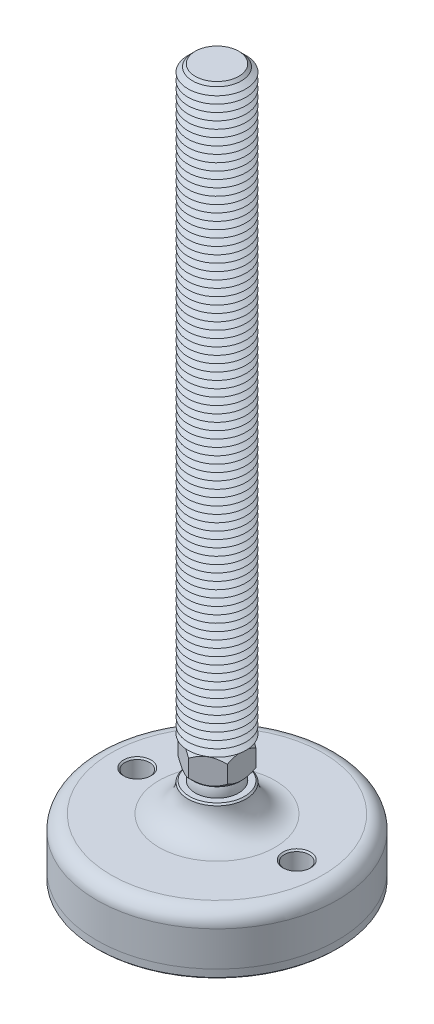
ISO-10303-21;
HEADER;
FILE_DESCRIPTION(('STEP AP214'),'2;1');
FILE_NAME('part.step','',(''),(''),'','','');
FILE_SCHEMA(('AUTOMOTIVE_DESIGN { 1 0 10303 214 1 1 1 1 }'));
ENDSEC;
DATA;
#1=APPLICATION_CONTEXT('core data for automotive mechanical design processes');
#2=APPLICATION_PROTOCOL_DEFINITION('international standard','automotive_design',2000,#1);
#3=PRODUCT_CONTEXT('',#1,'mechanical');
#4=PRODUCT('Part','Part','',(#3));
#5=PRODUCT_RELATED_PRODUCT_CATEGORY('part','',(#4));
#6=PRODUCT_DEFINITION_FORMATION('','',#4);
#7=PRODUCT_DEFINITION_CONTEXT('part definition',#1,'design');
#8=PRODUCT_DEFINITION('design','',#6,#7);
#9=PRODUCT_DEFINITION_SHAPE('','',#8);
#10=(LENGTH_UNIT() NAMED_UNIT(*) SI_UNIT(.MILLI.,.METRE.));
#11=(NAMED_UNIT(*) PLANE_ANGLE_UNIT() SI_UNIT($,.RADIAN.));
#12=(NAMED_UNIT(*) SI_UNIT($,.STERADIAN.) SOLID_ANGLE_UNIT());
#13=UNCERTAINTY_MEASURE_WITH_UNIT(LENGTH_MEASURE(1.E-05),#10,'distance_accuracy_value','');
#14=(GEOMETRIC_REPRESENTATION_CONTEXT(3) GLOBAL_UNCERTAINTY_ASSIGNED_CONTEXT((#13)) GLOBAL_UNIT_ASSIGNED_CONTEXT((#10,
#11,#12)) REPRESENTATION_CONTEXT('',''));
#15=CARTESIAN_POINT('',(0.,0.,0.));
#16=DIRECTION('',(0.,0.,1.));
#17=DIRECTION('',(1.,0.,0.));
#18=AXIS2_PLACEMENT_3D('',#15,#16,#17);
#19=CARTESIAN_POINT('',(0.,-27.,0.));
#20=DIRECTION('',(0.,1.,0.));
#21=DIRECTION('',(0.,0.,1.));
#22=AXIS2_PLACEMENT_3D('',#19,#20,#21);
#23=PLANE('',#22);
#24=CARTESIAN_POINT('',(-27.5,-27.,0.));
#25=DIRECTION('',(0.,1.,0.));
#26=DIRECTION('',(0.,0.,1.));
#27=AXIS2_PLACEMENT_3D('',#24,#25,#26);
#28=CIRCLE('',#27,4.25000000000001);
#29=CARTESIAN_POINT('',(-27.5,-27.,4.25000000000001));
#30=VERTEX_POINT('',#29);
#31=EDGE_CURVE('P0_E43',#30,#30,#28,.T.);
#32=ORIENTED_EDGE('',*,*,#31,.F.);
#33=EDGE_LOOP('',(#32));
#34=FACE_BOUND('',#33,.T.);
#35=CARTESIAN_POINT('',(27.5,-27.,0.));
#36=DIRECTION('',(0.,1.,0.));
#37=DIRECTION('',(0.,0.,1.));
#38=AXIS2_PLACEMENT_3D('',#35,#36,#37);
#39=CIRCLE('',#38,4.25000000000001);
#40=CARTESIAN_POINT('',(27.5,-27.,4.25000000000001));
#41=VERTEX_POINT('',#40);
#42=EDGE_CURVE('P0_E44',#41,#41,#39,.T.);
#43=ORIENTED_EDGE('',*,*,#42,.F.);
#44=EDGE_LOOP('',(#43));
#45=FACE_BOUND('',#44,.T.);
#46=CARTESIAN_POINT('',(0.,-27.,0.));
#47=DIRECTION('',(0.,1.,0.));
#48=DIRECTION('',(0.,0.,1.));
#49=AXIS2_PLACEMENT_3D('',#46,#47,#48);
#50=CIRCLE('',#49,41.5);
#51=CARTESIAN_POINT('',(0.,-27.,41.5));
#52=VERTEX_POINT('',#51);
#53=EDGE_CURVE('P0_E40',#52,#52,#50,.T.);
#54=ORIENTED_EDGE('',*,*,#53,.T.);
#55=EDGE_LOOP('',(#54));
#56=FACE_BOUND('',#55,.T.);
#57=ADVANCED_FACE('P0_F14',(#34,#45,#56),#23,.T.);
#58=CARTESIAN_POINT('',(0.,48.1654938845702,0.));
#59=DIRECTION('',(0.,1.,0.));
#60=DIRECTION('',(0.,0.,1.));
#61=AXIS2_PLACEMENT_3D('',#58,#59,#60);
#62=CYLINDRICAL_SURFACE('',#61,41.5);
#63=CARTESIAN_POINT('',(0.,-29.5,0.));
#64=DIRECTION('',(0.,-1.,0.));
#65=DIRECTION('',(0.,0.,-1.));
#66=AXIS2_PLACEMENT_3D('',#63,#64,#65);
#67=CIRCLE('',#66,41.5);
#68=CARTESIAN_POINT('',(0.,-29.5,-41.5));
#69=VERTEX_POINT('',#68);
#70=EDGE_CURVE('P0_E37',#69,#69,#67,.F.);
#71=ORIENTED_EDGE('',*,*,#70,.T.);
#72=EDGE_LOOP('',(#71));
#73=FACE_BOUND('',#72,.T.);
#74=ORIENTED_EDGE('',*,*,#53,.F.);
#75=EDGE_LOOP('',(#74));
#76=FACE_BOUND('',#75,.T.);
#77=ADVANCED_FACE('P0_F54',(#73,#76),#62,.T.);
#78=CARTESIAN_POINT('',(0.,-30.,41.5));
#79=DIRECTION('',(0.,-1.,0.));
#80=DIRECTION('',(0.,0.,-1.));
#81=AXIS2_PLACEMENT_3D('',#78,#79,#80);
#82=PLANE('',#81);
#83=CARTESIAN_POINT('',(27.5,-30.,0.));
#84=DIRECTION('',(0.,-1.,0.));
#85=DIRECTION('',(0.,0.,-1.));
#86=AXIS2_PLACEMENT_3D('',#83,#84,#85);
#87=CIRCLE('',#86,4.75);
#88=CARTESIAN_POINT('',(27.5,-30.,-4.75000000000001));
#89=VERTEX_POINT('',#88);
#90=EDGE_CURVE('P0_E25',#89,#89,#87,.F.);
#91=ORIENTED_EDGE('',*,*,#90,.T.);
#92=EDGE_LOOP('',(#91));
#93=FACE_BOUND('',#92,.T.);
#94=CARTESIAN_POINT('',(-27.5,-30.,0.));
#95=DIRECTION('',(0.,-1.,0.));
#96=DIRECTION('',(0.,0.,-1.));
#97=AXIS2_PLACEMENT_3D('',#94,#95,#96);
#98=CIRCLE('',#97,4.75);
#99=CARTESIAN_POINT('',(-27.5,-30.,-4.75));
#100=VERTEX_POINT('',#99);
#101=EDGE_CURVE('P0_E29',#100,#100,#98,.F.);
#102=ORIENTED_EDGE('',*,*,#101,.T.);
#103=EDGE_LOOP('',(#102));
#104=FACE_BOUND('',#103,.T.);
#105=CARTESIAN_POINT('',(0.,-30.,0.));
#106=DIRECTION('',(0.,-1.,0.));
#107=DIRECTION('',(0.,0.,-1.));
#108=AXIS2_PLACEMENT_3D('',#105,#106,#107);
#109=CIRCLE('',#108,41.);
#110=CARTESIAN_POINT('',(0.,-30.,-41.));
#111=VERTEX_POINT('',#110);
#112=EDGE_CURVE('P0_E34',#111,#111,#109,.T.);
#113=ORIENTED_EDGE('',*,*,#112,.T.);
#114=EDGE_LOOP('',(#113));
#115=FACE_BOUND('',#114,.T.);
#116=ADVANCED_FACE('P0_F61',(#93,#104,#115),#82,.T.);
#117=CARTESIAN_POINT('',(0.,-29.5,0.));
#118=DIRECTION('',(0.,1.,0.));
#119=DIRECTION('',(0.,0.,1.));
#120=AXIS2_PLACEMENT_3D('',#117,#118,#119);
#121=CONICAL_SURFACE('',#120,41.5,0.785398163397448);
#122=ORIENTED_EDGE('',*,*,#112,.F.);
#123=EDGE_LOOP('',(#122));
#124=FACE_BOUND('',#123,.T.);
#125=ORIENTED_EDGE('',*,*,#70,.F.);
#126=EDGE_LOOP('',(#125));
#127=FACE_BOUND('',#126,.T.);
#128=ADVANCED_FACE('P0_F68',(#124,#127),#121,.T.);
#129=CARTESIAN_POINT('',(27.5,-30.,0.));
#130=DIRECTION('',(0.,1.,0.));
#131=DIRECTION('',(0.,0.,1.));
#132=AXIS2_PLACEMENT_3D('',#129,#130,#131);
#133=CYLINDRICAL_SURFACE('',#132,4.25000000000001);
#134=CARTESIAN_POINT('',(27.5,-29.5,0.));
#135=DIRECTION('',(0.,-1.,0.));
#136=DIRECTION('',(0.,0.,-1.));
#137=AXIS2_PLACEMENT_3D('',#134,#135,#136);
#138=CIRCLE('',#137,4.25000000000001);
#139=CARTESIAN_POINT('',(27.5,-29.5,-4.25000000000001));
#140=VERTEX_POINT('',#139);
#141=EDGE_CURVE('P0_E21',#140,#140,#138,.T.);
#142=ORIENTED_EDGE('',*,*,#141,.T.);
#143=EDGE_LOOP('',(#142));
#144=FACE_BOUND('',#143,.T.);
#145=ORIENTED_EDGE('',*,*,#42,.T.);
#146=EDGE_LOOP('',(#145));
#147=FACE_BOUND('',#146,.T.);
#148=ADVANCED_FACE('P0_F74',(#144,#147),#133,.F.);
#149=CARTESIAN_POINT('',(-27.5,-30.,0.));
#150=DIRECTION('',(0.,1.,0.));
#151=DIRECTION('',(0.,0.,1.));
#152=AXIS2_PLACEMENT_3D('',#149,#150,#151);
#153=CYLINDRICAL_SURFACE('',#152,4.25000000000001);
#154=CARTESIAN_POINT('',(-27.5,-29.5,0.));
#155=DIRECTION('',(0.,-1.,0.));
#156=DIRECTION('',(0.,0.,-1.));
#157=AXIS2_PLACEMENT_3D('',#154,#155,#156);
#158=CIRCLE('',#157,4.25000000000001);
#159=CARTESIAN_POINT('',(-27.5,-29.5,-4.25000000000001));
#160=VERTEX_POINT('',#159);
#161=EDGE_CURVE('P0_E10',#160,#160,#158,.T.);
#162=ORIENTED_EDGE('',*,*,#161,.T.);
#163=EDGE_LOOP('',(#162));
#164=FACE_BOUND('',#163,.T.);
#165=ORIENTED_EDGE('',*,*,#31,.T.);
#166=EDGE_LOOP('',(#165));
#167=FACE_BOUND('',#166,.T.);
#168=ADVANCED_FACE('P0_F50',(#164,#167),#153,.F.);
#169=CARTESIAN_POINT('',(27.5,-30.,0.));
#170=DIRECTION('',(0.,-1.,0.));
#171=DIRECTION('',(0.,0.,-1.));
#172=AXIS2_PLACEMENT_3D('',#169,#170,#171);
#173=CONICAL_SURFACE('',#172,4.75,0.785398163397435);
#174=ORIENTED_EDGE('',*,*,#141,.F.);
#175=EDGE_LOOP('',(#174));
#176=FACE_BOUND('',#175,.T.);
#177=ORIENTED_EDGE('',*,*,#90,.F.);
#178=EDGE_LOOP('',(#177));
#179=FACE_BOUND('',#178,.T.);
#180=ADVANCED_FACE('P0_F76',(#176,#179),#173,.F.);
#181=CARTESIAN_POINT('',(-27.5,-30.,0.));
#182=DIRECTION('',(0.,-1.,0.));
#183=DIRECTION('',(0.,0.,-1.));
#184=AXIS2_PLACEMENT_3D('',#181,#182,#183);
#185=CONICAL_SURFACE('',#184,4.75,0.785398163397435);
#186=ORIENTED_EDGE('',*,*,#161,.F.);
#187=EDGE_LOOP('',(#186));
#188=FACE_BOUND('',#187,.T.);
#189=ORIENTED_EDGE('',*,*,#101,.F.);
#190=EDGE_LOOP('',(#189));
#191=FACE_BOUND('',#190,.T.);
#192=ADVANCED_FACE('P0_F16',(#188,#191),#185,.F.);
#193=CLOSED_SHELL('',(#57,#77,#116,#128,#148,#168,#180,#192));
#194=MANIFOLD_SOLID_BREP('P0_B1',#193);
#195=CARTESIAN_POINT('',(0.,3.75,0.));
#196=DIRECTION('',(0.,1.,0.));
#197=DIRECTION('',(0.,0.,1.));
#198=AXIS2_PLACEMENT_3D('',#195,#196,#197);
#199=PLANE('',#198);
#200=CARTESIAN_POINT('',(0.,3.75,0.));
#201=DIRECTION('',(0.,1.,0.));
#202=DIRECTION('',(0.,0.,1.));
#203=AXIS2_PLACEMENT_3D('',#200,#201,#202);
#204=CIRCLE('',#203,7.99624373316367);
#205=CARTESIAN_POINT('',(0.,3.75,7.99624373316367));
#206=VERTEX_POINT('',#205);
#207=EDGE_CURVE('P1_E213',#206,#206,#204,.T.);
#208=ORIENTED_EDGE('',*,*,#207,.F.);
#209=EDGE_LOOP('',(#208));
#210=FACE_BOUND('',#209,.T.);
#211=CARTESIAN_POINT('',(0.,3.75,0.));
#212=DIRECTION('',(0.,1.,0.));
#213=DIRECTION('',(0.,0.,1.));
#214=AXIS2_PLACEMENT_3D('',#211,#212,#213);
#215=CIRCLE('',#214,6.49519052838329);
#216=CARTESIAN_POINT('',(0.,3.75,6.49519052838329));
#217=VERTEX_POINT('',#216);
#218=EDGE_CURVE('P1_E25',#217,#217,#215,.F.);
#219=ORIENTED_EDGE('',*,*,#218,.F.);
#220=EDGE_LOOP('',(#219));
#221=FACE_BOUND('',#220,.T.);
#222=ADVANCED_FACE('P1_F16',(#210,#221),#199,.F.);
#223=CARTESIAN_POINT('',(0.,0.,0.));
#224=DIRECTION('',(0.,1.,0.));
#225=DIRECTION('',(0.,0.,-1.));
#226=AXIS2_PLACEMENT_3D('',#223,#224,#225);
#227=SPHERICAL_SURFACE('',#226,7.5);
#228=ORIENTED_EDGE('',*,*,#218,.T.);
#229=EDGE_LOOP('',(#228));
#230=FACE_BOUND('',#229,.T.);
#231=ADVANCED_FACE('P1_F203',(#230),#227,.T.);
#232=CARTESIAN_POINT('',(0.,3.75,0.));
#233=DIRECTION('',(0.,1.,0.));
#234=DIRECTION('',(0.,0.,1.));
#235=AXIS2_PLACEMENT_3D('',#232,#233,#234);
#236=CONICAL_SURFACE('',#235,7.99624373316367,0.785398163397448);
#237=ORIENTED_EDGE('',*,*,#207,.T.);
#238=EDGE_LOOP('',(#237));
#239=FACE_BOUND('',#238,.T.);
#240=CARTESIAN_POINT('',(-8.5,8.90811002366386,-10.0392740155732));
#241=CARTESIAN_POINT('',(-8.5,8.72243436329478,-9.79593020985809));
#242=CARTESIAN_POINT('',(-8.5,8.53847898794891,-9.55125250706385));
#243=CARTESIAN_POINT('',(-8.5,8.17478786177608,-9.05869243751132));
#244=CARTESIAN_POINT('',(-8.5,7.99505314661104,-8.81080930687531));
#245=CARTESIAN_POINT('',(-8.5,7.63930320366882,-8.30948839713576));
#246=CARTESIAN_POINT('',(-8.5,7.46332748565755,-8.05602248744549));
#247=CARTESIAN_POINT('',(-8.5,7.11769199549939,-7.54483399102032));
#248=CARTESIAN_POINT('',(-8.5,6.94803178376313,-7.28711170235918));
#249=CARTESIAN_POINT('',(-8.5,6.60640236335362,-6.75094027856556));
#250=CARTESIAN_POINT('',(-8.5,6.43491645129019,-6.47218164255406));
#251=CARTESIAN_POINT('',(-8.5,6.10286460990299,-5.90813314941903));
#252=CARTESIAN_POINT('',(-8.5,5.94230047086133,-5.62284223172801));
#253=CARTESIAN_POINT('',(-8.5,5.63553180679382,-5.04569727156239));
#254=CARTESIAN_POINT('',(-8.5,5.48928508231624,-4.75386583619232));
#255=CARTESIAN_POINT('',(-8.5,5.21442695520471,-4.16207917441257));
#256=CARTESIAN_POINT('',(-8.5,5.08580737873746,-3.86212779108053));
#257=CARTESIAN_POINT('',(-8.5,4.86150447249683,-3.28118098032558));
#258=CARTESIAN_POINT('',(-8.5,4.7638906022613,-3.00093864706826));
#259=CARTESIAN_POINT('',(-8.5,4.59111419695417,-2.43348682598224));
#260=CARTESIAN_POINT('',(-8.5,4.51595314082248,-2.14627688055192));
#261=CARTESIAN_POINT('',(-8.5,4.39333737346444,-1.57150580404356));
#262=CARTESIAN_POINT('',(-8.5,4.34539220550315,-1.28405106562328));
#263=CARTESIAN_POINT('',(-8.5,4.27817908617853,-0.705789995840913));
#264=CARTESIAN_POINT('',(-8.5,4.25890565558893,-0.41498431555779));
#265=CARTESIAN_POINT('',(-8.5,4.25058550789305,0.155345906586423));
#266=CARTESIAN_POINT('',(-8.5,4.2603535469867,0.434853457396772));
#267=CARTESIAN_POINT('',(-8.5,4.30689978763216,0.991595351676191));
#268=CARTESIAN_POINT('',(-8.5,4.34368052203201,1.26882947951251));
#269=CARTESIAN_POINT('',(-8.5,4.44283018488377,1.82371054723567));
#270=CARTESIAN_POINT('',(-8.5,4.50564357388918,2.10127674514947));
#271=CARTESIAN_POINT('',(-8.5,4.65343378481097,2.6503272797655));
#272=CARTESIAN_POINT('',(-8.5,4.73840907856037,2.9218120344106));
#273=CARTESIAN_POINT('',(-8.5,4.93373614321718,3.47773657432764));
#274=CARTESIAN_POINT('',(-8.5,5.04548526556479,3.7616800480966));
#275=CARTESIAN_POINT('',(-8.5,5.28620549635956,4.3222352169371));
#276=CARTESIAN_POINT('',(-8.5,5.41518447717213,4.59884349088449));
#277=CARTESIAN_POINT('',(-8.5,5.68730204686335,5.14605293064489));
#278=CARTESIAN_POINT('',(-8.5,5.8304846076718,5.41663205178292));
#279=CARTESIAN_POINT('',(-8.5,6.1278527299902,5.95157955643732));
#280=CARTESIAN_POINT('',(-8.5,6.28203657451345,6.21594890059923));
#281=CARTESIAN_POINT('',(-8.5,6.59139861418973,6.7263367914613));
#282=CARTESIAN_POINT('',(-8.5,6.74614943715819,6.97261575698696));
#283=CARTESIAN_POINT('',(-8.5,7.06220691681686,7.46094357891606));
#284=CARTESIAN_POINT('',(-8.5,7.22351406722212,7.70299211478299));
#285=CARTESIAN_POINT('',(-8.5,7.55019288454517,8.18145952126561));
#286=CARTESIAN_POINT('',(-8.5,7.71552125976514,8.4179080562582));
#287=CARTESIAN_POINT('',(-8.5,8.05058640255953,8.88756615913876));
#288=CARTESIAN_POINT('',(-8.5,8.22032194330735,9.12077660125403));
#289=CARTESIAN_POINT('',(-8.5,8.39186061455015,9.35262965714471));
#290=B_SPLINE_CURVE_WITH_KNOTS('',3,(#240,#241,#242,#243,#244,#245,#246,#247,#248,#249,#250,
#251,#252,#253,#254,#255,#256,#257,#258,#259,#260,#261,#262,#263,#264,#265,#266,#267,#268,#269,
#270,#271,#272,#273,#274,#275,#276,#277,#278,#279,#280,#281,#282,#283,#284,#285,#286,#287,#288,
#289),.UNSPECIFIED.,.F.,.F.,(4,2,2,2,2,2,2,2,2,2,2,2,2,2,2,2,2,2,2,2,2,2,2,2,4),(0.,
0.918290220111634,1.8368034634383,2.76241942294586,3.68797083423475,4.66961920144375,
5.65142809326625,6.63025007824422,7.60861662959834,8.49811159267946,9.38766513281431,
10.2606329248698,11.1334338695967,11.9711093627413,12.8088634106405,13.6615517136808,
14.5141812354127,15.4289018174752,16.3440417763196,17.2621089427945,18.1800331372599,
19.0524996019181,19.9250318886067,20.7905246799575,21.6557790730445),.UNSPECIFIED.);
#291=CARTESIAN_POINT('',(-8.5,5.56871084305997,-4.90747728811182));
#292=VERTEX_POINT('',#291);
#293=CARTESIAN_POINT('',(-8.5,5.56871084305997,4.90747728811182));
#294=VERTEX_POINT('',#293);
#295=EDGE_CURVE('P1_E187',#292,#294,#290,.T.);
#296=ORIENTED_EDGE('',*,*,#295,.F.);
#297=CARTESIAN_POINT('',(0.000199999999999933,5.5688263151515,-9.81507004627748));
#298=CARTESIAN_POINT('',(-0.145938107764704,5.48446627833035,-9.73069717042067));
#299=CARTESIAN_POINT('',(-0.293216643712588,5.40268088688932,-9.6456658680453));
#300=CARTESIAN_POINT('',(-0.590240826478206,5.24507616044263,-9.47417887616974));
#301=CARTESIAN_POINT('',(-0.739987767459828,5.16926008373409,-9.38772243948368));
#302=CARTESIAN_POINT('',(-1.0428413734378,5.02408965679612,-9.21286982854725));
#303=CARTESIAN_POINT('',(-1.19596236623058,4.95477479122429,-9.12446538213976));
#304=CARTESIAN_POINT('',(-1.50468648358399,4.82411695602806,-8.94622342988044));
#305=CARTESIAN_POINT('',(-1.66028922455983,4.76277276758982,-8.85638614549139));
#306=CARTESIAN_POINT('',(-2.12594374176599,4.59407400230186,-8.58754038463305));
#307=CARTESIAN_POINT('',(-2.4397129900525,4.49965525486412,-8.4063856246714));
#308=CARTESIAN_POINT('',(-2.91546156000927,4.39044680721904,-8.13171205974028));
#309=CARTESIAN_POINT('',(-3.07473438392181,4.35946186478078,-8.03975585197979));
#310=CARTESIAN_POINT('',(-3.39463410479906,4.3089933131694,-7.85506166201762));
#311=CARTESIAN_POINT('',(-3.5552607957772,4.28950798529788,-7.76232379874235));
#312=CARTESIAN_POINT('',(-3.9466882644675,4.25683795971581,-7.5363330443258));
#313=CARTESIAN_POINT('',(-4.17791015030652,4.24998362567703,-7.4028370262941));
#314=CARTESIAN_POINT('',(-4.63993781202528,4.26149030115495,-7.13608523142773));
#315=CARTESIAN_POINT('',(-4.87074341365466,4.27986014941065,-7.00282955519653));
#316=CARTESIAN_POINT('',(-5.33017839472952,4.34073256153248,-6.73757464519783));
#317=CARTESIAN_POINT('',(-5.55880504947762,4.38326211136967,-6.60557698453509));
#318=CARTESIAN_POINT('',(-6.01212885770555,4.49014170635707,-6.34385036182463));
#319=CARTESIAN_POINT('',(-6.23682631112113,4.55449007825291,-6.21412122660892));
#320=CARTESIAN_POINT('',(-6.63569693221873,4.686871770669,-5.98383316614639));
#321=CARTESIAN_POINT('',(-6.81075347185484,4.75142294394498,-5.88276422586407));
#322=CARTESIAN_POINT('',(-7.15772421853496,4.89092708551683,-5.68244057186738));
#323=CARTESIAN_POINT('',(-7.3296383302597,4.96588036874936,-5.58318591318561));
#324=CARTESIAN_POINT('',(-7.6697827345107,5.12450866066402,-5.38680344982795));
#325=CARTESIAN_POINT('',(-7.8380227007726,5.20815624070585,-5.28967006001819));
#326=CARTESIAN_POINT('',(-8.17138743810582,5.38307502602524,-5.09720183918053));
#327=CARTESIAN_POINT('',(-8.33651404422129,5.47434155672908,-5.00186594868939));
#328=CARTESIAN_POINT('',(-8.5002,5.5688263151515,-4.90736181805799));
#329=B_SPLINE_CURVE_WITH_KNOTS('',3,(#297,#298,#299,#300,#301,#302,#303,#304,#305,#306,#307,
#308,#309,#310,#311,#312,#313,#314,#315,#316,#317,#318,#319,#320,#321,#322,#323,#324,#325,#326,
#327,#328),.UNSPECIFIED.,.F.,.F.,(4,2,2,2,2,2,2,2,2,2,2,2,2,2,2,4),(0.,0.565988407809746,
1.13228364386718,1.70182141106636,2.27127198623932,3.39189520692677,3.95110786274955,
4.510236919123,5.31023384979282,6.11051117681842,6.91168416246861,7.71279572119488,
8.34908108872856,8.98538572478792,9.61974061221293,10.2537091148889),.UNSPECIFIED.);
#330=CARTESIAN_POINT('',(0.,5.56871084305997,-9.81495457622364));
#331=VERTEX_POINT('',#330);
#332=EDGE_CURVE('P1_E181',#331,#292,#329,.T.);
#333=ORIENTED_EDGE('',*,*,#332,.F.);
#334=CARTESIAN_POINT('',(8.5002,5.56882631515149,-4.90736181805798));
#335=CARTESIAN_POINT('',(8.3540618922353,5.48446627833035,-4.9917346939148));
#336=CARTESIAN_POINT('',(8.20678335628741,5.40268088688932,-5.07676599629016));
#337=CARTESIAN_POINT('',(7.90975917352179,5.24507616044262,-5.24825298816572));
#338=CARTESIAN_POINT('',(7.76001223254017,5.16926008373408,-5.33470942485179));
#339=CARTESIAN_POINT('',(7.4571586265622,5.02408965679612,-5.50956203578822));
#340=CARTESIAN_POINT('',(7.30403763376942,4.95477479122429,-5.59796648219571));
#341=CARTESIAN_POINT('',(6.99531351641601,4.82411695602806,-5.77620843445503));
#342=CARTESIAN_POINT('',(6.83971077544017,4.76277276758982,-5.86604571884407));
#343=CARTESIAN_POINT('',(6.37405625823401,4.59407400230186,-6.13489147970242));
#344=CARTESIAN_POINT('',(6.0602870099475,4.49965525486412,-6.31604623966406));
#345=CARTESIAN_POINT('',(5.58453843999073,4.39044680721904,-6.59071980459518));
#346=CARTESIAN_POINT('',(5.42526561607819,4.35946186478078,-6.68267601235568));
#347=CARTESIAN_POINT('',(5.10536589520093,4.3089933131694,-6.86737020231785));
#348=CARTESIAN_POINT('',(4.9447392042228,4.28950798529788,-6.96010806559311));
#349=CARTESIAN_POINT('',(4.5533117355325,4.25683795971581,-7.18609882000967));
#350=CARTESIAN_POINT('',(4.32208984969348,4.24998362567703,-7.31959483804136));
#351=CARTESIAN_POINT('',(3.86006218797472,4.26149030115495,-7.58634663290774));
#352=CARTESIAN_POINT('',(3.62925658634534,4.27986014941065,-7.71960230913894));
#353=CARTESIAN_POINT('',(3.16982160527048,4.34073256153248,-7.98485721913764));
#354=CARTESIAN_POINT('',(2.94119495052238,4.38326211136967,-8.11685487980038));
#355=CARTESIAN_POINT('',(2.48787114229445,4.49014170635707,-8.37858150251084));
#356=CARTESIAN_POINT('',(2.26317368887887,4.55449007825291,-8.50831063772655));
#357=CARTESIAN_POINT('',(1.86430306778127,4.686871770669,-8.73859869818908));
#358=CARTESIAN_POINT('',(1.68924652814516,4.75142294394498,-8.83966763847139));
#359=CARTESIAN_POINT('',(1.34227578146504,4.89092708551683,-9.03999129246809));
#360=CARTESIAN_POINT('',(1.1703616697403,4.96588036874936,-9.13924595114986));
#361=CARTESIAN_POINT('',(0.8302172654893,5.12450866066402,-9.33562841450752));
#362=CARTESIAN_POINT('',(0.661977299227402,5.20815624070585,-9.43276180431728));
#363=CARTESIAN_POINT('',(0.328612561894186,5.38307502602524,-9.62523002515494));
#364=CARTESIAN_POINT('',(0.163485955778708,5.47434155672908,-9.72056591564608));
#365=CARTESIAN_POINT('',(-0.000200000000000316,5.5688263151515,-9.81507004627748));
#366=B_SPLINE_CURVE_WITH_KNOTS('',3,(#334,#335,#336,#337,#338,#339,#340,#341,#342,#343,#344,
#345,#346,#347,#348,#349,#350,#351,#352,#353,#354,#355,#356,#357,#358,#359,#360,#361,#362,#363,
#364,#365),.UNSPECIFIED.,.F.,.F.,(4,2,2,2,2,2,2,2,2,2,2,2,2,2,2,4),(0.,0.565988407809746,
1.13228364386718,1.70182141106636,2.27127198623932,3.39189520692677,3.95110786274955,
4.510236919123,5.31023384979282,6.11051117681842,6.91168416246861,7.71279572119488,
8.34908108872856,8.98538572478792,9.61974061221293,10.2537091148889),.UNSPECIFIED.);
#367=CARTESIAN_POINT('',(8.5,5.56871084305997,-4.90747728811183));
#368=VERTEX_POINT('',#367);
#369=EDGE_CURVE('P1_E169',#368,#331,#366,.T.);
#370=ORIENTED_EDGE('',*,*,#369,.F.);
#371=CARTESIAN_POINT('',(8.5,8.90811002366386,-10.0392740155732));
#372=CARTESIAN_POINT('',(8.5,8.72243436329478,-9.79593020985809));
#373=CARTESIAN_POINT('',(8.5,8.5384789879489,-9.55125250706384));
#374=CARTESIAN_POINT('',(8.5,8.17478786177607,-9.05869243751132));
#375=CARTESIAN_POINT('',(8.5,7.99505314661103,-8.81080930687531));
#376=CARTESIAN_POINT('',(8.5,7.63930320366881,-8.30948839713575));
#377=CARTESIAN_POINT('',(8.5,7.46332748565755,-8.05602248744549));
#378=CARTESIAN_POINT('',(8.5,7.11769199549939,-7.54483399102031));
#379=CARTESIAN_POINT('',(8.5,6.94803178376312,-7.28711170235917));
#380=CARTESIAN_POINT('',(8.5,6.60640236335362,-6.75094027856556));
#381=CARTESIAN_POINT('',(8.5,6.43491645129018,-6.47218164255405));
#382=CARTESIAN_POINT('',(8.5,6.10286460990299,-5.90813314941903));
#383=CARTESIAN_POINT('',(8.5,5.94230047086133,-5.62284223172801));
#384=CARTESIAN_POINT('',(8.5,5.63553180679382,-5.04569727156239));
#385=CARTESIAN_POINT('',(8.5,5.48928508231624,-4.75386583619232));
#386=CARTESIAN_POINT('',(8.5,5.21442695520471,-4.16207917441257));
#387=CARTESIAN_POINT('',(8.5,5.08580737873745,-3.86212779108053));
#388=CARTESIAN_POINT('',(8.5,4.86150447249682,-3.28118098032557));
#389=CARTESIAN_POINT('',(8.5,4.7638906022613,-3.00093864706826));
#390=CARTESIAN_POINT('',(8.5,4.59111419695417,-2.43348682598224));
#391=CARTESIAN_POINT('',(8.5,4.51595314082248,-2.14627688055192));
#392=CARTESIAN_POINT('',(8.5,4.39333737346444,-1.57150580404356));
#393=CARTESIAN_POINT('',(8.5,4.34539220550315,-1.28405106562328));
#394=CARTESIAN_POINT('',(8.5,4.27817908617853,-0.705789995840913));
#395=CARTESIAN_POINT('',(8.5,4.25890565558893,-0.41498431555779));
#396=CARTESIAN_POINT('',(8.5,4.25058550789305,0.155345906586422));
#397=CARTESIAN_POINT('',(8.5,4.2603535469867,0.434853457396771));
#398=CARTESIAN_POINT('',(8.5,4.30689978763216,0.99159535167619));
#399=CARTESIAN_POINT('',(8.5,4.34368052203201,1.2688294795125));
#400=CARTESIAN_POINT('',(8.5,4.44283018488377,1.82371054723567));
#401=CARTESIAN_POINT('',(8.5,4.50564357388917,2.10127674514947));
#402=CARTESIAN_POINT('',(8.5,4.65343378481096,2.65032727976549));
#403=CARTESIAN_POINT('',(8.5,4.73840907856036,2.9218120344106));
#404=CARTESIAN_POINT('',(8.5,4.93373614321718,3.47773657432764));
#405=CARTESIAN_POINT('',(8.5,5.04548526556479,3.7616800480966));
#406=CARTESIAN_POINT('',(8.5,5.28620549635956,4.3222352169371));
#407=CARTESIAN_POINT('',(8.5,5.41518447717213,4.59884349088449));
#408=CARTESIAN_POINT('',(8.5,5.68730204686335,5.14605293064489));
#409=CARTESIAN_POINT('',(8.5,5.8304846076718,5.41663205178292));
#410=CARTESIAN_POINT('',(8.5,6.1278527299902,5.95157955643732));
#411=CARTESIAN_POINT('',(8.5,6.28203657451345,6.21594890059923));
#412=CARTESIAN_POINT('',(8.5,6.59139861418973,6.7263367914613));
#413=CARTESIAN_POINT('',(8.5,6.74614943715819,6.97261575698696));
#414=CARTESIAN_POINT('',(8.5,7.06220691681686,7.46094357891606));
#415=CARTESIAN_POINT('',(8.5,7.22351406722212,7.70299211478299));
#416=CARTESIAN_POINT('',(8.5,7.55019288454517,8.18145952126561));
#417=CARTESIAN_POINT('',(8.5,7.71552125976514,8.4179080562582));
#418=CARTESIAN_POINT('',(8.5,8.05058640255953,8.88756615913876));
#419=CARTESIAN_POINT('',(8.5,8.22032194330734,9.12077660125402));
#420=CARTESIAN_POINT('',(8.5,8.39186061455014,9.35262965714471));
#421=B_SPLINE_CURVE_WITH_KNOTS('',3,(#371,#372,#373,#374,#375,#376,#377,#378,#379,#380,#381,
#382,#383,#384,#385,#386,#387,#388,#389,#390,#391,#392,#393,#394,#395,#396,#397,#398,#399,#400,
#401,#402,#403,#404,#405,#406,#407,#408,#409,#410,#411,#412,#413,#414,#415,#416,#417,#418,#419,
#420),.UNSPECIFIED.,.F.,.F.,(4,2,2,2,2,2,2,2,2,2,2,2,2,2,2,2,2,2,2,2,2,2,2,2,4),(0.,
0.918290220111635,1.8368034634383,2.76241942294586,3.68797083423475,4.66961920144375,
5.65142809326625,6.63025007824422,7.60861662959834,8.49811159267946,9.38766513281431,
10.2606329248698,11.1334338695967,11.9711093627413,12.8088634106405,13.6615517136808,
14.5141812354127,15.4289018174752,16.3440417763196,17.2621089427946,18.1800331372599,
19.0524996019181,19.9250318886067,20.7905246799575,21.6557790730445),.UNSPECIFIED.);
#422=CARTESIAN_POINT('',(8.5,5.56871084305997,4.90747728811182));
#423=VERTEX_POINT('',#422);
#424=EDGE_CURVE('P1_E71',#423,#368,#421,.F.);
#425=ORIENTED_EDGE('',*,*,#424,.F.);
#426=CARTESIAN_POINT('',(-0.000200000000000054,5.56882631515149,9.81507004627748));
#427=CARTESIAN_POINT('',(0.145938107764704,5.48446627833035,9.73069717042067));
#428=CARTESIAN_POINT('',(0.293216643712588,5.40268088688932,9.6456658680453));
#429=CARTESIAN_POINT('',(0.590240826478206,5.24507616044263,9.47417887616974));
#430=CARTESIAN_POINT('',(0.739987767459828,5.16926008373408,9.38772243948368));
#431=CARTESIAN_POINT('',(1.0428413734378,5.02408965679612,9.21286982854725));
#432=CARTESIAN_POINT('',(1.19596236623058,4.95477479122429,9.12446538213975));
#433=CARTESIAN_POINT('',(1.50468648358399,4.82411695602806,8.94622342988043));
#434=CARTESIAN_POINT('',(1.66028922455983,4.76277276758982,8.85638614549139));
#435=CARTESIAN_POINT('',(2.12594374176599,4.59407400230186,8.58754038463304));
#436=CARTESIAN_POINT('',(2.4397129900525,4.49965525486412,8.4063856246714));
#437=CARTESIAN_POINT('',(2.91546156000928,4.39044680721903,8.13171205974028));
#438=CARTESIAN_POINT('',(3.07473438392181,4.35946186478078,8.03975585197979));
#439=CARTESIAN_POINT('',(3.39463410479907,4.3089933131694,7.85506166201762));
#440=CARTESIAN_POINT('',(3.55526079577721,4.28950798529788,7.76232379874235));
#441=CARTESIAN_POINT('',(3.9466882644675,4.25683795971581,7.53633304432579));
#442=CARTESIAN_POINT('',(4.17791015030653,4.24998362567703,7.4028370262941));
#443=CARTESIAN_POINT('',(4.63993781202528,4.26149030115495,7.13608523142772));
#444=CARTESIAN_POINT('',(4.87074341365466,4.27986014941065,7.00282955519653));
#445=CARTESIAN_POINT('',(5.33017839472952,4.34073256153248,6.73757464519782));
#446=CARTESIAN_POINT('',(5.55880504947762,4.38326211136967,6.60557698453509));
#447=CARTESIAN_POINT('',(6.01212885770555,4.49014170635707,6.34385036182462));
#448=CARTESIAN_POINT('',(6.23682631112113,4.55449007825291,6.21412122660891));
#449=CARTESIAN_POINT('',(6.63569693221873,4.686871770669,5.98383316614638));
#450=CARTESIAN_POINT('',(6.81075347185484,4.75142294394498,5.88276422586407));
#451=CARTESIAN_POINT('',(7.15772421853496,4.89092708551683,5.68244057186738));
#452=CARTESIAN_POINT('',(7.3296383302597,4.96588036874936,5.58318591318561));
#453=CARTESIAN_POINT('',(7.6697827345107,5.12450866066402,5.38680344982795));
#454=CARTESIAN_POINT('',(7.8380227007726,5.20815624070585,5.28967006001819));
#455=CARTESIAN_POINT('',(8.17138743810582,5.38307502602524,5.09720183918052));
#456=CARTESIAN_POINT('',(8.33651404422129,5.47434155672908,5.00186594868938));
#457=CARTESIAN_POINT('',(8.5002,5.56882631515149,4.90736181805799));
#458=B_SPLINE_CURVE_WITH_KNOTS('',3,(#426,#427,#428,#429,#430,#431,#432,#433,#434,#435,#436,
#437,#438,#439,#440,#441,#442,#443,#444,#445,#446,#447,#448,#449,#450,#451,#452,#453,#454,#455,
#456,#457),.UNSPECIFIED.,.F.,.F.,(4,2,2,2,2,2,2,2,2,2,2,2,2,2,2,4),(0.,0.565988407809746,
1.13228364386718,1.70182141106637,2.27127198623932,3.39189520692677,3.95110786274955,
4.51023691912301,5.31023384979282,6.11051117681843,6.91168416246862,7.71279572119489,
8.34908108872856,8.98538572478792,9.61974061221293,10.2537091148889),.UNSPECIFIED.);
#459=CARTESIAN_POINT('',(0.,5.56871084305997,9.81495457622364));
#460=VERTEX_POINT('',#459);
#461=EDGE_CURVE('P1_E68',#460,#423,#458,.T.);
#462=ORIENTED_EDGE('',*,*,#461,.F.);
#463=CARTESIAN_POINT('',(-8.5002,5.56882631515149,4.90736181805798));
#464=CARTESIAN_POINT('',(-8.3540618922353,5.48446627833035,4.9917346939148));
#465=CARTESIAN_POINT('',(-8.20678335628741,5.40268088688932,5.07676599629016));
#466=CARTESIAN_POINT('',(-7.90975917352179,5.24507616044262,5.24825298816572));
#467=CARTESIAN_POINT('',(-7.76001223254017,5.16926008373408,5.33470942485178));
#468=CARTESIAN_POINT('',(-7.4571586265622,5.02408965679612,5.50956203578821));
#469=CARTESIAN_POINT('',(-7.30403763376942,4.95477479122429,5.59796648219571));
#470=CARTESIAN_POINT('',(-6.99531351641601,4.82411695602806,5.77620843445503));
#471=CARTESIAN_POINT('',(-6.83971077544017,4.76277276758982,5.86604571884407));
#472=CARTESIAN_POINT('',(-6.37405625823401,4.59407400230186,6.13489147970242));
#473=CARTESIAN_POINT('',(-6.0602870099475,4.49965525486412,6.31604623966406));
#474=CARTESIAN_POINT('',(-5.58453843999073,4.39044680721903,6.59071980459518));
#475=CARTESIAN_POINT('',(-5.42526561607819,4.35946186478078,6.68267601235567));
#476=CARTESIAN_POINT('',(-5.10536589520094,4.30899331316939,6.86737020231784));
#477=CARTESIAN_POINT('',(-4.9447392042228,4.28950798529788,6.96010806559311));
#478=CARTESIAN_POINT('',(-4.5533117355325,4.25683795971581,7.18609882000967));
#479=CARTESIAN_POINT('',(-4.32208984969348,4.24998362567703,7.31959483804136));
#480=CARTESIAN_POINT('',(-3.86006218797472,4.26149030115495,7.58634663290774));
#481=CARTESIAN_POINT('',(-3.62925658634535,4.27986014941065,7.71960230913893));
#482=CARTESIAN_POINT('',(-3.16982160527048,4.34073256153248,7.98485721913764));
#483=CARTESIAN_POINT('',(-2.94119495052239,4.38326211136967,8.11685487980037));
#484=CARTESIAN_POINT('',(-2.48787114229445,4.49014170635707,8.37858150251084));
#485=CARTESIAN_POINT('',(-2.26317368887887,4.55449007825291,8.50831063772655));
#486=CARTESIAN_POINT('',(-1.86430306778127,4.686871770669,8.73859869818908));
#487=CARTESIAN_POINT('',(-1.68924652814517,4.75142294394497,8.83966763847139));
#488=CARTESIAN_POINT('',(-1.34227578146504,4.89092708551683,9.03999129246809));
#489=CARTESIAN_POINT('',(-1.1703616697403,4.96588036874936,9.13924595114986));
#490=CARTESIAN_POINT('',(-0.830217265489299,5.12450866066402,9.33562841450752));
#491=CARTESIAN_POINT('',(-0.6619772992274,5.20815624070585,9.43276180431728));
#492=CARTESIAN_POINT('',(-0.328612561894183,5.38307502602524,9.62523002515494));
#493=CARTESIAN_POINT('',(-0.163485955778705,5.47434155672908,9.72056591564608));
#494=CARTESIAN_POINT('',(0.000200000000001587,5.5688263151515,9.81507004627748));
#495=B_SPLINE_CURVE_WITH_KNOTS('',3,(#463,#464,#465,#466,#467,#468,#469,#470,#471,#472,#473,
#474,#475,#476,#477,#478,#479,#480,#481,#482,#483,#484,#485,#486,#487,#488,#489,#490,#491,#492,
#493,#494),.UNSPECIFIED.,.F.,.F.,(4,2,2,2,2,2,2,2,2,2,2,2,2,2,2,4),(0.,0.565988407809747,
1.13228364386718,1.70182141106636,2.27127198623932,3.39189520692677,3.95110786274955,
4.510236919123,5.31023384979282,6.11051117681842,6.91168416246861,7.71279572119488,
8.34908108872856,8.98538572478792,9.61974061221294,10.2537091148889),.UNSPECIFIED.);
#496=EDGE_CURVE('P1_E40',#294,#460,#495,.T.);
#497=ORIENTED_EDGE('',*,*,#496,.F.);
#498=EDGE_LOOP('',(#296,#333,#370,#425,#462,#497));
#499=FACE_BOUND('',#498,.T.);
#500=ADVANCED_FACE('P1_F69',(#239,#499),#236,.T.);
#501=CARTESIAN_POINT('',(-8.5,14.,-4.90747728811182));
#502=DIRECTION('',(1.,0.,0.));
#503=DIRECTION('',(0.,0.,-1.));
#504=AXIS2_PLACEMENT_3D('',#501,#502,#503);
#505=PLANE('',#504);
#506=DIRECTION('',(0.,-1.,0.));
#507=VECTOR('',#506,1.);
#508=CARTESIAN_POINT('',(-8.5,14.,4.90747728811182));
#509=LINE('',#508,#507);
#510=CARTESIAN_POINT('',(-8.5,11.5462613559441,4.90747728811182));
#511=VERTEX_POINT('',#510);
#512=EDGE_CURVE('P1_E84',#511,#294,#509,.T.);
#513=ORIENTED_EDGE('',*,*,#512,.F.);
#514=CARTESIAN_POINT('',(-8.5,8.39798309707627,-9.78751273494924));
#515=CARTESIAN_POINT('',(-8.5,8.57787513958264,-9.54919755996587));
#516=CARTESIAN_POINT('',(-8.5,8.75602828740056,-9.30954807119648));
#517=CARTESIAN_POINT('',(-8.5,9.10807823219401,-8.827054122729));
#518=CARTESIAN_POINT('',(-8.5,9.2819739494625,-8.58420887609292));
#519=CARTESIAN_POINT('',(-8.5,9.62596686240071,-8.09302066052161));
#520=CARTESIAN_POINT('',(-8.5,9.79602418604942,-7.84464967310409));
#521=CARTESIAN_POINT('',(-8.5,10.1297912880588,-7.34369187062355));
#522=CARTESIAN_POINT('',(-8.5,10.2935015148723,-7.09110535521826));
#523=CARTESIAN_POINT('',(-8.5,10.6222985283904,-6.566468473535));
#524=CARTESIAN_POINT('',(-8.5,10.7869291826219,-6.29413078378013));
#525=CARTESIAN_POINT('',(-8.5,11.1053589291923,-5.74309849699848));
#526=CARTESIAN_POINT('',(-8.5,11.259156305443,-5.464402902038));
#527=CARTESIAN_POINT('',(-8.5,11.5526010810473,-4.90068072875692));
#528=CARTESIAN_POINT('',(-8.5,11.6922900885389,-4.61567598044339));
#529=CARTESIAN_POINT('',(-8.5,11.9543910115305,-4.0378936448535));
#530=CARTESIAN_POINT('',(-8.5,12.0768107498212,-3.74511964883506));
#531=CARTESIAN_POINT('',(-8.5,12.2910322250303,-3.17524396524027));
#532=CARTESIAN_POINT('',(-8.5,12.38450510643,-2.89877705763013));
#533=CARTESIAN_POINT('',(-8.5,12.5492711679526,-2.33918702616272));
#534=CARTESIAN_POINT('',(-8.5,12.6205628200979,-2.05606344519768));
#535=CARTESIAN_POINT('',(-8.5,12.7360573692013,-1.48955968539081));
#536=CARTESIAN_POINT('',(-8.5,12.7807243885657,-1.2062756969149));
#537=CARTESIAN_POINT('',(-8.5,12.8421027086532,-0.636679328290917));
#538=CARTESIAN_POINT('',(-8.5,12.8588188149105,-0.35036747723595));
#539=CARTESIAN_POINT('',(-8.5,12.8630538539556,0.212098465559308));
#540=CARTESIAN_POINT('',(-8.5,12.8516076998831,0.488245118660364));
#541=CARTESIAN_POINT('',(-8.5,12.8024337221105,1.03817300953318));
#542=CARTESIAN_POINT('',(-8.5,12.7647033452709,1.31195401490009));
#543=CARTESIAN_POINT('',(-8.5,12.6643776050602,1.85979788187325));
#544=CARTESIAN_POINT('',(-8.5,12.6013591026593,2.13378200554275));
#545=CARTESIAN_POINT('',(-8.5,12.4538179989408,2.67578043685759));
#546=CARTESIAN_POINT('',(-8.5,12.3692971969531,2.94379524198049));
#547=CARTESIAN_POINT('',(-8.5,12.1735358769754,3.49812653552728));
#548=CARTESIAN_POINT('',(-8.5,12.0605376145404,3.78381596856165));
#549=CARTESIAN_POINT('',(-8.5,11.8171932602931,4.34777400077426));
#550=CARTESIAN_POINT('',(-8.5,11.686839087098,4.62603907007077));
#551=CARTESIAN_POINT('',(-8.5,11.4118843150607,5.17650827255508));
#552=CARTESIAN_POINT('',(-8.5,11.2672389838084,5.44868988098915));
#553=CARTESIAN_POINT('',(-8.5,10.9668989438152,5.9867894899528));
#554=CARTESIAN_POINT('',(-8.5,10.811205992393,6.25270847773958));
#555=CARTESIAN_POINT('',(-8.5,10.4989138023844,6.76601719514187));
#556=CARTESIAN_POINT('',(-8.5,10.3427453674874,7.0136704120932));
#557=CARTESIAN_POINT('',(-8.5,10.0238413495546,7.50472523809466));
#558=CARTESIAN_POINT('',(-8.5,9.86110526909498,7.74812652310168));
#559=CARTESIAN_POINT('',(-8.5,9.53158408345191,8.22926020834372));
#560=CARTESIAN_POINT('',(-8.5,9.36484260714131,8.46702259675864));
#561=CARTESIAN_POINT('',(-8.5,9.02695015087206,8.93929808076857));
#562=CARTESIAN_POINT('',(-8.5,8.85580039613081,9.17381205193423));
#563=CARTESIAN_POINT('',(-8.5,8.68284834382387,9.40696575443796));
#564=B_SPLINE_CURVE_WITH_KNOTS('',3,(#514,#515,#516,#517,#518,#519,#520,#521,#522,#523,#524,
#525,#526,#527,#528,#529,#530,#531,#532,#533,#534,#535,#536,#537,#538,#539,#540,#541,#542,#543,
#544,#545,#546,#547,#548,#549,#550,#551,#552,#553,#554,#555,#556,#557,#558,#559,#560,#561,#562,
#563),.UNSPECIFIED.,.F.,.F.,(4,2,2,2,2,2,2,2,2,2,2,2,2,2,2,2,2,2,2,2,2,2,2,2,4),(0.,
0.895784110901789,1.79179309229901,2.69474460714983,3.59763220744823,4.55212531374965,
5.50676928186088,6.45851015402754,7.4098185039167,8.28457217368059,9.15938608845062,
10.0184667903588,10.8773997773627,11.7052430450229,12.5331667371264,13.3755635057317,
14.2178898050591,15.138846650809,16.060233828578,16.9846023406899,17.9088241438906,
18.7870452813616,19.6653330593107,20.5364863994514,21.4074001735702),.UNSPECIFIED.);
#565=CARTESIAN_POINT('',(-8.5,11.5462613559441,-4.90747728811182));
#566=VERTEX_POINT('',#565);
#567=EDGE_CURVE('P1_E85',#511,#566,#564,.F.);
#568=ORIENTED_EDGE('',*,*,#567,.T.);
#569=DIRECTION('',(0.,-1.,0.));
#570=VECTOR('',#569,1.);
#571=CARTESIAN_POINT('',(-8.5,14.,-4.90747728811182));
#572=LINE('',#571,#570);
#573=EDGE_CURVE('P1_E102',#566,#292,#572,.T.);
#574=ORIENTED_EDGE('',*,*,#573,.T.);
#575=ORIENTED_EDGE('',*,*,#295,.T.);
#576=EDGE_LOOP('',(#513,#568,#574,#575));
#577=FACE_BOUND('',#576,.T.);
#578=ADVANCED_FACE('P1_F195',(#577),#505,.F.);
#579=CARTESIAN_POINT('',(0.,14.,-9.81495457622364));
#580=DIRECTION('',(0.5,0.,0.866025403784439));
#581=DIRECTION('',(0.866025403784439,0.,-0.5));
#582=AXIS2_PLACEMENT_3D('',#579,#580,#581);
#583=PLANE('',#582);
#584=ORIENTED_EDGE('',*,*,#573,.F.);
#585=CARTESIAN_POINT('',(-8.5002,11.5461458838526,-4.90736181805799));
#586=CARTESIAN_POINT('',(-8.3540618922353,11.6305059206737,-4.9917346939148));
#587=CARTESIAN_POINT('',(-8.20678335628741,11.7122913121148,-5.07676599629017));
#588=CARTESIAN_POINT('',(-7.90975917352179,11.8698960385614,-5.24825298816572));
#589=CARTESIAN_POINT('',(-7.76001223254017,11.94571211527,-5.33470942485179));
#590=CARTESIAN_POINT('',(-7.4571586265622,12.0908825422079,-5.50956203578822));
#591=CARTESIAN_POINT('',(-7.30403763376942,12.1601974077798,-5.59796648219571));
#592=CARTESIAN_POINT('',(-6.99531351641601,12.290855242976,-5.77620843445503));
#593=CARTESIAN_POINT('',(-6.83971077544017,12.3521994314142,-5.86604571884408));
#594=CARTESIAN_POINT('',(-6.37405625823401,12.5208981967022,-6.13489147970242));
#595=CARTESIAN_POINT('',(-6.0602870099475,12.61531694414,-6.31604623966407));
#596=CARTESIAN_POINT('',(-5.58453843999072,12.724525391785,-6.59071980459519));
#597=CARTESIAN_POINT('',(-5.42526561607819,12.7555103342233,-6.68267601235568));
#598=CARTESIAN_POINT('',(-5.10536589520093,12.8059788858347,-6.86737020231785));
#599=CARTESIAN_POINT('',(-4.94473920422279,12.8254642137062,-6.96010806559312));
#600=CARTESIAN_POINT('',(-4.55331173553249,12.8581342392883,-7.18609882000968));
#601=CARTESIAN_POINT('',(-4.32208984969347,12.864988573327,-7.31959483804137));
#602=CARTESIAN_POINT('',(-3.86006218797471,12.8534818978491,-7.58634663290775));
#603=CARTESIAN_POINT('',(-3.62925658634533,12.8351120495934,-7.71960230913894));
#604=CARTESIAN_POINT('',(-3.16982160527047,12.7742396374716,-7.98485721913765));
#605=CARTESIAN_POINT('',(-2.94119495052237,12.7317100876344,-8.11685487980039));
#606=CARTESIAN_POINT('',(-2.48787114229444,12.624830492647,-8.37858150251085));
#607=CARTESIAN_POINT('',(-2.26317368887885,12.5604821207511,-8.50831063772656));
#608=CARTESIAN_POINT('',(-1.86430306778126,12.4281004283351,-8.73859869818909));
#609=CARTESIAN_POINT('',(-1.68924652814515,12.3635492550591,-8.8396676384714));
#610=CARTESIAN_POINT('',(-1.34227578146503,12.2240451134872,-9.03999129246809));
#611=CARTESIAN_POINT('',(-1.17036166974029,12.1490918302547,-9.13924595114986));
#612=CARTESIAN_POINT('',(-0.830217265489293,11.99046353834,-9.33562841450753));
#613=CARTESIAN_POINT('',(-0.661977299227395,11.9068159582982,-9.43276180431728));
#614=CARTESIAN_POINT('',(-0.328612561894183,11.7318971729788,-9.62523002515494));
#615=CARTESIAN_POINT('',(-0.163485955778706,11.640630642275,-9.72056591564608));
#616=CARTESIAN_POINT('',(0.000199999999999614,11.5461458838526,-9.81507004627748));
#617=B_SPLINE_CURVE_WITH_KNOTS('',3,(#585,#586,#587,#588,#589,#590,#591,#592,#593,#594,#595,
#596,#597,#598,#599,#600,#601,#602,#603,#604,#605,#606,#607,#608,#609,#610,#611,#612,#613,#614,
#615,#616),.UNSPECIFIED.,.F.,.F.,(4,2,2,2,2,2,2,2,2,2,2,2,2,2,2,4),(0.,0.565988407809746,
1.13228364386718,1.70182141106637,2.27127198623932,3.39189520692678,3.95110786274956,
4.51023691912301,5.31023384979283,6.11051117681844,6.91168416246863,7.7127957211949,
8.34908108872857,8.98538572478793,9.61974061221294,10.2537091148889),.UNSPECIFIED.);
#618=CARTESIAN_POINT('',(0.,11.5462613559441,-9.81495457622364));
#619=VERTEX_POINT('',#618);
#620=EDGE_CURVE('P1_E32',#566,#619,#617,.T.);
#621=ORIENTED_EDGE('',*,*,#620,.T.);
#622=DIRECTION('',(0.,-1.,0.));
#623=VECTOR('',#622,1.);
#624=CARTESIAN_POINT('',(0.,14.,-9.81495457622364));
#625=LINE('',#624,#623);
#626=EDGE_CURVE('P1_E99',#619,#331,#625,.T.);
#627=ORIENTED_EDGE('',*,*,#626,.T.);
#628=ORIENTED_EDGE('',*,*,#332,.T.);
#629=EDGE_LOOP('',(#584,#621,#627,#628));
#630=FACE_BOUND('',#629,.T.);
#631=ADVANCED_FACE('P1_F192',(#630),#583,.F.);
#632=CARTESIAN_POINT('',(8.5,14.,-4.90747728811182));
#633=DIRECTION('',(-0.5,0.,0.866025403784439));
#634=DIRECTION('',(0.866025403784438,0.,0.5));
#635=AXIS2_PLACEMENT_3D('',#632,#633,#634);
#636=PLANE('',#635);
#637=ORIENTED_EDGE('',*,*,#626,.F.);
#638=CARTESIAN_POINT('',(-0.000199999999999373,11.5461458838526,-9.81507004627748));
#639=CARTESIAN_POINT('',(0.145938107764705,11.6305059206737,-9.73069717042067));
#640=CARTESIAN_POINT('',(0.293216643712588,11.7122913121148,-9.6456658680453));
#641=CARTESIAN_POINT('',(0.590240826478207,11.8698960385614,-9.47417887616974));
#642=CARTESIAN_POINT('',(0.739987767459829,11.94571211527,-9.38772243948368));
#643=CARTESIAN_POINT('',(1.0428413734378,12.0908825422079,-9.21286982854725));
#644=CARTESIAN_POINT('',(1.19596236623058,12.1601974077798,-9.12446538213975));
#645=CARTESIAN_POINT('',(1.504686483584,12.290855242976,-8.94622342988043));
#646=CARTESIAN_POINT('',(1.66028922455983,12.3521994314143,-8.85638614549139));
#647=CARTESIAN_POINT('',(2.125943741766,12.5208981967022,-8.58754038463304));
#648=CARTESIAN_POINT('',(2.43971299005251,12.61531694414,-8.4063856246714));
#649=CARTESIAN_POINT('',(2.91546156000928,12.724525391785,-8.13171205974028));
#650=CARTESIAN_POINT('',(3.07473438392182,12.7555103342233,-8.03975585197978));
#651=CARTESIAN_POINT('',(3.39463410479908,12.8059788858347,-7.85506166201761));
#652=CARTESIAN_POINT('',(3.55526079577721,12.8254642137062,-7.76232379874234));
#653=CARTESIAN_POINT('',(3.94668826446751,12.8581342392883,-7.53633304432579));
#654=CARTESIAN_POINT('',(4.17791015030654,12.864988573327,-7.40283702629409));
#655=CARTESIAN_POINT('',(4.63993781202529,12.8534818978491,-7.13608523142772));
#656=CARTESIAN_POINT('',(4.87074341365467,12.8351120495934,-7.00282955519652));
#657=CARTESIAN_POINT('',(5.33017839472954,12.7742396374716,-6.73757464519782));
#658=CARTESIAN_POINT('',(5.55880504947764,12.7317100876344,-6.60557698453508));
#659=CARTESIAN_POINT('',(6.01212885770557,12.624830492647,-6.34385036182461));
#660=CARTESIAN_POINT('',(6.23682631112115,12.5604821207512,-6.2141212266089));
#661=CARTESIAN_POINT('',(6.63569693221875,12.4281004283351,-5.98383316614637));
#662=CARTESIAN_POINT('',(6.81075347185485,12.3635492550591,-5.88276422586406));
#663=CARTESIAN_POINT('',(7.15772421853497,12.2240451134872,-5.68244057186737));
#664=CARTESIAN_POINT('',(7.32963833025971,12.1490918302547,-5.5831859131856));
#665=CARTESIAN_POINT('',(7.66978273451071,11.99046353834,-5.38680344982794));
#666=CARTESIAN_POINT('',(7.83802270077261,11.9068159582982,-5.28967006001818));
#667=CARTESIAN_POINT('',(8.17138743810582,11.7318971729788,-5.09720183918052));
#668=CARTESIAN_POINT('',(8.33651404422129,11.640630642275,-5.00186594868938));
#669=CARTESIAN_POINT('',(8.5002,11.5461458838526,-4.90736181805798));
#670=B_SPLINE_CURVE_WITH_KNOTS('',3,(#638,#639,#640,#641,#642,#643,#644,#645,#646,#647,#648,
#649,#650,#651,#652,#653,#654,#655,#656,#657,#658,#659,#660,#661,#662,#663,#664,#665,#666,#667,
#668,#669),.UNSPECIFIED.,.F.,.F.,(4,2,2,2,2,2,2,2,2,2,2,2,2,2,2,4),(0.,0.565988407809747,
1.13228364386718,1.70182141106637,2.27127198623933,3.39189520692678,3.95110786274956,
4.51023691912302,5.31023384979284,6.11051117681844,6.91168416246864,7.71279572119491,
8.34908108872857,8.98538572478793,9.61974061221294,10.2537091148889),.UNSPECIFIED.);
#671=CARTESIAN_POINT('',(8.5,11.5462613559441,-4.90747728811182));
#672=VERTEX_POINT('',#671);
#673=EDGE_CURVE('P1_E145',#619,#672,#670,.T.);
#674=ORIENTED_EDGE('',*,*,#673,.T.);
#675=DIRECTION('',(0.,-1.,0.));
#676=VECTOR('',#675,1.);
#677=CARTESIAN_POINT('',(8.5,14.,-4.90747728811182));
#678=LINE('',#677,#676);
#679=EDGE_CURVE('P1_E94',#672,#368,#678,.T.);
#680=ORIENTED_EDGE('',*,*,#679,.T.);
#681=ORIENTED_EDGE('',*,*,#369,.T.);
#682=EDGE_LOOP('',(#637,#674,#680,#681));
#683=FACE_BOUND('',#682,.T.);
#684=ADVANCED_FACE('P1_F159',(#683),#636,.F.);
#685=CARTESIAN_POINT('',(8.5,14.,4.90747728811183));
#686=DIRECTION('',(-1.,0.,0.));
#687=DIRECTION('',(0.,0.,1.));
#688=AXIS2_PLACEMENT_3D('',#685,#686,#687);
#689=PLANE('',#688);
#690=ORIENTED_EDGE('',*,*,#679,.F.);
#691=CARTESIAN_POINT('',(8.5,8.39798309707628,-9.78751273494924));
#692=CARTESIAN_POINT('',(8.5,8.57787513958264,-9.54919755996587));
#693=CARTESIAN_POINT('',(8.5,8.75602828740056,-9.30954807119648));
#694=CARTESIAN_POINT('',(8.5,9.10807823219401,-8.827054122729));
#695=CARTESIAN_POINT('',(8.5,9.2819739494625,-8.58420887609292));
#696=CARTESIAN_POINT('',(8.5,9.62596686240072,-8.09302066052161));
#697=CARTESIAN_POINT('',(8.5,9.79602418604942,-7.84464967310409));
#698=CARTESIAN_POINT('',(8.5,10.1297912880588,-7.34369187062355));
#699=CARTESIAN_POINT('',(8.5,10.2935015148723,-7.09110535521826));
#700=CARTESIAN_POINT('',(8.5,10.6222985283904,-6.566468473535));
#701=CARTESIAN_POINT('',(8.5,10.7869291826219,-6.29413078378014));
#702=CARTESIAN_POINT('',(8.5,11.1053589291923,-5.74309849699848));
#703=CARTESIAN_POINT('',(8.5,11.259156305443,-5.46440290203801));
#704=CARTESIAN_POINT('',(8.5,11.5526010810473,-4.90068072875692));
#705=CARTESIAN_POINT('',(8.5,11.6922900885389,-4.61567598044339));
#706=CARTESIAN_POINT('',(8.5,11.9543910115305,-4.0378936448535));
#707=CARTESIAN_POINT('',(8.5,12.0768107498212,-3.74511964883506));
#708=CARTESIAN_POINT('',(8.5,12.2910322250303,-3.17524396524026));
#709=CARTESIAN_POINT('',(8.5,12.38450510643,-2.89877705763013));
#710=CARTESIAN_POINT('',(8.5,12.5492711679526,-2.33918702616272));
#711=CARTESIAN_POINT('',(8.5,12.6205628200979,-2.05606344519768));
#712=CARTESIAN_POINT('',(8.5,12.7360573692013,-1.48955968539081));
#713=CARTESIAN_POINT('',(8.5,12.7807243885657,-1.2062756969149));
#714=CARTESIAN_POINT('',(8.5,12.8421027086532,-0.636679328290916));
#715=CARTESIAN_POINT('',(8.5,12.8588188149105,-0.350367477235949));
#716=CARTESIAN_POINT('',(8.5,12.8630538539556,0.212098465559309));
#717=CARTESIAN_POINT('',(8.5,12.8516076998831,0.488245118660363));
#718=CARTESIAN_POINT('',(8.5,12.8024337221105,1.03817300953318));
#719=CARTESIAN_POINT('',(8.5,12.7647033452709,1.31195401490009));
#720=CARTESIAN_POINT('',(8.5,12.6643776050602,1.85979788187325));
#721=CARTESIAN_POINT('',(8.5,12.6013591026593,2.13378200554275));
#722=CARTESIAN_POINT('',(8.5,12.4538179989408,2.67578043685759));
#723=CARTESIAN_POINT('',(8.5,12.3692971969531,2.94379524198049));
#724=CARTESIAN_POINT('',(8.5,12.1735358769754,3.49812653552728));
#725=CARTESIAN_POINT('',(8.5,12.0605376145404,3.78381596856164));
#726=CARTESIAN_POINT('',(8.5,11.8171932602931,4.34777400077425));
#727=CARTESIAN_POINT('',(8.5,11.686839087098,4.62603907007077));
#728=CARTESIAN_POINT('',(8.5,11.4118843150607,5.17650827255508));
#729=CARTESIAN_POINT('',(8.5,11.2672389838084,5.44868988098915));
#730=CARTESIAN_POINT('',(8.5,10.9668989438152,5.9867894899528));
#731=CARTESIAN_POINT('',(8.5,10.811205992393,6.25270847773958));
#732=CARTESIAN_POINT('',(8.5,10.4989138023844,6.76601719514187));
#733=CARTESIAN_POINT('',(8.5,10.3427453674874,7.01367041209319));
#734=CARTESIAN_POINT('',(8.5,10.0238413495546,7.50472523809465));
#735=CARTESIAN_POINT('',(8.5,9.86110526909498,7.74812652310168));
#736=CARTESIAN_POINT('',(8.5,9.53158408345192,8.22926020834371));
#737=CARTESIAN_POINT('',(8.5,9.36484260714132,8.46702259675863));
#738=CARTESIAN_POINT('',(8.5,9.02695015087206,8.93929808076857));
#739=CARTESIAN_POINT('',(8.5,8.85580039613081,9.17381205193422));
#740=CARTESIAN_POINT('',(8.5,8.68284834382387,9.40696575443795));
#741=B_SPLINE_CURVE_WITH_KNOTS('',3,(#691,#692,#693,#694,#695,#696,#697,#698,#699,#700,#701,
#702,#703,#704,#705,#706,#707,#708,#709,#710,#711,#712,#713,#714,#715,#716,#717,#718,#719,#720,
#721,#722,#723,#724,#725,#726,#727,#728,#729,#730,#731,#732,#733,#734,#735,#736,#737,#738,#739,
#740),.UNSPECIFIED.,.F.,.F.,(4,2,2,2,2,2,2,2,2,2,2,2,2,2,2,2,2,2,2,2,2,2,2,2,4),(0.,
0.895784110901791,1.79179309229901,2.69474460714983,3.59763220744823,4.55212531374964,
5.50676928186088,6.45851015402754,7.4098185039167,8.2845721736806,9.15938608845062,
10.0184667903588,10.8773997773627,11.7052430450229,12.5331667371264,13.3755635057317,
14.2178898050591,15.138846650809,16.060233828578,16.9846023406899,17.9088241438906,
18.7870452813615,19.6653330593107,20.5364863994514,21.4074001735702),.UNSPECIFIED.);
#742=CARTESIAN_POINT('',(8.5,11.5462613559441,4.90747728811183));
#743=VERTEX_POINT('',#742);
#744=EDGE_CURVE('P1_E150',#672,#743,#741,.T.);
#745=ORIENTED_EDGE('',*,*,#744,.T.);
#746=DIRECTION('',(0.,-1.,0.));
#747=VECTOR('',#746,1.);
#748=CARTESIAN_POINT('',(8.5,14.,4.90747728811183));
#749=LINE('',#748,#747);
#750=EDGE_CURVE('P1_E90',#743,#423,#749,.T.);
#751=ORIENTED_EDGE('',*,*,#750,.T.);
#752=ORIENTED_EDGE('',*,*,#424,.T.);
#753=EDGE_LOOP('',(#690,#745,#751,#752));
#754=FACE_BOUND('',#753,.T.);
#755=ADVANCED_FACE('P1_F156',(#754),#689,.F.);
#756=CARTESIAN_POINT('',(0.,14.,9.81495457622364));
#757=DIRECTION('',(-0.5,0.,-0.866025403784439));
#758=DIRECTION('',(-0.866025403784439,0.,0.5));
#759=AXIS2_PLACEMENT_3D('',#756,#757,#758);
#760=PLANE('',#759);
#761=ORIENTED_EDGE('',*,*,#750,.F.);
#762=CARTESIAN_POINT('',(8.5002,11.5461458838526,4.90736181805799));
#763=CARTESIAN_POINT('',(8.3540618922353,11.6305059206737,4.9917346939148));
#764=CARTESIAN_POINT('',(8.20678335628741,11.7122913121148,5.07676599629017));
#765=CARTESIAN_POINT('',(7.90975917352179,11.8698960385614,5.24825298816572));
#766=CARTESIAN_POINT('',(7.76001223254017,11.94571211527,5.33470942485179));
#767=CARTESIAN_POINT('',(7.4571586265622,12.0908825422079,5.50956203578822));
#768=CARTESIAN_POINT('',(7.30403763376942,12.1601974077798,5.59796648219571));
#769=CARTESIAN_POINT('',(6.99531351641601,12.290855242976,5.77620843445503));
#770=CARTESIAN_POINT('',(6.83971077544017,12.3521994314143,5.86604571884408));
#771=CARTESIAN_POINT('',(6.37405625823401,12.5208981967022,6.13489147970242));
#772=CARTESIAN_POINT('',(6.0602870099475,12.61531694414,6.31604623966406));
#773=CARTESIAN_POINT('',(5.58453843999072,12.724525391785,6.59071980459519));
#774=CARTESIAN_POINT('',(5.42526561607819,12.7555103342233,6.68267601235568));
#775=CARTESIAN_POINT('',(5.10536589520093,12.8059788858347,6.86737020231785));
#776=CARTESIAN_POINT('',(4.94473920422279,12.8254642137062,6.96010806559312));
#777=CARTESIAN_POINT('',(4.55331173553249,12.8581342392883,7.18609882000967));
#778=CARTESIAN_POINT('',(4.32208984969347,12.864988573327,7.31959483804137));
#779=CARTESIAN_POINT('',(3.86006218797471,12.8534818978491,7.58634663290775));
#780=CARTESIAN_POINT('',(3.62925658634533,12.8351120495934,7.71960230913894));
#781=CARTESIAN_POINT('',(3.16982160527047,12.7742396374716,7.98485721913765));
#782=CARTESIAN_POINT('',(2.94119495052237,12.7317100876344,8.11685487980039));
#783=CARTESIAN_POINT('',(2.48787114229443,12.624830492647,8.37858150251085));
#784=CARTESIAN_POINT('',(2.26317368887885,12.5604821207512,8.50831063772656));
#785=CARTESIAN_POINT('',(1.86430306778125,12.4281004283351,8.73859869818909));
#786=CARTESIAN_POINT('',(1.68924652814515,12.3635492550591,8.8396676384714));
#787=CARTESIAN_POINT('',(1.34227578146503,12.2240451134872,9.03999129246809));
#788=CARTESIAN_POINT('',(1.17036166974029,12.1490918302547,9.13924595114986));
#789=CARTESIAN_POINT('',(0.830217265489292,11.99046353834,9.33562841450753));
#790=CARTESIAN_POINT('',(0.661977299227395,11.9068159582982,9.43276180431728));
#791=CARTESIAN_POINT('',(0.328612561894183,11.7318971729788,9.62523002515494));
#792=CARTESIAN_POINT('',(0.163485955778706,11.640630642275,9.72056591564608));
#793=CARTESIAN_POINT('',(-0.000199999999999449,11.5461458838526,9.81507004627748));
#794=B_SPLINE_CURVE_WITH_KNOTS('',3,(#762,#763,#764,#765,#766,#767,#768,#769,#770,#771,#772,
#773,#774,#775,#776,#777,#778,#779,#780,#781,#782,#783,#784,#785,#786,#787,#788,#789,#790,#791,
#792,#793),.UNSPECIFIED.,.F.,.F.,(4,2,2,2,2,2,2,2,2,2,2,2,2,2,2,4),(0.,0.565988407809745,
1.13228364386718,1.70182141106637,2.27127198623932,3.39189520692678,3.95110786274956,
4.51023691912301,5.31023384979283,6.11051117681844,6.91168416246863,7.7127957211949,
8.34908108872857,8.98538572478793,9.61974061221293,10.2537091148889),.UNSPECIFIED.);
#795=CARTESIAN_POINT('',(0.,11.5462613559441,9.81495457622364));
#796=VERTEX_POINT('',#795);
#797=EDGE_CURVE('P1_E89',#743,#796,#794,.T.);
#798=ORIENTED_EDGE('',*,*,#797,.T.);
#799=DIRECTION('',(0.,-1.,0.));
#800=VECTOR('',#799,1.);
#801=CARTESIAN_POINT('',(0.,14.,9.81495457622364));
#802=LINE('',#801,#800);
#803=EDGE_CURVE('P1_E82',#796,#460,#802,.T.);
#804=ORIENTED_EDGE('',*,*,#803,.T.);
#805=ORIENTED_EDGE('',*,*,#461,.T.);
#806=EDGE_LOOP('',(#761,#798,#804,#805));
#807=FACE_BOUND('',#806,.T.);
#808=ADVANCED_FACE('P1_F88',(#807),#760,.F.);
#809=CARTESIAN_POINT('',(-8.5,14.,4.90747728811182));
#810=DIRECTION('',(0.5,0.,-0.866025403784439));
#811=DIRECTION('',(-0.866025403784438,0.,-0.5));
#812=AXIS2_PLACEMENT_3D('',#809,#810,#811);
#813=PLANE('',#812);
#814=ORIENTED_EDGE('',*,*,#803,.F.);
#815=CARTESIAN_POINT('',(0.000200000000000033,11.5461458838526,9.81507004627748));
#816=CARTESIAN_POINT('',(-0.145938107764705,11.6305059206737,9.73069717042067));
#817=CARTESIAN_POINT('',(-0.293216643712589,11.7122913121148,9.6456658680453));
#818=CARTESIAN_POINT('',(-0.590240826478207,11.8698960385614,9.47417887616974));
#819=CARTESIAN_POINT('',(-0.739987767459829,11.94571211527,9.38772243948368));
#820=CARTESIAN_POINT('',(-1.0428413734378,12.090882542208,9.21286982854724));
#821=CARTESIAN_POINT('',(-1.19596236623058,12.1601974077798,9.12446538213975));
#822=CARTESIAN_POINT('',(-1.50468648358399,12.290855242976,8.94622342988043));
#823=CARTESIAN_POINT('',(-1.66028922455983,12.3521994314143,8.85638614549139));
#824=CARTESIAN_POINT('',(-2.125943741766,12.5208981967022,8.58754038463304));
#825=CARTESIAN_POINT('',(-2.43971299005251,12.61531694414,8.4063856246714));
#826=CARTESIAN_POINT('',(-2.91546156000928,12.724525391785,8.13171205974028));
#827=CARTESIAN_POINT('',(-3.07473438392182,12.7555103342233,8.03975585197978));
#828=CARTESIAN_POINT('',(-3.39463410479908,12.8059788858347,7.85506166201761));
#829=CARTESIAN_POINT('',(-3.55526079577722,12.8254642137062,7.76232379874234));
#830=CARTESIAN_POINT('',(-3.94668826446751,12.8581342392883,7.53633304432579));
#831=CARTESIAN_POINT('',(-4.17791015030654,12.864988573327,7.40283702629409));
#832=CARTESIAN_POINT('',(-4.63993781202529,12.8534818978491,7.13608523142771));
#833=CARTESIAN_POINT('',(-4.87074341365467,12.8351120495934,7.00282955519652));
#834=CARTESIAN_POINT('',(-5.33017839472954,12.7742396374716,6.73757464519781));
#835=CARTESIAN_POINT('',(-5.55880504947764,12.7317100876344,6.60557698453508));
#836=CARTESIAN_POINT('',(-6.01212885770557,12.624830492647,6.34385036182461));
#837=CARTESIAN_POINT('',(-6.23682631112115,12.5604821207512,6.2141212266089));
#838=CARTESIAN_POINT('',(-6.63569693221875,12.4281004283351,5.98383316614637));
#839=CARTESIAN_POINT('',(-6.81075347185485,12.3635492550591,5.88276422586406));
#840=CARTESIAN_POINT('',(-7.15772421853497,12.2240451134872,5.68244057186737));
#841=CARTESIAN_POINT('',(-7.32963833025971,12.1490918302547,5.5831859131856));
#842=CARTESIAN_POINT('',(-7.66978273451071,11.99046353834,5.38680344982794));
#843=CARTESIAN_POINT('',(-7.83802270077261,11.9068159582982,5.28967006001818));
#844=CARTESIAN_POINT('',(-8.17138743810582,11.7318971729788,5.09720183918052));
#845=CARTESIAN_POINT('',(-8.33651404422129,11.640630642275,5.00186594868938));
#846=CARTESIAN_POINT('',(-8.5002,11.5461458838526,4.90736181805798));
#847=B_SPLINE_CURVE_WITH_KNOTS('',3,(#815,#816,#817,#818,#819,#820,#821,#822,#823,#824,#825,
#826,#827,#828,#829,#830,#831,#832,#833,#834,#835,#836,#837,#838,#839,#840,#841,#842,#843,#844,
#845,#846),.UNSPECIFIED.,.F.,.F.,(4,2,2,2,2,2,2,2,2,2,2,2,2,2,2,4),(0.,0.565988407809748,
1.13228364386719,1.70182141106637,2.27127198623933,3.39189520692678,3.95110786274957,
4.51023691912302,5.31023384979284,6.11051117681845,6.91168416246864,7.71279572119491,
8.34908108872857,8.98538572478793,9.61974061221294,10.2537091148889),.UNSPECIFIED.);
#848=EDGE_CURVE('P1_E106',#796,#511,#847,.T.);
#849=ORIENTED_EDGE('',*,*,#848,.T.);
#850=ORIENTED_EDGE('',*,*,#512,.T.);
#851=ORIENTED_EDGE('',*,*,#496,.T.);
#852=EDGE_LOOP('',(#814,#849,#850,#851));
#853=FACE_BOUND('',#852,.T.);
#854=ADVANCED_FACE('P1_F80',(#853),#813,.F.);
#855=CARTESIAN_POINT('',(0.,11.5462613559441,0.));
#856=DIRECTION('',(0.,-1.,0.));
#857=DIRECTION('',(0.,0.,-1.));
#858=AXIS2_PLACEMENT_3D('',#855,#856,#857);
#859=CONICAL_SURFACE('',#858,9.81495457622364,0.785398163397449);
#860=CARTESIAN_POINT('',(0.,14.,0.));
#861=DIRECTION('',(0.,1.,0.));
#862=DIRECTION('',(0.,0.,1.));
#863=AXIS2_PLACEMENT_3D('',#860,#861,#862);
#864=CIRCLE('',#863,7.36121593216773);
#865=CARTESIAN_POINT('',(0.,14.,7.36121593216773));
#866=VERTEX_POINT('',#865);
#867=EDGE_CURVE('P1_E216',#866,#866,#864,.T.);
#868=ORIENTED_EDGE('',*,*,#867,.F.);
#869=EDGE_LOOP('',(#868));
#870=FACE_BOUND('',#869,.T.);
#871=ORIENTED_EDGE('',*,*,#797,.F.);
#872=ORIENTED_EDGE('',*,*,#744,.F.);
#873=ORIENTED_EDGE('',*,*,#673,.F.);
#874=ORIENTED_EDGE('',*,*,#620,.F.);
#875=ORIENTED_EDGE('',*,*,#567,.F.);
#876=ORIENTED_EDGE('',*,*,#848,.F.);
#877=EDGE_LOOP('',(#871,#872,#873,#874,#875,#876));
#878=FACE_BOUND('',#877,.T.);
#879=ADVANCED_FACE('P1_F119',(#870,#878),#859,.T.);
#880=CARTESIAN_POINT('',(0.,14.,0.));
#881=DIRECTION('',(0.,1.,0.));
#882=DIRECTION('',(0.,0.,1.));
#883=AXIS2_PLACEMENT_3D('',#880,#881,#882);
#884=PLANE('',#883);
#885=ORIENTED_EDGE('',*,*,#867,.T.);
#886=EDGE_LOOP('',(#885));
#887=FACE_BOUND('',#886,.T.);
#888=CARTESIAN_POINT('',(0.,14.,0.));
#889=DIRECTION('',(0.,1.,0.));
#890=DIRECTION('',(0.,0.,1.));
#891=AXIS2_PLACEMENT_3D('',#888,#889,#890);
#892=CIRCLE('',#891,10.);
#893=CARTESIAN_POINT('',(0.,14.,10.));
#894=VERTEX_POINT('',#893);
#895=EDGE_CURVE('P1_E217',#894,#894,#892,.T.);
#896=ORIENTED_EDGE('',*,*,#895,.F.);
#897=EDGE_LOOP('',(#896));
#898=FACE_BOUND('',#897,.T.);
#899=ADVANCED_FACE('P1_F124',(#887,#898),#884,.F.);
#900=CARTESIAN_POINT('',(0.,14.,0.));
#901=DIRECTION('',(0.,-1.,0.));
#902=DIRECTION('',(0.,0.,-1.));
#903=AXIS2_PLACEMENT_3D('',#900,#901,#902);
#904=CONICAL_SURFACE('',#903,10.,1.0471975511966);
#905=CARTESIAN_POINT('',(0.,15.25,0.));
#906=DIRECTION('',(0.,1.,0.));
#907=DIRECTION('',(0.,0.,1.));
#908=AXIS2_PLACEMENT_3D('',#905,#906,#907);
#909=CIRCLE('',#908,7.8349364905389);
#910=CARTESIAN_POINT('',(0.,15.25,7.8349364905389));
#911=VERTEX_POINT('',#910);
#912=EDGE_CURVE('P1_E221',#911,#911,#909,.T.);
#913=ORIENTED_EDGE('',*,*,#912,.F.);
#914=EDGE_LOOP('',(#913));
#915=FACE_BOUND('',#914,.T.);
#916=ORIENTED_EDGE('',*,*,#895,.T.);
#917=EDGE_LOOP('',(#916));
#918=FACE_BOUND('',#917,.T.);
#919=ADVANCED_FACE('P1_F1648',(#915,#918),#904,.T.);
#920=CARTESIAN_POINT('',(0.,15.25,0.));
#921=DIRECTION('',(0.,1.,0.));
#922=DIRECTION('',(0.,0.,1.));
#923=AXIS2_PLACEMENT_3D('',#920,#921,#922);
#924=CONICAL_SURFACE('',#923,7.8349364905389,1.0471975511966);
#925=CARTESIAN_POINT('',(0.,16.5,0.));
#926=DIRECTION('',(0.,1.,0.));
#927=DIRECTION('',(0.,0.,1.));
#928=AXIS2_PLACEMENT_3D('',#925,#926,#927);
#929=CIRCLE('',#928,10.);
#930=CARTESIAN_POINT('',(0.,16.5,10.));
#931=VERTEX_POINT('',#930);
#932=EDGE_CURVE('P1_E226',#931,#931,#929,.T.);
#933=ORIENTED_EDGE('',*,*,#932,.F.);
#934=EDGE_LOOP('',(#933));
#935=FACE_BOUND('',#934,.T.);
#936=ORIENTED_EDGE('',*,*,#912,.T.);
#937=EDGE_LOOP('',(#936));
#938=FACE_BOUND('',#937,.T.);
#939=ADVANCED_FACE('P1_F1642',(#935,#938),#924,.T.);
#940=CARTESIAN_POINT('',(0.,16.5,0.));
#941=DIRECTION('',(0.,-1.,0.));
#942=DIRECTION('',(0.,0.,-1.));
#943=AXIS2_PLACEMENT_3D('',#940,#941,#942);
#944=CONICAL_SURFACE('',#943,10.,1.0471975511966);
#945=CARTESIAN_POINT('',(0.,17.75,0.));
#946=DIRECTION('',(0.,1.,0.));
#947=DIRECTION('',(0.,0.,1.));
#948=AXIS2_PLACEMENT_3D('',#945,#946,#947);
#949=CIRCLE('',#948,7.8349364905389);
#950=CARTESIAN_POINT('',(0.,17.75,7.8349364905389));
#951=VERTEX_POINT('',#950);
#952=EDGE_CURVE('P1_E229',#951,#951,#949,.T.);
#953=ORIENTED_EDGE('',*,*,#952,.F.);
#954=EDGE_LOOP('',(#953));
#955=FACE_BOUND('',#954,.T.);
#956=ORIENTED_EDGE('',*,*,#932,.T.);
#957=EDGE_LOOP('',(#956));
#958=FACE_BOUND('',#957,.T.);
#959=ADVANCED_FACE('P1_F1636',(#955,#958),#944,.T.);
#960=CARTESIAN_POINT('',(0.,17.75,0.));
#961=DIRECTION('',(0.,1.,0.));
#962=DIRECTION('',(0.,0.,1.));
#963=AXIS2_PLACEMENT_3D('',#960,#961,#962);
#964=CONICAL_SURFACE('',#963,7.8349364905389,1.0471975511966);
#965=CARTESIAN_POINT('',(0.,19.,0.));
#966=DIRECTION('',(0.,1.,0.));
#967=DIRECTION('',(0.,0.,1.));
#968=AXIS2_PLACEMENT_3D('',#965,#966,#967);
#969=CIRCLE('',#968,10.);
#970=CARTESIAN_POINT('',(0.,19.,10.));
#971=VERTEX_POINT('',#970);
#972=EDGE_CURVE('P1_E232',#971,#971,#969,.T.);
#973=ORIENTED_EDGE('',*,*,#972,.F.);
#974=EDGE_LOOP('',(#973));
#975=FACE_BOUND('',#974,.T.);
#976=ORIENTED_EDGE('',*,*,#952,.T.);
#977=EDGE_LOOP('',(#976));
#978=FACE_BOUND('',#977,.T.);
#979=ADVANCED_FACE('P1_F1630',(#975,#978),#964,.T.);
#980=CARTESIAN_POINT('',(0.,19.,0.));
#981=DIRECTION('',(0.,-1.,0.));
#982=DIRECTION('',(0.,0.,-1.));
#983=AXIS2_PLACEMENT_3D('',#980,#981,#982);
#984=CONICAL_SURFACE('',#983,10.,1.0471975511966);
#985=CARTESIAN_POINT('',(0.,20.25,0.));
#986=DIRECTION('',(0.,1.,0.));
#987=DIRECTION('',(0.,0.,1.));
#988=AXIS2_PLACEMENT_3D('',#985,#986,#987);
#989=CIRCLE('',#988,7.8349364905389);
#990=CARTESIAN_POINT('',(0.,20.25,7.8349364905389));
#991=VERTEX_POINT('',#990);
#992=EDGE_CURVE('P1_E235',#991,#991,#989,.T.);
#993=ORIENTED_EDGE('',*,*,#992,.F.);
#994=EDGE_LOOP('',(#993));
#995=FACE_BOUND('',#994,.T.);
#996=ORIENTED_EDGE('',*,*,#972,.T.);
#997=EDGE_LOOP('',(#996));
#998=FACE_BOUND('',#997,.T.);
#999=ADVANCED_FACE('P1_F1624',(#995,#998),#984,.T.);
#1000=CARTESIAN_POINT('',(0.,20.25,0.));
#1001=DIRECTION('',(0.,1.,0.));
#1002=DIRECTION('',(0.,0.,1.));
#1003=AXIS2_PLACEMENT_3D('',#1000,#1001,#1002);
#1004=CONICAL_SURFACE('',#1003,7.8349364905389,1.0471975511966);
#1005=CARTESIAN_POINT('',(0.,21.5,0.));
#1006=DIRECTION('',(0.,1.,0.));
#1007=DIRECTION('',(0.,0.,1.));
#1008=AXIS2_PLACEMENT_3D('',#1005,#1006,#1007);
#1009=CIRCLE('',#1008,10.);
#1010=CARTESIAN_POINT('',(0.,21.5,10.));
#1011=VERTEX_POINT('',#1010);
#1012=EDGE_CURVE('P1_E238',#1011,#1011,#1009,.T.);
#1013=ORIENTED_EDGE('',*,*,#1012,.F.);
#1014=EDGE_LOOP('',(#1013));
#1015=FACE_BOUND('',#1014,.T.);
#1016=ORIENTED_EDGE('',*,*,#992,.T.);
#1017=EDGE_LOOP('',(#1016));
#1018=FACE_BOUND('',#1017,.T.);
#1019=ADVANCED_FACE('P1_F1618',(#1015,#1018),#1004,.T.);
#1020=CARTESIAN_POINT('',(0.,21.5,0.));
#1021=DIRECTION('',(0.,-1.,0.));
#1022=DIRECTION('',(0.,0.,-1.));
#1023=AXIS2_PLACEMENT_3D('',#1020,#1021,#1022);
#1024=CONICAL_SURFACE('',#1023,10.,1.0471975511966);
#1025=CARTESIAN_POINT('',(0.,22.75,0.));
#1026=DIRECTION('',(0.,1.,0.));
#1027=DIRECTION('',(0.,0.,1.));
#1028=AXIS2_PLACEMENT_3D('',#1025,#1026,#1027);
#1029=CIRCLE('',#1028,7.8349364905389);
#1030=CARTESIAN_POINT('',(0.,22.75,7.8349364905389));
#1031=VERTEX_POINT('',#1030);
#1032=EDGE_CURVE('P1_E241',#1031,#1031,#1029,.T.);
#1033=ORIENTED_EDGE('',*,*,#1032,.F.);
#1034=EDGE_LOOP('',(#1033));
#1035=FACE_BOUND('',#1034,.T.);
#1036=ORIENTED_EDGE('',*,*,#1012,.T.);
#1037=EDGE_LOOP('',(#1036));
#1038=FACE_BOUND('',#1037,.T.);
#1039=ADVANCED_FACE('P1_F1612',(#1035,#1038),#1024,.T.);
#1040=CARTESIAN_POINT('',(0.,22.75,0.));
#1041=DIRECTION('',(0.,1.,0.));
#1042=DIRECTION('',(0.,0.,1.));
#1043=AXIS2_PLACEMENT_3D('',#1040,#1041,#1042);
#1044=CONICAL_SURFACE('',#1043,7.8349364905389,1.0471975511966);
#1045=CARTESIAN_POINT('',(0.,24.,0.));
#1046=DIRECTION('',(0.,1.,0.));
#1047=DIRECTION('',(0.,0.,1.));
#1048=AXIS2_PLACEMENT_3D('',#1045,#1046,#1047);
#1049=CIRCLE('',#1048,10.);
#1050=CARTESIAN_POINT('',(0.,24.,10.));
#1051=VERTEX_POINT('',#1050);
#1052=EDGE_CURVE('P1_E244',#1051,#1051,#1049,.T.);
#1053=ORIENTED_EDGE('',*,*,#1052,.F.);
#1054=EDGE_LOOP('',(#1053));
#1055=FACE_BOUND('',#1054,.T.);
#1056=ORIENTED_EDGE('',*,*,#1032,.T.);
#1057=EDGE_LOOP('',(#1056));
#1058=FACE_BOUND('',#1057,.T.);
#1059=ADVANCED_FACE('P1_F1606',(#1055,#1058),#1044,.T.);
#1060=CARTESIAN_POINT('',(0.,24.,0.));
#1061=DIRECTION('',(0.,-1.,0.));
#1062=DIRECTION('',(0.,0.,-1.));
#1063=AXIS2_PLACEMENT_3D('',#1060,#1061,#1062);
#1064=CONICAL_SURFACE('',#1063,10.,1.0471975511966);
#1065=CARTESIAN_POINT('',(0.,25.25,0.));
#1066=DIRECTION('',(0.,1.,0.));
#1067=DIRECTION('',(0.,0.,1.));
#1068=AXIS2_PLACEMENT_3D('',#1065,#1066,#1067);
#1069=CIRCLE('',#1068,7.8349364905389);
#1070=CARTESIAN_POINT('',(0.,25.25,7.8349364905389));
#1071=VERTEX_POINT('',#1070);
#1072=EDGE_CURVE('P1_E247',#1071,#1071,#1069,.T.);
#1073=ORIENTED_EDGE('',*,*,#1072,.F.);
#1074=EDGE_LOOP('',(#1073));
#1075=FACE_BOUND('',#1074,.T.);
#1076=ORIENTED_EDGE('',*,*,#1052,.T.);
#1077=EDGE_LOOP('',(#1076));
#1078=FACE_BOUND('',#1077,.T.);
#1079=ADVANCED_FACE('P1_F1600',(#1075,#1078),#1064,.T.);
#1080=CARTESIAN_POINT('',(0.,25.25,0.));
#1081=DIRECTION('',(0.,1.,0.));
#1082=DIRECTION('',(0.,0.,1.));
#1083=AXIS2_PLACEMENT_3D('',#1080,#1081,#1082);
#1084=CONICAL_SURFACE('',#1083,7.8349364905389,1.0471975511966);
#1085=CARTESIAN_POINT('',(0.,26.5,0.));
#1086=DIRECTION('',(0.,1.,0.));
#1087=DIRECTION('',(0.,0.,1.));
#1088=AXIS2_PLACEMENT_3D('',#1085,#1086,#1087);
#1089=CIRCLE('',#1088,10.);
#1090=CARTESIAN_POINT('',(0.,26.5,10.));
#1091=VERTEX_POINT('',#1090);
#1092=EDGE_CURVE('P1_E250',#1091,#1091,#1089,.T.);
#1093=ORIENTED_EDGE('',*,*,#1092,.F.);
#1094=EDGE_LOOP('',(#1093));
#1095=FACE_BOUND('',#1094,.T.);
#1096=ORIENTED_EDGE('',*,*,#1072,.T.);
#1097=EDGE_LOOP('',(#1096));
#1098=FACE_BOUND('',#1097,.T.);
#1099=ADVANCED_FACE('P1_F1594',(#1095,#1098),#1084,.T.);
#1100=CARTESIAN_POINT('',(0.,26.5,0.));
#1101=DIRECTION('',(0.,-1.,0.));
#1102=DIRECTION('',(0.,0.,-1.));
#1103=AXIS2_PLACEMENT_3D('',#1100,#1101,#1102);
#1104=CONICAL_SURFACE('',#1103,10.,1.0471975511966);
#1105=CARTESIAN_POINT('',(0.,27.75,0.));
#1106=DIRECTION('',(0.,1.,0.));
#1107=DIRECTION('',(0.,0.,1.));
#1108=AXIS2_PLACEMENT_3D('',#1105,#1106,#1107);
#1109=CIRCLE('',#1108,7.8349364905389);
#1110=CARTESIAN_POINT('',(0.,27.75,7.8349364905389));
#1111=VERTEX_POINT('',#1110);
#1112=EDGE_CURVE('P1_E253',#1111,#1111,#1109,.T.);
#1113=ORIENTED_EDGE('',*,*,#1112,.F.);
#1114=EDGE_LOOP('',(#1113));
#1115=FACE_BOUND('',#1114,.T.);
#1116=ORIENTED_EDGE('',*,*,#1092,.T.);
#1117=EDGE_LOOP('',(#1116));
#1118=FACE_BOUND('',#1117,.T.);
#1119=ADVANCED_FACE('P1_F1588',(#1115,#1118),#1104,.T.);
#1120=CARTESIAN_POINT('',(0.,27.75,0.));
#1121=DIRECTION('',(0.,1.,0.));
#1122=DIRECTION('',(0.,0.,1.));
#1123=AXIS2_PLACEMENT_3D('',#1120,#1121,#1122);
#1124=CONICAL_SURFACE('',#1123,7.8349364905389,1.0471975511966);
#1125=CARTESIAN_POINT('',(0.,29.,0.));
#1126=DIRECTION('',(0.,1.,0.));
#1127=DIRECTION('',(0.,0.,1.));
#1128=AXIS2_PLACEMENT_3D('',#1125,#1126,#1127);
#1129=CIRCLE('',#1128,10.);
#1130=CARTESIAN_POINT('',(0.,29.,10.));
#1131=VERTEX_POINT('',#1130);
#1132=EDGE_CURVE('P1_E256',#1131,#1131,#1129,.T.);
#1133=ORIENTED_EDGE('',*,*,#1132,.F.);
#1134=EDGE_LOOP('',(#1133));
#1135=FACE_BOUND('',#1134,.T.);
#1136=ORIENTED_EDGE('',*,*,#1112,.T.);
#1137=EDGE_LOOP('',(#1136));
#1138=FACE_BOUND('',#1137,.T.);
#1139=ADVANCED_FACE('P1_F1582',(#1135,#1138),#1124,.T.);
#1140=CARTESIAN_POINT('',(0.,29.,0.));
#1141=DIRECTION('',(0.,-1.,0.));
#1142=DIRECTION('',(0.,0.,-1.));
#1143=AXIS2_PLACEMENT_3D('',#1140,#1141,#1142);
#1144=CONICAL_SURFACE('',#1143,10.,1.0471975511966);
#1145=CARTESIAN_POINT('',(0.,30.25,0.));
#1146=DIRECTION('',(0.,1.,0.));
#1147=DIRECTION('',(0.,0.,1.));
#1148=AXIS2_PLACEMENT_3D('',#1145,#1146,#1147);
#1149=CIRCLE('',#1148,7.8349364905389);
#1150=CARTESIAN_POINT('',(0.,30.25,7.8349364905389));
#1151=VERTEX_POINT('',#1150);
#1152=EDGE_CURVE('P1_E259',#1151,#1151,#1149,.T.);
#1153=ORIENTED_EDGE('',*,*,#1152,.F.);
#1154=EDGE_LOOP('',(#1153));
#1155=FACE_BOUND('',#1154,.T.);
#1156=ORIENTED_EDGE('',*,*,#1132,.T.);
#1157=EDGE_LOOP('',(#1156));
#1158=FACE_BOUND('',#1157,.T.);
#1159=ADVANCED_FACE('P1_F1576',(#1155,#1158),#1144,.T.);
#1160=CARTESIAN_POINT('',(0.,30.25,0.));
#1161=DIRECTION('',(0.,1.,0.));
#1162=DIRECTION('',(0.,0.,1.));
#1163=AXIS2_PLACEMENT_3D('',#1160,#1161,#1162);
#1164=CONICAL_SURFACE('',#1163,7.8349364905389,1.0471975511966);
#1165=CARTESIAN_POINT('',(0.,31.5,0.));
#1166=DIRECTION('',(0.,1.,0.));
#1167=DIRECTION('',(0.,0.,1.));
#1168=AXIS2_PLACEMENT_3D('',#1165,#1166,#1167);
#1169=CIRCLE('',#1168,10.);
#1170=CARTESIAN_POINT('',(0.,31.5,10.));
#1171=VERTEX_POINT('',#1170);
#1172=EDGE_CURVE('P1_E262',#1171,#1171,#1169,.T.);
#1173=ORIENTED_EDGE('',*,*,#1172,.F.);
#1174=EDGE_LOOP('',(#1173));
#1175=FACE_BOUND('',#1174,.T.);
#1176=ORIENTED_EDGE('',*,*,#1152,.T.);
#1177=EDGE_LOOP('',(#1176));
#1178=FACE_BOUND('',#1177,.T.);
#1179=ADVANCED_FACE('P1_F1570',(#1175,#1178),#1164,.T.);
#1180=CARTESIAN_POINT('',(0.,31.5,0.));
#1181=DIRECTION('',(0.,-1.,0.));
#1182=DIRECTION('',(0.,0.,-1.));
#1183=AXIS2_PLACEMENT_3D('',#1180,#1181,#1182);
#1184=CONICAL_SURFACE('',#1183,10.,1.0471975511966);
#1185=CARTESIAN_POINT('',(0.,32.75,0.));
#1186=DIRECTION('',(0.,1.,0.));
#1187=DIRECTION('',(0.,0.,1.));
#1188=AXIS2_PLACEMENT_3D('',#1185,#1186,#1187);
#1189=CIRCLE('',#1188,7.8349364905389);
#1190=CARTESIAN_POINT('',(0.,32.75,7.8349364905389));
#1191=VERTEX_POINT('',#1190);
#1192=EDGE_CURVE('P1_E265',#1191,#1191,#1189,.T.);
#1193=ORIENTED_EDGE('',*,*,#1192,.F.);
#1194=EDGE_LOOP('',(#1193));
#1195=FACE_BOUND('',#1194,.T.);
#1196=ORIENTED_EDGE('',*,*,#1172,.T.);
#1197=EDGE_LOOP('',(#1196));
#1198=FACE_BOUND('',#1197,.T.);
#1199=ADVANCED_FACE('P1_F1564',(#1195,#1198),#1184,.T.);
#1200=CARTESIAN_POINT('',(0.,32.75,0.));
#1201=DIRECTION('',(0.,1.,0.));
#1202=DIRECTION('',(0.,0.,1.));
#1203=AXIS2_PLACEMENT_3D('',#1200,#1201,#1202);
#1204=CONICAL_SURFACE('',#1203,7.8349364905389,1.0471975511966);
#1205=CARTESIAN_POINT('',(0.,34.,0.));
#1206=DIRECTION('',(0.,1.,0.));
#1207=DIRECTION('',(0.,0.,1.));
#1208=AXIS2_PLACEMENT_3D('',#1205,#1206,#1207);
#1209=CIRCLE('',#1208,10.);
#1210=CARTESIAN_POINT('',(0.,34.,10.));
#1211=VERTEX_POINT('',#1210);
#1212=EDGE_CURVE('P1_E268',#1211,#1211,#1209,.T.);
#1213=ORIENTED_EDGE('',*,*,#1212,.F.);
#1214=EDGE_LOOP('',(#1213));
#1215=FACE_BOUND('',#1214,.T.);
#1216=ORIENTED_EDGE('',*,*,#1192,.T.);
#1217=EDGE_LOOP('',(#1216));
#1218=FACE_BOUND('',#1217,.T.);
#1219=ADVANCED_FACE('P1_F1558',(#1215,#1218),#1204,.T.);
#1220=CARTESIAN_POINT('',(0.,34.,0.));
#1221=DIRECTION('',(0.,-1.,0.));
#1222=DIRECTION('',(0.,0.,-1.));
#1223=AXIS2_PLACEMENT_3D('',#1220,#1221,#1222);
#1224=CONICAL_SURFACE('',#1223,10.,1.0471975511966);
#1225=CARTESIAN_POINT('',(0.,35.25,0.));
#1226=DIRECTION('',(0.,1.,0.));
#1227=DIRECTION('',(0.,0.,1.));
#1228=AXIS2_PLACEMENT_3D('',#1225,#1226,#1227);
#1229=CIRCLE('',#1228,7.8349364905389);
#1230=CARTESIAN_POINT('',(0.,35.25,7.8349364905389));
#1231=VERTEX_POINT('',#1230);
#1232=EDGE_CURVE('P1_E271',#1231,#1231,#1229,.T.);
#1233=ORIENTED_EDGE('',*,*,#1232,.F.);
#1234=EDGE_LOOP('',(#1233));
#1235=FACE_BOUND('',#1234,.T.);
#1236=ORIENTED_EDGE('',*,*,#1212,.T.);
#1237=EDGE_LOOP('',(#1236));
#1238=FACE_BOUND('',#1237,.T.);
#1239=ADVANCED_FACE('P1_F1552',(#1235,#1238),#1224,.T.);
#1240=CARTESIAN_POINT('',(0.,35.25,0.));
#1241=DIRECTION('',(0.,1.,0.));
#1242=DIRECTION('',(0.,0.,1.));
#1243=AXIS2_PLACEMENT_3D('',#1240,#1241,#1242);
#1244=CONICAL_SURFACE('',#1243,7.8349364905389,1.0471975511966);
#1245=CARTESIAN_POINT('',(0.,36.5,0.));
#1246=DIRECTION('',(0.,1.,0.));
#1247=DIRECTION('',(0.,0.,1.));
#1248=AXIS2_PLACEMENT_3D('',#1245,#1246,#1247);
#1249=CIRCLE('',#1248,10.);
#1250=CARTESIAN_POINT('',(0.,36.5,10.));
#1251=VERTEX_POINT('',#1250);
#1252=EDGE_CURVE('P1_E274',#1251,#1251,#1249,.T.);
#1253=ORIENTED_EDGE('',*,*,#1252,.F.);
#1254=EDGE_LOOP('',(#1253));
#1255=FACE_BOUND('',#1254,.T.);
#1256=ORIENTED_EDGE('',*,*,#1232,.T.);
#1257=EDGE_LOOP('',(#1256));
#1258=FACE_BOUND('',#1257,.T.);
#1259=ADVANCED_FACE('P1_F1546',(#1255,#1258),#1244,.T.);
#1260=CARTESIAN_POINT('',(0.,36.5,0.));
#1261=DIRECTION('',(0.,-1.,0.));
#1262=DIRECTION('',(0.,0.,-1.));
#1263=AXIS2_PLACEMENT_3D('',#1260,#1261,#1262);
#1264=CONICAL_SURFACE('',#1263,10.,1.0471975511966);
#1265=CARTESIAN_POINT('',(0.,37.75,0.));
#1266=DIRECTION('',(0.,1.,0.));
#1267=DIRECTION('',(0.,0.,1.));
#1268=AXIS2_PLACEMENT_3D('',#1265,#1266,#1267);
#1269=CIRCLE('',#1268,7.8349364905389);
#1270=CARTESIAN_POINT('',(0.,37.75,7.8349364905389));
#1271=VERTEX_POINT('',#1270);
#1272=EDGE_CURVE('P1_E277',#1271,#1271,#1269,.T.);
#1273=ORIENTED_EDGE('',*,*,#1272,.F.);
#1274=EDGE_LOOP('',(#1273));
#1275=FACE_BOUND('',#1274,.T.);
#1276=ORIENTED_EDGE('',*,*,#1252,.T.);
#1277=EDGE_LOOP('',(#1276));
#1278=FACE_BOUND('',#1277,.T.);
#1279=ADVANCED_FACE('P1_F1540',(#1275,#1278),#1264,.T.);
#1280=CARTESIAN_POINT('',(0.,37.75,0.));
#1281=DIRECTION('',(0.,1.,0.));
#1282=DIRECTION('',(0.,0.,1.));
#1283=AXIS2_PLACEMENT_3D('',#1280,#1281,#1282);
#1284=CONICAL_SURFACE('',#1283,7.8349364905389,1.0471975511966);
#1285=CARTESIAN_POINT('',(0.,39.,0.));
#1286=DIRECTION('',(0.,1.,0.));
#1287=DIRECTION('',(0.,0.,1.));
#1288=AXIS2_PLACEMENT_3D('',#1285,#1286,#1287);
#1289=CIRCLE('',#1288,10.);
#1290=CARTESIAN_POINT('',(0.,39.,10.));
#1291=VERTEX_POINT('',#1290);
#1292=EDGE_CURVE('P1_E280',#1291,#1291,#1289,.T.);
#1293=ORIENTED_EDGE('',*,*,#1292,.F.);
#1294=EDGE_LOOP('',(#1293));
#1295=FACE_BOUND('',#1294,.T.);
#1296=ORIENTED_EDGE('',*,*,#1272,.T.);
#1297=EDGE_LOOP('',(#1296));
#1298=FACE_BOUND('',#1297,.T.);
#1299=ADVANCED_FACE('P1_F1534',(#1295,#1298),#1284,.T.);
#1300=CARTESIAN_POINT('',(0.,39.,0.));
#1301=DIRECTION('',(0.,-1.,0.));
#1302=DIRECTION('',(0.,0.,-1.));
#1303=AXIS2_PLACEMENT_3D('',#1300,#1301,#1302);
#1304=CONICAL_SURFACE('',#1303,10.,1.0471975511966);
#1305=CARTESIAN_POINT('',(0.,40.25,0.));
#1306=DIRECTION('',(0.,1.,0.));
#1307=DIRECTION('',(0.,0.,1.));
#1308=AXIS2_PLACEMENT_3D('',#1305,#1306,#1307);
#1309=CIRCLE('',#1308,7.8349364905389);
#1310=CARTESIAN_POINT('',(0.,40.25,7.8349364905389));
#1311=VERTEX_POINT('',#1310);
#1312=EDGE_CURVE('P1_E283',#1311,#1311,#1309,.T.);
#1313=ORIENTED_EDGE('',*,*,#1312,.F.);
#1314=EDGE_LOOP('',(#1313));
#1315=FACE_BOUND('',#1314,.T.);
#1316=ORIENTED_EDGE('',*,*,#1292,.T.);
#1317=EDGE_LOOP('',(#1316));
#1318=FACE_BOUND('',#1317,.T.);
#1319=ADVANCED_FACE('P1_F1528',(#1315,#1318),#1304,.T.);
#1320=CARTESIAN_POINT('',(0.,40.25,0.));
#1321=DIRECTION('',(0.,1.,0.));
#1322=DIRECTION('',(0.,0.,1.));
#1323=AXIS2_PLACEMENT_3D('',#1320,#1321,#1322);
#1324=CONICAL_SURFACE('',#1323,7.8349364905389,1.0471975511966);
#1325=CARTESIAN_POINT('',(0.,41.5,0.));
#1326=DIRECTION('',(0.,1.,0.));
#1327=DIRECTION('',(0.,0.,1.));
#1328=AXIS2_PLACEMENT_3D('',#1325,#1326,#1327);
#1329=CIRCLE('',#1328,10.);
#1330=CARTESIAN_POINT('',(0.,41.5,10.));
#1331=VERTEX_POINT('',#1330);
#1332=EDGE_CURVE('P1_E286',#1331,#1331,#1329,.T.);
#1333=ORIENTED_EDGE('',*,*,#1332,.F.);
#1334=EDGE_LOOP('',(#1333));
#1335=FACE_BOUND('',#1334,.T.);
#1336=ORIENTED_EDGE('',*,*,#1312,.T.);
#1337=EDGE_LOOP('',(#1336));
#1338=FACE_BOUND('',#1337,.T.);
#1339=ADVANCED_FACE('P1_F1522',(#1335,#1338),#1324,.T.);
#1340=CARTESIAN_POINT('',(0.,41.5,0.));
#1341=DIRECTION('',(0.,-1.,0.));
#1342=DIRECTION('',(0.,0.,-1.));
#1343=AXIS2_PLACEMENT_3D('',#1340,#1341,#1342);
#1344=CONICAL_SURFACE('',#1343,10.,1.0471975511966);
#1345=CARTESIAN_POINT('',(0.,42.75,0.));
#1346=DIRECTION('',(0.,1.,0.));
#1347=DIRECTION('',(0.,0.,1.));
#1348=AXIS2_PLACEMENT_3D('',#1345,#1346,#1347);
#1349=CIRCLE('',#1348,7.8349364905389);
#1350=CARTESIAN_POINT('',(0.,42.75,7.8349364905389));
#1351=VERTEX_POINT('',#1350);
#1352=EDGE_CURVE('P1_E289',#1351,#1351,#1349,.T.);
#1353=ORIENTED_EDGE('',*,*,#1352,.F.);
#1354=EDGE_LOOP('',(#1353));
#1355=FACE_BOUND('',#1354,.T.);
#1356=ORIENTED_EDGE('',*,*,#1332,.T.);
#1357=EDGE_LOOP('',(#1356));
#1358=FACE_BOUND('',#1357,.T.);
#1359=ADVANCED_FACE('P1_F1516',(#1355,#1358),#1344,.T.);
#1360=CARTESIAN_POINT('',(0.,42.75,0.));
#1361=DIRECTION('',(0.,1.,0.));
#1362=DIRECTION('',(0.,0.,1.));
#1363=AXIS2_PLACEMENT_3D('',#1360,#1361,#1362);
#1364=CONICAL_SURFACE('',#1363,7.8349364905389,1.0471975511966);
#1365=CARTESIAN_POINT('',(0.,44.,0.));
#1366=DIRECTION('',(0.,1.,0.));
#1367=DIRECTION('',(0.,0.,1.));
#1368=AXIS2_PLACEMENT_3D('',#1365,#1366,#1367);
#1369=CIRCLE('',#1368,10.);
#1370=CARTESIAN_POINT('',(0.,44.,10.));
#1371=VERTEX_POINT('',#1370);
#1372=EDGE_CURVE('P1_E292',#1371,#1371,#1369,.T.);
#1373=ORIENTED_EDGE('',*,*,#1372,.F.);
#1374=EDGE_LOOP('',(#1373));
#1375=FACE_BOUND('',#1374,.T.);
#1376=ORIENTED_EDGE('',*,*,#1352,.T.);
#1377=EDGE_LOOP('',(#1376));
#1378=FACE_BOUND('',#1377,.T.);
#1379=ADVANCED_FACE('P1_F1510',(#1375,#1378),#1364,.T.);
#1380=CARTESIAN_POINT('',(0.,44.,0.));
#1381=DIRECTION('',(0.,-1.,0.));
#1382=DIRECTION('',(0.,0.,-1.));
#1383=AXIS2_PLACEMENT_3D('',#1380,#1381,#1382);
#1384=CONICAL_SURFACE('',#1383,10.,1.0471975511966);
#1385=CARTESIAN_POINT('',(0.,45.25,0.));
#1386=DIRECTION('',(0.,1.,0.));
#1387=DIRECTION('',(0.,0.,1.));
#1388=AXIS2_PLACEMENT_3D('',#1385,#1386,#1387);
#1389=CIRCLE('',#1388,7.8349364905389);
#1390=CARTESIAN_POINT('',(0.,45.25,7.8349364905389));
#1391=VERTEX_POINT('',#1390);
#1392=EDGE_CURVE('P1_E295',#1391,#1391,#1389,.T.);
#1393=ORIENTED_EDGE('',*,*,#1392,.F.);
#1394=EDGE_LOOP('',(#1393));
#1395=FACE_BOUND('',#1394,.T.);
#1396=ORIENTED_EDGE('',*,*,#1372,.T.);
#1397=EDGE_LOOP('',(#1396));
#1398=FACE_BOUND('',#1397,.T.);
#1399=ADVANCED_FACE('P1_F1504',(#1395,#1398),#1384,.T.);
#1400=CARTESIAN_POINT('',(0.,45.25,0.));
#1401=DIRECTION('',(0.,1.,0.));
#1402=DIRECTION('',(0.,0.,1.));
#1403=AXIS2_PLACEMENT_3D('',#1400,#1401,#1402);
#1404=CONICAL_SURFACE('',#1403,7.8349364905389,1.0471975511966);
#1405=CARTESIAN_POINT('',(0.,46.5,0.));
#1406=DIRECTION('',(0.,1.,0.));
#1407=DIRECTION('',(0.,0.,1.));
#1408=AXIS2_PLACEMENT_3D('',#1405,#1406,#1407);
#1409=CIRCLE('',#1408,10.);
#1410=CARTESIAN_POINT('',(0.,46.5,10.));
#1411=VERTEX_POINT('',#1410);
#1412=EDGE_CURVE('P1_E298',#1411,#1411,#1409,.T.);
#1413=ORIENTED_EDGE('',*,*,#1412,.F.);
#1414=EDGE_LOOP('',(#1413));
#1415=FACE_BOUND('',#1414,.T.);
#1416=ORIENTED_EDGE('',*,*,#1392,.T.);
#1417=EDGE_LOOP('',(#1416));
#1418=FACE_BOUND('',#1417,.T.);
#1419=ADVANCED_FACE('P1_F1498',(#1415,#1418),#1404,.T.);
#1420=CARTESIAN_POINT('',(0.,46.5,0.));
#1421=DIRECTION('',(0.,-1.,0.));
#1422=DIRECTION('',(0.,0.,-1.));
#1423=AXIS2_PLACEMENT_3D('',#1420,#1421,#1422);
#1424=CONICAL_SURFACE('',#1423,10.,1.0471975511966);
#1425=CARTESIAN_POINT('',(0.,47.75,0.));
#1426=DIRECTION('',(0.,1.,0.));
#1427=DIRECTION('',(0.,0.,1.));
#1428=AXIS2_PLACEMENT_3D('',#1425,#1426,#1427);
#1429=CIRCLE('',#1428,7.8349364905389);
#1430=CARTESIAN_POINT('',(0.,47.75,7.8349364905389));
#1431=VERTEX_POINT('',#1430);
#1432=EDGE_CURVE('P1_E301',#1431,#1431,#1429,.T.);
#1433=ORIENTED_EDGE('',*,*,#1432,.F.);
#1434=EDGE_LOOP('',(#1433));
#1435=FACE_BOUND('',#1434,.T.);
#1436=ORIENTED_EDGE('',*,*,#1412,.T.);
#1437=EDGE_LOOP('',(#1436));
#1438=FACE_BOUND('',#1437,.T.);
#1439=ADVANCED_FACE('P1_F1492',(#1435,#1438),#1424,.T.);
#1440=CARTESIAN_POINT('',(0.,47.75,0.));
#1441=DIRECTION('',(0.,1.,0.));
#1442=DIRECTION('',(0.,0.,1.));
#1443=AXIS2_PLACEMENT_3D('',#1440,#1441,#1442);
#1444=CONICAL_SURFACE('',#1443,7.8349364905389,1.0471975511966);
#1445=CARTESIAN_POINT('',(0.,49.,0.));
#1446=DIRECTION('',(0.,1.,0.));
#1447=DIRECTION('',(0.,0.,1.));
#1448=AXIS2_PLACEMENT_3D('',#1445,#1446,#1447);
#1449=CIRCLE('',#1448,10.);
#1450=CARTESIAN_POINT('',(0.,49.,10.));
#1451=VERTEX_POINT('',#1450);
#1452=EDGE_CURVE('P1_E304',#1451,#1451,#1449,.T.);
#1453=ORIENTED_EDGE('',*,*,#1452,.F.);
#1454=EDGE_LOOP('',(#1453));
#1455=FACE_BOUND('',#1454,.T.);
#1456=ORIENTED_EDGE('',*,*,#1432,.T.);
#1457=EDGE_LOOP('',(#1456));
#1458=FACE_BOUND('',#1457,.T.);
#1459=ADVANCED_FACE('P1_F1486',(#1455,#1458),#1444,.T.);
#1460=CARTESIAN_POINT('',(0.,49.,0.));
#1461=DIRECTION('',(0.,-1.,0.));
#1462=DIRECTION('',(0.,0.,-1.));
#1463=AXIS2_PLACEMENT_3D('',#1460,#1461,#1462);
#1464=CONICAL_SURFACE('',#1463,10.,1.0471975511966);
#1465=CARTESIAN_POINT('',(0.,50.25,0.));
#1466=DIRECTION('',(0.,1.,0.));
#1467=DIRECTION('',(0.,0.,1.));
#1468=AXIS2_PLACEMENT_3D('',#1465,#1466,#1467);
#1469=CIRCLE('',#1468,7.8349364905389);
#1470=CARTESIAN_POINT('',(0.,50.25,7.8349364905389));
#1471=VERTEX_POINT('',#1470);
#1472=EDGE_CURVE('P1_E307',#1471,#1471,#1469,.T.);
#1473=ORIENTED_EDGE('',*,*,#1472,.F.);
#1474=EDGE_LOOP('',(#1473));
#1475=FACE_BOUND('',#1474,.T.);
#1476=ORIENTED_EDGE('',*,*,#1452,.T.);
#1477=EDGE_LOOP('',(#1476));
#1478=FACE_BOUND('',#1477,.T.);
#1479=ADVANCED_FACE('P1_F1480',(#1475,#1478),#1464,.T.);
#1480=CARTESIAN_POINT('',(0.,50.25,0.));
#1481=DIRECTION('',(0.,1.,0.));
#1482=DIRECTION('',(0.,0.,1.));
#1483=AXIS2_PLACEMENT_3D('',#1480,#1481,#1482);
#1484=CONICAL_SURFACE('',#1483,7.8349364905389,1.0471975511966);
#1485=CARTESIAN_POINT('',(0.,51.5,0.));
#1486=DIRECTION('',(0.,1.,0.));
#1487=DIRECTION('',(0.,0.,1.));
#1488=AXIS2_PLACEMENT_3D('',#1485,#1486,#1487);
#1489=CIRCLE('',#1488,10.);
#1490=CARTESIAN_POINT('',(0.,51.5,10.));
#1491=VERTEX_POINT('',#1490);
#1492=EDGE_CURVE('P1_E310',#1491,#1491,#1489,.T.);
#1493=ORIENTED_EDGE('',*,*,#1492,.F.);
#1494=EDGE_LOOP('',(#1493));
#1495=FACE_BOUND('',#1494,.T.);
#1496=ORIENTED_EDGE('',*,*,#1472,.T.);
#1497=EDGE_LOOP('',(#1496));
#1498=FACE_BOUND('',#1497,.T.);
#1499=ADVANCED_FACE('P1_F1474',(#1495,#1498),#1484,.T.);
#1500=CARTESIAN_POINT('',(0.,51.5,0.));
#1501=DIRECTION('',(0.,-1.,0.));
#1502=DIRECTION('',(0.,0.,-1.));
#1503=AXIS2_PLACEMENT_3D('',#1500,#1501,#1502);
#1504=CONICAL_SURFACE('',#1503,10.,1.0471975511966);
#1505=CARTESIAN_POINT('',(0.,52.75,0.));
#1506=DIRECTION('',(0.,1.,0.));
#1507=DIRECTION('',(0.,0.,1.));
#1508=AXIS2_PLACEMENT_3D('',#1505,#1506,#1507);
#1509=CIRCLE('',#1508,7.8349364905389);
#1510=CARTESIAN_POINT('',(0.,52.75,7.8349364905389));
#1511=VERTEX_POINT('',#1510);
#1512=EDGE_CURVE('P1_E313',#1511,#1511,#1509,.T.);
#1513=ORIENTED_EDGE('',*,*,#1512,.F.);
#1514=EDGE_LOOP('',(#1513));
#1515=FACE_BOUND('',#1514,.T.);
#1516=ORIENTED_EDGE('',*,*,#1492,.T.);
#1517=EDGE_LOOP('',(#1516));
#1518=FACE_BOUND('',#1517,.T.);
#1519=ADVANCED_FACE('P1_F1468',(#1515,#1518),#1504,.T.);
#1520=CARTESIAN_POINT('',(0.,52.75,0.));
#1521=DIRECTION('',(0.,1.,0.));
#1522=DIRECTION('',(0.,0.,1.));
#1523=AXIS2_PLACEMENT_3D('',#1520,#1521,#1522);
#1524=CONICAL_SURFACE('',#1523,7.8349364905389,1.0471975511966);
#1525=CARTESIAN_POINT('',(0.,54.,0.));
#1526=DIRECTION('',(0.,1.,0.));
#1527=DIRECTION('',(0.,0.,1.));
#1528=AXIS2_PLACEMENT_3D('',#1525,#1526,#1527);
#1529=CIRCLE('',#1528,10.);
#1530=CARTESIAN_POINT('',(0.,54.,10.));
#1531=VERTEX_POINT('',#1530);
#1532=EDGE_CURVE('P1_E316',#1531,#1531,#1529,.T.);
#1533=ORIENTED_EDGE('',*,*,#1532,.F.);
#1534=EDGE_LOOP('',(#1533));
#1535=FACE_BOUND('',#1534,.T.);
#1536=ORIENTED_EDGE('',*,*,#1512,.T.);
#1537=EDGE_LOOP('',(#1536));
#1538=FACE_BOUND('',#1537,.T.);
#1539=ADVANCED_FACE('P1_F1462',(#1535,#1538),#1524,.T.);
#1540=CARTESIAN_POINT('',(0.,54.,0.));
#1541=DIRECTION('',(0.,-1.,0.));
#1542=DIRECTION('',(0.,0.,-1.));
#1543=AXIS2_PLACEMENT_3D('',#1540,#1541,#1542);
#1544=CONICAL_SURFACE('',#1543,10.,1.0471975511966);
#1545=CARTESIAN_POINT('',(0.,55.25,0.));
#1546=DIRECTION('',(0.,1.,0.));
#1547=DIRECTION('',(0.,0.,1.));
#1548=AXIS2_PLACEMENT_3D('',#1545,#1546,#1547);
#1549=CIRCLE('',#1548,7.8349364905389);
#1550=CARTESIAN_POINT('',(0.,55.25,7.8349364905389));
#1551=VERTEX_POINT('',#1550);
#1552=EDGE_CURVE('P1_E319',#1551,#1551,#1549,.T.);
#1553=ORIENTED_EDGE('',*,*,#1552,.F.);
#1554=EDGE_LOOP('',(#1553));
#1555=FACE_BOUND('',#1554,.T.);
#1556=ORIENTED_EDGE('',*,*,#1532,.T.);
#1557=EDGE_LOOP('',(#1556));
#1558=FACE_BOUND('',#1557,.T.);
#1559=ADVANCED_FACE('P1_F1456',(#1555,#1558),#1544,.T.);
#1560=CARTESIAN_POINT('',(0.,55.25,0.));
#1561=DIRECTION('',(0.,1.,0.));
#1562=DIRECTION('',(0.,0.,1.));
#1563=AXIS2_PLACEMENT_3D('',#1560,#1561,#1562);
#1564=CONICAL_SURFACE('',#1563,7.8349364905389,1.0471975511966);
#1565=CARTESIAN_POINT('',(0.,56.5,0.));
#1566=DIRECTION('',(0.,1.,0.));
#1567=DIRECTION('',(0.,0.,1.));
#1568=AXIS2_PLACEMENT_3D('',#1565,#1566,#1567);
#1569=CIRCLE('',#1568,10.);
#1570=CARTESIAN_POINT('',(0.,56.5,10.));
#1571=VERTEX_POINT('',#1570);
#1572=EDGE_CURVE('P1_E322',#1571,#1571,#1569,.T.);
#1573=ORIENTED_EDGE('',*,*,#1572,.F.);
#1574=EDGE_LOOP('',(#1573));
#1575=FACE_BOUND('',#1574,.T.);
#1576=ORIENTED_EDGE('',*,*,#1552,.T.);
#1577=EDGE_LOOP('',(#1576));
#1578=FACE_BOUND('',#1577,.T.);
#1579=ADVANCED_FACE('P1_F1450',(#1575,#1578),#1564,.T.);
#1580=CARTESIAN_POINT('',(0.,56.5,0.));
#1581=DIRECTION('',(0.,-1.,0.));
#1582=DIRECTION('',(0.,0.,-1.));
#1583=AXIS2_PLACEMENT_3D('',#1580,#1581,#1582);
#1584=CONICAL_SURFACE('',#1583,10.,1.0471975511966);
#1585=CARTESIAN_POINT('',(0.,57.75,0.));
#1586=DIRECTION('',(0.,1.,0.));
#1587=DIRECTION('',(0.,0.,1.));
#1588=AXIS2_PLACEMENT_3D('',#1585,#1586,#1587);
#1589=CIRCLE('',#1588,7.8349364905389);
#1590=CARTESIAN_POINT('',(0.,57.75,7.8349364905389));
#1591=VERTEX_POINT('',#1590);
#1592=EDGE_CURVE('P1_E325',#1591,#1591,#1589,.T.);
#1593=ORIENTED_EDGE('',*,*,#1592,.F.);
#1594=EDGE_LOOP('',(#1593));
#1595=FACE_BOUND('',#1594,.T.);
#1596=ORIENTED_EDGE('',*,*,#1572,.T.);
#1597=EDGE_LOOP('',(#1596));
#1598=FACE_BOUND('',#1597,.T.);
#1599=ADVANCED_FACE('P1_F1444',(#1595,#1598),#1584,.T.);
#1600=CARTESIAN_POINT('',(0.,57.75,0.));
#1601=DIRECTION('',(0.,1.,0.));
#1602=DIRECTION('',(0.,0.,1.));
#1603=AXIS2_PLACEMENT_3D('',#1600,#1601,#1602);
#1604=CONICAL_SURFACE('',#1603,7.8349364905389,1.0471975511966);
#1605=CARTESIAN_POINT('',(0.,59.,0.));
#1606=DIRECTION('',(0.,1.,0.));
#1607=DIRECTION('',(0.,0.,1.));
#1608=AXIS2_PLACEMENT_3D('',#1605,#1606,#1607);
#1609=CIRCLE('',#1608,10.);
#1610=CARTESIAN_POINT('',(0.,59.,10.));
#1611=VERTEX_POINT('',#1610);
#1612=EDGE_CURVE('P1_E328',#1611,#1611,#1609,.T.);
#1613=ORIENTED_EDGE('',*,*,#1612,.F.);
#1614=EDGE_LOOP('',(#1613));
#1615=FACE_BOUND('',#1614,.T.);
#1616=ORIENTED_EDGE('',*,*,#1592,.T.);
#1617=EDGE_LOOP('',(#1616));
#1618=FACE_BOUND('',#1617,.T.);
#1619=ADVANCED_FACE('P1_F1438',(#1615,#1618),#1604,.T.);
#1620=CARTESIAN_POINT('',(0.,59.,0.));
#1621=DIRECTION('',(0.,-1.,0.));
#1622=DIRECTION('',(0.,0.,-1.));
#1623=AXIS2_PLACEMENT_3D('',#1620,#1621,#1622);
#1624=CONICAL_SURFACE('',#1623,10.,1.0471975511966);
#1625=CARTESIAN_POINT('',(0.,60.25,0.));
#1626=DIRECTION('',(0.,1.,0.));
#1627=DIRECTION('',(0.,0.,1.));
#1628=AXIS2_PLACEMENT_3D('',#1625,#1626,#1627);
#1629=CIRCLE('',#1628,7.8349364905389);
#1630=CARTESIAN_POINT('',(0.,60.25,7.8349364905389));
#1631=VERTEX_POINT('',#1630);
#1632=EDGE_CURVE('P1_E331',#1631,#1631,#1629,.T.);
#1633=ORIENTED_EDGE('',*,*,#1632,.F.);
#1634=EDGE_LOOP('',(#1633));
#1635=FACE_BOUND('',#1634,.T.);
#1636=ORIENTED_EDGE('',*,*,#1612,.T.);
#1637=EDGE_LOOP('',(#1636));
#1638=FACE_BOUND('',#1637,.T.);
#1639=ADVANCED_FACE('P1_F1432',(#1635,#1638),#1624,.T.);
#1640=CARTESIAN_POINT('',(0.,60.25,0.));
#1641=DIRECTION('',(0.,1.,0.));
#1642=DIRECTION('',(0.,0.,1.));
#1643=AXIS2_PLACEMENT_3D('',#1640,#1641,#1642);
#1644=CONICAL_SURFACE('',#1643,7.8349364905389,1.0471975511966);
#1645=CARTESIAN_POINT('',(0.,61.5,0.));
#1646=DIRECTION('',(0.,1.,0.));
#1647=DIRECTION('',(0.,0.,1.));
#1648=AXIS2_PLACEMENT_3D('',#1645,#1646,#1647);
#1649=CIRCLE('',#1648,10.);
#1650=CARTESIAN_POINT('',(0.,61.5,10.));
#1651=VERTEX_POINT('',#1650);
#1652=EDGE_CURVE('P1_E334',#1651,#1651,#1649,.T.);
#1653=ORIENTED_EDGE('',*,*,#1652,.F.);
#1654=EDGE_LOOP('',(#1653));
#1655=FACE_BOUND('',#1654,.T.);
#1656=ORIENTED_EDGE('',*,*,#1632,.T.);
#1657=EDGE_LOOP('',(#1656));
#1658=FACE_BOUND('',#1657,.T.);
#1659=ADVANCED_FACE('P1_F1426',(#1655,#1658),#1644,.T.);
#1660=CARTESIAN_POINT('',(0.,61.5,0.));
#1661=DIRECTION('',(0.,-1.,0.));
#1662=DIRECTION('',(0.,0.,-1.));
#1663=AXIS2_PLACEMENT_3D('',#1660,#1661,#1662);
#1664=CONICAL_SURFACE('',#1663,10.,1.0471975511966);
#1665=CARTESIAN_POINT('',(0.,62.75,0.));
#1666=DIRECTION('',(0.,1.,0.));
#1667=DIRECTION('',(0.,0.,1.));
#1668=AXIS2_PLACEMENT_3D('',#1665,#1666,#1667);
#1669=CIRCLE('',#1668,7.8349364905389);
#1670=CARTESIAN_POINT('',(0.,62.75,7.8349364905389));
#1671=VERTEX_POINT('',#1670);
#1672=EDGE_CURVE('P1_E337',#1671,#1671,#1669,.T.);
#1673=ORIENTED_EDGE('',*,*,#1672,.F.);
#1674=EDGE_LOOP('',(#1673));
#1675=FACE_BOUND('',#1674,.T.);
#1676=ORIENTED_EDGE('',*,*,#1652,.T.);
#1677=EDGE_LOOP('',(#1676));
#1678=FACE_BOUND('',#1677,.T.);
#1679=ADVANCED_FACE('P1_F1420',(#1675,#1678),#1664,.T.);
#1680=CARTESIAN_POINT('',(0.,62.75,0.));
#1681=DIRECTION('',(0.,1.,0.));
#1682=DIRECTION('',(0.,0.,1.));
#1683=AXIS2_PLACEMENT_3D('',#1680,#1681,#1682);
#1684=CONICAL_SURFACE('',#1683,7.8349364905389,1.0471975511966);
#1685=CARTESIAN_POINT('',(0.,64.,0.));
#1686=DIRECTION('',(0.,1.,0.));
#1687=DIRECTION('',(0.,0.,1.));
#1688=AXIS2_PLACEMENT_3D('',#1685,#1686,#1687);
#1689=CIRCLE('',#1688,10.);
#1690=CARTESIAN_POINT('',(0.,64.,10.));
#1691=VERTEX_POINT('',#1690);
#1692=EDGE_CURVE('P1_E340',#1691,#1691,#1689,.T.);
#1693=ORIENTED_EDGE('',*,*,#1692,.F.);
#1694=EDGE_LOOP('',(#1693));
#1695=FACE_BOUND('',#1694,.T.);
#1696=ORIENTED_EDGE('',*,*,#1672,.T.);
#1697=EDGE_LOOP('',(#1696));
#1698=FACE_BOUND('',#1697,.T.);
#1699=ADVANCED_FACE('P1_F1414',(#1695,#1698),#1684,.T.);
#1700=CARTESIAN_POINT('',(0.,64.,0.));
#1701=DIRECTION('',(0.,-1.,0.));
#1702=DIRECTION('',(0.,0.,-1.));
#1703=AXIS2_PLACEMENT_3D('',#1700,#1701,#1702);
#1704=CONICAL_SURFACE('',#1703,10.,1.0471975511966);
#1705=CARTESIAN_POINT('',(0.,65.25,0.));
#1706=DIRECTION('',(0.,1.,0.));
#1707=DIRECTION('',(0.,0.,1.));
#1708=AXIS2_PLACEMENT_3D('',#1705,#1706,#1707);
#1709=CIRCLE('',#1708,7.8349364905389);
#1710=CARTESIAN_POINT('',(0.,65.25,7.8349364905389));
#1711=VERTEX_POINT('',#1710);
#1712=EDGE_CURVE('P1_E343',#1711,#1711,#1709,.T.);
#1713=ORIENTED_EDGE('',*,*,#1712,.F.);
#1714=EDGE_LOOP('',(#1713));
#1715=FACE_BOUND('',#1714,.T.);
#1716=ORIENTED_EDGE('',*,*,#1692,.T.);
#1717=EDGE_LOOP('',(#1716));
#1718=FACE_BOUND('',#1717,.T.);
#1719=ADVANCED_FACE('P1_F1408',(#1715,#1718),#1704,.T.);
#1720=CARTESIAN_POINT('',(0.,65.25,0.));
#1721=DIRECTION('',(0.,1.,0.));
#1722=DIRECTION('',(0.,0.,1.));
#1723=AXIS2_PLACEMENT_3D('',#1720,#1721,#1722);
#1724=CONICAL_SURFACE('',#1723,7.8349364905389,1.0471975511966);
#1725=CARTESIAN_POINT('',(0.,66.5,0.));
#1726=DIRECTION('',(0.,1.,0.));
#1727=DIRECTION('',(0.,0.,1.));
#1728=AXIS2_PLACEMENT_3D('',#1725,#1726,#1727);
#1729=CIRCLE('',#1728,10.);
#1730=CARTESIAN_POINT('',(0.,66.5,10.));
#1731=VERTEX_POINT('',#1730);
#1732=EDGE_CURVE('P1_E346',#1731,#1731,#1729,.T.);
#1733=ORIENTED_EDGE('',*,*,#1732,.F.);
#1734=EDGE_LOOP('',(#1733));
#1735=FACE_BOUND('',#1734,.T.);
#1736=ORIENTED_EDGE('',*,*,#1712,.T.);
#1737=EDGE_LOOP('',(#1736));
#1738=FACE_BOUND('',#1737,.T.);
#1739=ADVANCED_FACE('P1_F1402',(#1735,#1738),#1724,.T.);
#1740=CARTESIAN_POINT('',(0.,66.5,0.));
#1741=DIRECTION('',(0.,-1.,0.));
#1742=DIRECTION('',(0.,0.,-1.));
#1743=AXIS2_PLACEMENT_3D('',#1740,#1741,#1742);
#1744=CONICAL_SURFACE('',#1743,10.,1.0471975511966);
#1745=CARTESIAN_POINT('',(0.,67.75,0.));
#1746=DIRECTION('',(0.,1.,0.));
#1747=DIRECTION('',(0.,0.,1.));
#1748=AXIS2_PLACEMENT_3D('',#1745,#1746,#1747);
#1749=CIRCLE('',#1748,7.8349364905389);
#1750=CARTESIAN_POINT('',(0.,67.75,7.8349364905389));
#1751=VERTEX_POINT('',#1750);
#1752=EDGE_CURVE('P1_E349',#1751,#1751,#1749,.T.);
#1753=ORIENTED_EDGE('',*,*,#1752,.F.);
#1754=EDGE_LOOP('',(#1753));
#1755=FACE_BOUND('',#1754,.T.);
#1756=ORIENTED_EDGE('',*,*,#1732,.T.);
#1757=EDGE_LOOP('',(#1756));
#1758=FACE_BOUND('',#1757,.T.);
#1759=ADVANCED_FACE('P1_F1396',(#1755,#1758),#1744,.T.);
#1760=CARTESIAN_POINT('',(0.,67.75,0.));
#1761=DIRECTION('',(0.,1.,0.));
#1762=DIRECTION('',(0.,0.,1.));
#1763=AXIS2_PLACEMENT_3D('',#1760,#1761,#1762);
#1764=CONICAL_SURFACE('',#1763,7.8349364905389,1.0471975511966);
#1765=CARTESIAN_POINT('',(0.,69.,0.));
#1766=DIRECTION('',(0.,1.,0.));
#1767=DIRECTION('',(0.,0.,1.));
#1768=AXIS2_PLACEMENT_3D('',#1765,#1766,#1767);
#1769=CIRCLE('',#1768,10.);
#1770=CARTESIAN_POINT('',(0.,69.,10.));
#1771=VERTEX_POINT('',#1770);
#1772=EDGE_CURVE('P1_E352',#1771,#1771,#1769,.T.);
#1773=ORIENTED_EDGE('',*,*,#1772,.F.);
#1774=EDGE_LOOP('',(#1773));
#1775=FACE_BOUND('',#1774,.T.);
#1776=ORIENTED_EDGE('',*,*,#1752,.T.);
#1777=EDGE_LOOP('',(#1776));
#1778=FACE_BOUND('',#1777,.T.);
#1779=ADVANCED_FACE('P1_F1390',(#1775,#1778),#1764,.T.);
#1780=CARTESIAN_POINT('',(0.,69.,0.));
#1781=DIRECTION('',(0.,-1.,0.));
#1782=DIRECTION('',(0.,0.,-1.));
#1783=AXIS2_PLACEMENT_3D('',#1780,#1781,#1782);
#1784=CONICAL_SURFACE('',#1783,10.,1.0471975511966);
#1785=CARTESIAN_POINT('',(0.,70.25,0.));
#1786=DIRECTION('',(0.,1.,0.));
#1787=DIRECTION('',(0.,0.,1.));
#1788=AXIS2_PLACEMENT_3D('',#1785,#1786,#1787);
#1789=CIRCLE('',#1788,7.8349364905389);
#1790=CARTESIAN_POINT('',(0.,70.25,7.8349364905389));
#1791=VERTEX_POINT('',#1790);
#1792=EDGE_CURVE('P1_E355',#1791,#1791,#1789,.T.);
#1793=ORIENTED_EDGE('',*,*,#1792,.F.);
#1794=EDGE_LOOP('',(#1793));
#1795=FACE_BOUND('',#1794,.T.);
#1796=ORIENTED_EDGE('',*,*,#1772,.T.);
#1797=EDGE_LOOP('',(#1796));
#1798=FACE_BOUND('',#1797,.T.);
#1799=ADVANCED_FACE('P1_F1384',(#1795,#1798),#1784,.T.);
#1800=CARTESIAN_POINT('',(0.,70.25,0.));
#1801=DIRECTION('',(0.,1.,0.));
#1802=DIRECTION('',(0.,0.,1.));
#1803=AXIS2_PLACEMENT_3D('',#1800,#1801,#1802);
#1804=CONICAL_SURFACE('',#1803,7.8349364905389,1.0471975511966);
#1805=CARTESIAN_POINT('',(0.,71.5,0.));
#1806=DIRECTION('',(0.,1.,0.));
#1807=DIRECTION('',(0.,0.,1.));
#1808=AXIS2_PLACEMENT_3D('',#1805,#1806,#1807);
#1809=CIRCLE('',#1808,10.);
#1810=CARTESIAN_POINT('',(0.,71.5,10.));
#1811=VERTEX_POINT('',#1810);
#1812=EDGE_CURVE('P1_E358',#1811,#1811,#1809,.T.);
#1813=ORIENTED_EDGE('',*,*,#1812,.F.);
#1814=EDGE_LOOP('',(#1813));
#1815=FACE_BOUND('',#1814,.T.);
#1816=ORIENTED_EDGE('',*,*,#1792,.T.);
#1817=EDGE_LOOP('',(#1816));
#1818=FACE_BOUND('',#1817,.T.);
#1819=ADVANCED_FACE('P1_F1378',(#1815,#1818),#1804,.T.);
#1820=CARTESIAN_POINT('',(0.,71.5,0.));
#1821=DIRECTION('',(0.,-1.,0.));
#1822=DIRECTION('',(0.,0.,-1.));
#1823=AXIS2_PLACEMENT_3D('',#1820,#1821,#1822);
#1824=CONICAL_SURFACE('',#1823,10.,1.0471975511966);
#1825=CARTESIAN_POINT('',(0.,72.75,0.));
#1826=DIRECTION('',(0.,1.,0.));
#1827=DIRECTION('',(0.,0.,1.));
#1828=AXIS2_PLACEMENT_3D('',#1825,#1826,#1827);
#1829=CIRCLE('',#1828,7.8349364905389);
#1830=CARTESIAN_POINT('',(0.,72.75,7.8349364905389));
#1831=VERTEX_POINT('',#1830);
#1832=EDGE_CURVE('P1_E361',#1831,#1831,#1829,.T.);
#1833=ORIENTED_EDGE('',*,*,#1832,.F.);
#1834=EDGE_LOOP('',(#1833));
#1835=FACE_BOUND('',#1834,.T.);
#1836=ORIENTED_EDGE('',*,*,#1812,.T.);
#1837=EDGE_LOOP('',(#1836));
#1838=FACE_BOUND('',#1837,.T.);
#1839=ADVANCED_FACE('P1_F1372',(#1835,#1838),#1824,.T.);
#1840=CARTESIAN_POINT('',(0.,72.75,0.));
#1841=DIRECTION('',(0.,1.,0.));
#1842=DIRECTION('',(0.,0.,1.));
#1843=AXIS2_PLACEMENT_3D('',#1840,#1841,#1842);
#1844=CONICAL_SURFACE('',#1843,7.8349364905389,1.0471975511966);
#1845=CARTESIAN_POINT('',(0.,74.,0.));
#1846=DIRECTION('',(0.,1.,0.));
#1847=DIRECTION('',(0.,0.,1.));
#1848=AXIS2_PLACEMENT_3D('',#1845,#1846,#1847);
#1849=CIRCLE('',#1848,10.);
#1850=CARTESIAN_POINT('',(0.,74.,10.));
#1851=VERTEX_POINT('',#1850);
#1852=EDGE_CURVE('P1_E364',#1851,#1851,#1849,.T.);
#1853=ORIENTED_EDGE('',*,*,#1852,.F.);
#1854=EDGE_LOOP('',(#1853));
#1855=FACE_BOUND('',#1854,.T.);
#1856=ORIENTED_EDGE('',*,*,#1832,.T.);
#1857=EDGE_LOOP('',(#1856));
#1858=FACE_BOUND('',#1857,.T.);
#1859=ADVANCED_FACE('P1_F1366',(#1855,#1858),#1844,.T.);
#1860=CARTESIAN_POINT('',(0.,74.,0.));
#1861=DIRECTION('',(0.,-1.,0.));
#1862=DIRECTION('',(0.,0.,-1.));
#1863=AXIS2_PLACEMENT_3D('',#1860,#1861,#1862);
#1864=CONICAL_SURFACE('',#1863,10.,1.0471975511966);
#1865=CARTESIAN_POINT('',(0.,75.25,0.));
#1866=DIRECTION('',(0.,1.,0.));
#1867=DIRECTION('',(0.,0.,1.));
#1868=AXIS2_PLACEMENT_3D('',#1865,#1866,#1867);
#1869=CIRCLE('',#1868,7.8349364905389);
#1870=CARTESIAN_POINT('',(0.,75.25,7.8349364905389));
#1871=VERTEX_POINT('',#1870);
#1872=EDGE_CURVE('P1_E367',#1871,#1871,#1869,.T.);
#1873=ORIENTED_EDGE('',*,*,#1872,.F.);
#1874=EDGE_LOOP('',(#1873));
#1875=FACE_BOUND('',#1874,.T.);
#1876=ORIENTED_EDGE('',*,*,#1852,.T.);
#1877=EDGE_LOOP('',(#1876));
#1878=FACE_BOUND('',#1877,.T.);
#1879=ADVANCED_FACE('P1_F1360',(#1875,#1878),#1864,.T.);
#1880=CARTESIAN_POINT('',(0.,75.25,0.));
#1881=DIRECTION('',(0.,1.,0.));
#1882=DIRECTION('',(0.,0.,1.));
#1883=AXIS2_PLACEMENT_3D('',#1880,#1881,#1882);
#1884=CONICAL_SURFACE('',#1883,7.8349364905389,1.0471975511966);
#1885=CARTESIAN_POINT('',(0.,76.5,0.));
#1886=DIRECTION('',(0.,1.,0.));
#1887=DIRECTION('',(0.,0.,1.));
#1888=AXIS2_PLACEMENT_3D('',#1885,#1886,#1887);
#1889=CIRCLE('',#1888,10.);
#1890=CARTESIAN_POINT('',(0.,76.5,10.));
#1891=VERTEX_POINT('',#1890);
#1892=EDGE_CURVE('P1_E370',#1891,#1891,#1889,.T.);
#1893=ORIENTED_EDGE('',*,*,#1892,.F.);
#1894=EDGE_LOOP('',(#1893));
#1895=FACE_BOUND('',#1894,.T.);
#1896=ORIENTED_EDGE('',*,*,#1872,.T.);
#1897=EDGE_LOOP('',(#1896));
#1898=FACE_BOUND('',#1897,.T.);
#1899=ADVANCED_FACE('P1_F1354',(#1895,#1898),#1884,.T.);
#1900=CARTESIAN_POINT('',(0.,76.5,0.));
#1901=DIRECTION('',(0.,-1.,0.));
#1902=DIRECTION('',(0.,0.,-1.));
#1903=AXIS2_PLACEMENT_3D('',#1900,#1901,#1902);
#1904=CONICAL_SURFACE('',#1903,10.,1.0471975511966);
#1905=CARTESIAN_POINT('',(0.,77.75,0.));
#1906=DIRECTION('',(0.,1.,0.));
#1907=DIRECTION('',(0.,0.,1.));
#1908=AXIS2_PLACEMENT_3D('',#1905,#1906,#1907);
#1909=CIRCLE('',#1908,7.8349364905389);
#1910=CARTESIAN_POINT('',(0.,77.75,7.8349364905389));
#1911=VERTEX_POINT('',#1910);
#1912=EDGE_CURVE('P1_E373',#1911,#1911,#1909,.T.);
#1913=ORIENTED_EDGE('',*,*,#1912,.F.);
#1914=EDGE_LOOP('',(#1913));
#1915=FACE_BOUND('',#1914,.T.);
#1916=ORIENTED_EDGE('',*,*,#1892,.T.);
#1917=EDGE_LOOP('',(#1916));
#1918=FACE_BOUND('',#1917,.T.);
#1919=ADVANCED_FACE('P1_F1348',(#1915,#1918),#1904,.T.);
#1920=CARTESIAN_POINT('',(0.,77.75,0.));
#1921=DIRECTION('',(0.,1.,0.));
#1922=DIRECTION('',(0.,0.,1.));
#1923=AXIS2_PLACEMENT_3D('',#1920,#1921,#1922);
#1924=CONICAL_SURFACE('',#1923,7.8349364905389,1.0471975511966);
#1925=CARTESIAN_POINT('',(0.,79.,0.));
#1926=DIRECTION('',(0.,1.,0.));
#1927=DIRECTION('',(0.,0.,1.));
#1928=AXIS2_PLACEMENT_3D('',#1925,#1926,#1927);
#1929=CIRCLE('',#1928,10.);
#1930=CARTESIAN_POINT('',(0.,79.,10.));
#1931=VERTEX_POINT('',#1930);
#1932=EDGE_CURVE('P1_E376',#1931,#1931,#1929,.T.);
#1933=ORIENTED_EDGE('',*,*,#1932,.F.);
#1934=EDGE_LOOP('',(#1933));
#1935=FACE_BOUND('',#1934,.T.);
#1936=ORIENTED_EDGE('',*,*,#1912,.T.);
#1937=EDGE_LOOP('',(#1936));
#1938=FACE_BOUND('',#1937,.T.);
#1939=ADVANCED_FACE('P1_F1342',(#1935,#1938),#1924,.T.);
#1940=CARTESIAN_POINT('',(0.,79.,0.));
#1941=DIRECTION('',(0.,-1.,0.));
#1942=DIRECTION('',(0.,0.,-1.));
#1943=AXIS2_PLACEMENT_3D('',#1940,#1941,#1942);
#1944=CONICAL_SURFACE('',#1943,10.,1.0471975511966);
#1945=CARTESIAN_POINT('',(0.,80.25,0.));
#1946=DIRECTION('',(0.,1.,0.));
#1947=DIRECTION('',(0.,0.,1.));
#1948=AXIS2_PLACEMENT_3D('',#1945,#1946,#1947);
#1949=CIRCLE('',#1948,7.8349364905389);
#1950=CARTESIAN_POINT('',(0.,80.25,7.8349364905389));
#1951=VERTEX_POINT('',#1950);
#1952=EDGE_CURVE('P1_E379',#1951,#1951,#1949,.T.);
#1953=ORIENTED_EDGE('',*,*,#1952,.F.);
#1954=EDGE_LOOP('',(#1953));
#1955=FACE_BOUND('',#1954,.T.);
#1956=ORIENTED_EDGE('',*,*,#1932,.T.);
#1957=EDGE_LOOP('',(#1956));
#1958=FACE_BOUND('',#1957,.T.);
#1959=ADVANCED_FACE('P1_F1336',(#1955,#1958),#1944,.T.);
#1960=CARTESIAN_POINT('',(0.,80.25,0.));
#1961=DIRECTION('',(0.,1.,0.));
#1962=DIRECTION('',(0.,0.,1.));
#1963=AXIS2_PLACEMENT_3D('',#1960,#1961,#1962);
#1964=CONICAL_SURFACE('',#1963,7.8349364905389,1.0471975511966);
#1965=CARTESIAN_POINT('',(0.,81.5,0.));
#1966=DIRECTION('',(0.,1.,0.));
#1967=DIRECTION('',(0.,0.,1.));
#1968=AXIS2_PLACEMENT_3D('',#1965,#1966,#1967);
#1969=CIRCLE('',#1968,10.);
#1970=CARTESIAN_POINT('',(0.,81.5,10.));
#1971=VERTEX_POINT('',#1970);
#1972=EDGE_CURVE('P1_E382',#1971,#1971,#1969,.T.);
#1973=ORIENTED_EDGE('',*,*,#1972,.F.);
#1974=EDGE_LOOP('',(#1973));
#1975=FACE_BOUND('',#1974,.T.);
#1976=ORIENTED_EDGE('',*,*,#1952,.T.);
#1977=EDGE_LOOP('',(#1976));
#1978=FACE_BOUND('',#1977,.T.);
#1979=ADVANCED_FACE('P1_F1330',(#1975,#1978),#1964,.T.);
#1980=CARTESIAN_POINT('',(0.,81.5,0.));
#1981=DIRECTION('',(0.,-1.,0.));
#1982=DIRECTION('',(0.,0.,-1.));
#1983=AXIS2_PLACEMENT_3D('',#1980,#1981,#1982);
#1984=CONICAL_SURFACE('',#1983,10.,1.0471975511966);
#1985=CARTESIAN_POINT('',(0.,82.75,0.));
#1986=DIRECTION('',(0.,1.,0.));
#1987=DIRECTION('',(0.,0.,1.));
#1988=AXIS2_PLACEMENT_3D('',#1985,#1986,#1987);
#1989=CIRCLE('',#1988,7.8349364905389);
#1990=CARTESIAN_POINT('',(0.,82.75,7.8349364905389));
#1991=VERTEX_POINT('',#1990);
#1992=EDGE_CURVE('P1_E385',#1991,#1991,#1989,.T.);
#1993=ORIENTED_EDGE('',*,*,#1992,.F.);
#1994=EDGE_LOOP('',(#1993));
#1995=FACE_BOUND('',#1994,.T.);
#1996=ORIENTED_EDGE('',*,*,#1972,.T.);
#1997=EDGE_LOOP('',(#1996));
#1998=FACE_BOUND('',#1997,.T.);
#1999=ADVANCED_FACE('P1_F1324',(#1995,#1998),#1984,.T.);
#2000=CARTESIAN_POINT('',(0.,82.75,0.));
#2001=DIRECTION('',(0.,1.,0.));
#2002=DIRECTION('',(0.,0.,1.));
#2003=AXIS2_PLACEMENT_3D('',#2000,#2001,#2002);
#2004=CONICAL_SURFACE('',#2003,7.8349364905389,1.0471975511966);
#2005=CARTESIAN_POINT('',(0.,84.,0.));
#2006=DIRECTION('',(0.,1.,0.));
#2007=DIRECTION('',(0.,0.,1.));
#2008=AXIS2_PLACEMENT_3D('',#2005,#2006,#2007);
#2009=CIRCLE('',#2008,10.);
#2010=CARTESIAN_POINT('',(0.,84.,10.));
#2011=VERTEX_POINT('',#2010);
#2012=EDGE_CURVE('P1_E388',#2011,#2011,#2009,.T.);
#2013=ORIENTED_EDGE('',*,*,#2012,.F.);
#2014=EDGE_LOOP('',(#2013));
#2015=FACE_BOUND('',#2014,.T.);
#2016=ORIENTED_EDGE('',*,*,#1992,.T.);
#2017=EDGE_LOOP('',(#2016));
#2018=FACE_BOUND('',#2017,.T.);
#2019=ADVANCED_FACE('P1_F1318',(#2015,#2018),#2004,.T.);
#2020=CARTESIAN_POINT('',(0.,84.,0.));
#2021=DIRECTION('',(0.,-1.,0.));
#2022=DIRECTION('',(0.,0.,-1.));
#2023=AXIS2_PLACEMENT_3D('',#2020,#2021,#2022);
#2024=CONICAL_SURFACE('',#2023,10.,1.0471975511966);
#2025=CARTESIAN_POINT('',(0.,85.25,0.));
#2026=DIRECTION('',(0.,1.,0.));
#2027=DIRECTION('',(0.,0.,1.));
#2028=AXIS2_PLACEMENT_3D('',#2025,#2026,#2027);
#2029=CIRCLE('',#2028,7.8349364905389);
#2030=CARTESIAN_POINT('',(0.,85.25,7.8349364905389));
#2031=VERTEX_POINT('',#2030);
#2032=EDGE_CURVE('P1_E391',#2031,#2031,#2029,.T.);
#2033=ORIENTED_EDGE('',*,*,#2032,.F.);
#2034=EDGE_LOOP('',(#2033));
#2035=FACE_BOUND('',#2034,.T.);
#2036=ORIENTED_EDGE('',*,*,#2012,.T.);
#2037=EDGE_LOOP('',(#2036));
#2038=FACE_BOUND('',#2037,.T.);
#2039=ADVANCED_FACE('P1_F1312',(#2035,#2038),#2024,.T.);
#2040=CARTESIAN_POINT('',(0.,85.25,0.));
#2041=DIRECTION('',(0.,1.,0.));
#2042=DIRECTION('',(0.,0.,1.));
#2043=AXIS2_PLACEMENT_3D('',#2040,#2041,#2042);
#2044=CONICAL_SURFACE('',#2043,7.8349364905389,1.0471975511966);
#2045=CARTESIAN_POINT('',(0.,86.5,0.));
#2046=DIRECTION('',(0.,1.,0.));
#2047=DIRECTION('',(0.,0.,1.));
#2048=AXIS2_PLACEMENT_3D('',#2045,#2046,#2047);
#2049=CIRCLE('',#2048,10.);
#2050=CARTESIAN_POINT('',(0.,86.5,10.));
#2051=VERTEX_POINT('',#2050);
#2052=EDGE_CURVE('P1_E394',#2051,#2051,#2049,.T.);
#2053=ORIENTED_EDGE('',*,*,#2052,.F.);
#2054=EDGE_LOOP('',(#2053));
#2055=FACE_BOUND('',#2054,.T.);
#2056=ORIENTED_EDGE('',*,*,#2032,.T.);
#2057=EDGE_LOOP('',(#2056));
#2058=FACE_BOUND('',#2057,.T.);
#2059=ADVANCED_FACE('P1_F1306',(#2055,#2058),#2044,.T.);
#2060=CARTESIAN_POINT('',(0.,86.5,0.));
#2061=DIRECTION('',(0.,-1.,0.));
#2062=DIRECTION('',(0.,0.,-1.));
#2063=AXIS2_PLACEMENT_3D('',#2060,#2061,#2062);
#2064=CONICAL_SURFACE('',#2063,10.,1.0471975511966);
#2065=CARTESIAN_POINT('',(0.,87.75,0.));
#2066=DIRECTION('',(0.,1.,0.));
#2067=DIRECTION('',(0.,0.,1.));
#2068=AXIS2_PLACEMENT_3D('',#2065,#2066,#2067);
#2069=CIRCLE('',#2068,7.8349364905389);
#2070=CARTESIAN_POINT('',(0.,87.75,7.8349364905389));
#2071=VERTEX_POINT('',#2070);
#2072=EDGE_CURVE('P1_E397',#2071,#2071,#2069,.T.);
#2073=ORIENTED_EDGE('',*,*,#2072,.F.);
#2074=EDGE_LOOP('',(#2073));
#2075=FACE_BOUND('',#2074,.T.);
#2076=ORIENTED_EDGE('',*,*,#2052,.T.);
#2077=EDGE_LOOP('',(#2076));
#2078=FACE_BOUND('',#2077,.T.);
#2079=ADVANCED_FACE('P1_F1300',(#2075,#2078),#2064,.T.);
#2080=CARTESIAN_POINT('',(0.,87.75,0.));
#2081=DIRECTION('',(0.,1.,0.));
#2082=DIRECTION('',(0.,0.,1.));
#2083=AXIS2_PLACEMENT_3D('',#2080,#2081,#2082);
#2084=CONICAL_SURFACE('',#2083,7.8349364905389,1.0471975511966);
#2085=CARTESIAN_POINT('',(0.,89.,0.));
#2086=DIRECTION('',(0.,1.,0.));
#2087=DIRECTION('',(0.,0.,1.));
#2088=AXIS2_PLACEMENT_3D('',#2085,#2086,#2087);
#2089=CIRCLE('',#2088,10.);
#2090=CARTESIAN_POINT('',(0.,89.,10.));
#2091=VERTEX_POINT('',#2090);
#2092=EDGE_CURVE('P1_E400',#2091,#2091,#2089,.T.);
#2093=ORIENTED_EDGE('',*,*,#2092,.F.);
#2094=EDGE_LOOP('',(#2093));
#2095=FACE_BOUND('',#2094,.T.);
#2096=ORIENTED_EDGE('',*,*,#2072,.T.);
#2097=EDGE_LOOP('',(#2096));
#2098=FACE_BOUND('',#2097,.T.);
#2099=ADVANCED_FACE('P1_F1294',(#2095,#2098),#2084,.T.);
#2100=CARTESIAN_POINT('',(0.,89.,0.));
#2101=DIRECTION('',(0.,-1.,0.));
#2102=DIRECTION('',(0.,0.,-1.));
#2103=AXIS2_PLACEMENT_3D('',#2100,#2101,#2102);
#2104=CONICAL_SURFACE('',#2103,10.,1.0471975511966);
#2105=CARTESIAN_POINT('',(0.,90.25,0.));
#2106=DIRECTION('',(0.,1.,0.));
#2107=DIRECTION('',(0.,0.,1.));
#2108=AXIS2_PLACEMENT_3D('',#2105,#2106,#2107);
#2109=CIRCLE('',#2108,7.8349364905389);
#2110=CARTESIAN_POINT('',(0.,90.25,7.8349364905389));
#2111=VERTEX_POINT('',#2110);
#2112=EDGE_CURVE('P1_E403',#2111,#2111,#2109,.T.);
#2113=ORIENTED_EDGE('',*,*,#2112,.F.);
#2114=EDGE_LOOP('',(#2113));
#2115=FACE_BOUND('',#2114,.T.);
#2116=ORIENTED_EDGE('',*,*,#2092,.T.);
#2117=EDGE_LOOP('',(#2116));
#2118=FACE_BOUND('',#2117,.T.);
#2119=ADVANCED_FACE('P1_F1288',(#2115,#2118),#2104,.T.);
#2120=CARTESIAN_POINT('',(0.,90.25,0.));
#2121=DIRECTION('',(0.,1.,0.));
#2122=DIRECTION('',(0.,0.,1.));
#2123=AXIS2_PLACEMENT_3D('',#2120,#2121,#2122);
#2124=CONICAL_SURFACE('',#2123,7.8349364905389,1.0471975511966);
#2125=CARTESIAN_POINT('',(0.,91.5,0.));
#2126=DIRECTION('',(0.,1.,0.));
#2127=DIRECTION('',(0.,0.,1.));
#2128=AXIS2_PLACEMENT_3D('',#2125,#2126,#2127);
#2129=CIRCLE('',#2128,10.);
#2130=CARTESIAN_POINT('',(0.,91.5,10.));
#2131=VERTEX_POINT('',#2130);
#2132=EDGE_CURVE('P1_E406',#2131,#2131,#2129,.T.);
#2133=ORIENTED_EDGE('',*,*,#2132,.F.);
#2134=EDGE_LOOP('',(#2133));
#2135=FACE_BOUND('',#2134,.T.);
#2136=ORIENTED_EDGE('',*,*,#2112,.T.);
#2137=EDGE_LOOP('',(#2136));
#2138=FACE_BOUND('',#2137,.T.);
#2139=ADVANCED_FACE('P1_F1282',(#2135,#2138),#2124,.T.);
#2140=CARTESIAN_POINT('',(0.,91.5,0.));
#2141=DIRECTION('',(0.,-1.,0.));
#2142=DIRECTION('',(0.,0.,-1.));
#2143=AXIS2_PLACEMENT_3D('',#2140,#2141,#2142);
#2144=CONICAL_SURFACE('',#2143,10.,1.0471975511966);
#2145=CARTESIAN_POINT('',(0.,92.75,0.));
#2146=DIRECTION('',(0.,1.,0.));
#2147=DIRECTION('',(0.,0.,1.));
#2148=AXIS2_PLACEMENT_3D('',#2145,#2146,#2147);
#2149=CIRCLE('',#2148,7.8349364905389);
#2150=CARTESIAN_POINT('',(0.,92.75,7.8349364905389));
#2151=VERTEX_POINT('',#2150);
#2152=EDGE_CURVE('P1_E409',#2151,#2151,#2149,.T.);
#2153=ORIENTED_EDGE('',*,*,#2152,.F.);
#2154=EDGE_LOOP('',(#2153));
#2155=FACE_BOUND('',#2154,.T.);
#2156=ORIENTED_EDGE('',*,*,#2132,.T.);
#2157=EDGE_LOOP('',(#2156));
#2158=FACE_BOUND('',#2157,.T.);
#2159=ADVANCED_FACE('P1_F1276',(#2155,#2158),#2144,.T.);
#2160=CARTESIAN_POINT('',(0.,92.75,0.));
#2161=DIRECTION('',(0.,1.,0.));
#2162=DIRECTION('',(0.,0.,1.));
#2163=AXIS2_PLACEMENT_3D('',#2160,#2161,#2162);
#2164=CONICAL_SURFACE('',#2163,7.8349364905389,1.0471975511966);
#2165=CARTESIAN_POINT('',(0.,94.,0.));
#2166=DIRECTION('',(0.,1.,0.));
#2167=DIRECTION('',(0.,0.,1.));
#2168=AXIS2_PLACEMENT_3D('',#2165,#2166,#2167);
#2169=CIRCLE('',#2168,10.);
#2170=CARTESIAN_POINT('',(0.,94.,10.));
#2171=VERTEX_POINT('',#2170);
#2172=EDGE_CURVE('P1_E412',#2171,#2171,#2169,.T.);
#2173=ORIENTED_EDGE('',*,*,#2172,.F.);
#2174=EDGE_LOOP('',(#2173));
#2175=FACE_BOUND('',#2174,.T.);
#2176=ORIENTED_EDGE('',*,*,#2152,.T.);
#2177=EDGE_LOOP('',(#2176));
#2178=FACE_BOUND('',#2177,.T.);
#2179=ADVANCED_FACE('P1_F1270',(#2175,#2178),#2164,.T.);
#2180=CARTESIAN_POINT('',(0.,94.,0.));
#2181=DIRECTION('',(0.,-1.,0.));
#2182=DIRECTION('',(0.,0.,-1.));
#2183=AXIS2_PLACEMENT_3D('',#2180,#2181,#2182);
#2184=CONICAL_SURFACE('',#2183,10.,1.0471975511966);
#2185=CARTESIAN_POINT('',(0.,95.25,0.));
#2186=DIRECTION('',(0.,1.,0.));
#2187=DIRECTION('',(0.,0.,1.));
#2188=AXIS2_PLACEMENT_3D('',#2185,#2186,#2187);
#2189=CIRCLE('',#2188,7.8349364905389);
#2190=CARTESIAN_POINT('',(0.,95.25,7.8349364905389));
#2191=VERTEX_POINT('',#2190);
#2192=EDGE_CURVE('P1_E415',#2191,#2191,#2189,.T.);
#2193=ORIENTED_EDGE('',*,*,#2192,.F.);
#2194=EDGE_LOOP('',(#2193));
#2195=FACE_BOUND('',#2194,.T.);
#2196=ORIENTED_EDGE('',*,*,#2172,.T.);
#2197=EDGE_LOOP('',(#2196));
#2198=FACE_BOUND('',#2197,.T.);
#2199=ADVANCED_FACE('P1_F1264',(#2195,#2198),#2184,.T.);
#2200=CARTESIAN_POINT('',(0.,95.25,0.));
#2201=DIRECTION('',(0.,1.,0.));
#2202=DIRECTION('',(0.,0.,1.));
#2203=AXIS2_PLACEMENT_3D('',#2200,#2201,#2202);
#2204=CONICAL_SURFACE('',#2203,7.8349364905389,1.0471975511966);
#2205=CARTESIAN_POINT('',(0.,96.5,0.));
#2206=DIRECTION('',(0.,1.,0.));
#2207=DIRECTION('',(0.,0.,1.));
#2208=AXIS2_PLACEMENT_3D('',#2205,#2206,#2207);
#2209=CIRCLE('',#2208,10.);
#2210=CARTESIAN_POINT('',(0.,96.5,10.));
#2211=VERTEX_POINT('',#2210);
#2212=EDGE_CURVE('P1_E418',#2211,#2211,#2209,.T.);
#2213=ORIENTED_EDGE('',*,*,#2212,.F.);
#2214=EDGE_LOOP('',(#2213));
#2215=FACE_BOUND('',#2214,.T.);
#2216=ORIENTED_EDGE('',*,*,#2192,.T.);
#2217=EDGE_LOOP('',(#2216));
#2218=FACE_BOUND('',#2217,.T.);
#2219=ADVANCED_FACE('P1_F1258',(#2215,#2218),#2204,.T.);
#2220=CARTESIAN_POINT('',(0.,96.5,0.));
#2221=DIRECTION('',(0.,-1.,0.));
#2222=DIRECTION('',(0.,0.,-1.));
#2223=AXIS2_PLACEMENT_3D('',#2220,#2221,#2222);
#2224=CONICAL_SURFACE('',#2223,10.,1.0471975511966);
#2225=CARTESIAN_POINT('',(0.,97.75,0.));
#2226=DIRECTION('',(0.,1.,0.));
#2227=DIRECTION('',(0.,0.,1.));
#2228=AXIS2_PLACEMENT_3D('',#2225,#2226,#2227);
#2229=CIRCLE('',#2228,7.8349364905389);
#2230=CARTESIAN_POINT('',(0.,97.75,7.8349364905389));
#2231=VERTEX_POINT('',#2230);
#2232=EDGE_CURVE('P1_E421',#2231,#2231,#2229,.T.);
#2233=ORIENTED_EDGE('',*,*,#2232,.F.);
#2234=EDGE_LOOP('',(#2233));
#2235=FACE_BOUND('',#2234,.T.);
#2236=ORIENTED_EDGE('',*,*,#2212,.T.);
#2237=EDGE_LOOP('',(#2236));
#2238=FACE_BOUND('',#2237,.T.);
#2239=ADVANCED_FACE('P1_F1252',(#2235,#2238),#2224,.T.);
#2240=CARTESIAN_POINT('',(0.,97.75,0.));
#2241=DIRECTION('',(0.,1.,0.));
#2242=DIRECTION('',(0.,0.,1.));
#2243=AXIS2_PLACEMENT_3D('',#2240,#2241,#2242);
#2244=CONICAL_SURFACE('',#2243,7.8349364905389,1.0471975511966);
#2245=CARTESIAN_POINT('',(0.,99.,0.));
#2246=DIRECTION('',(0.,1.,0.));
#2247=DIRECTION('',(0.,0.,1.));
#2248=AXIS2_PLACEMENT_3D('',#2245,#2246,#2247);
#2249=CIRCLE('',#2248,10.);
#2250=CARTESIAN_POINT('',(0.,99.,10.));
#2251=VERTEX_POINT('',#2250);
#2252=EDGE_CURVE('P1_E424',#2251,#2251,#2249,.T.);
#2253=ORIENTED_EDGE('',*,*,#2252,.F.);
#2254=EDGE_LOOP('',(#2253));
#2255=FACE_BOUND('',#2254,.T.);
#2256=ORIENTED_EDGE('',*,*,#2232,.T.);
#2257=EDGE_LOOP('',(#2256));
#2258=FACE_BOUND('',#2257,.T.);
#2259=ADVANCED_FACE('P1_F1246',(#2255,#2258),#2244,.T.);
#2260=CARTESIAN_POINT('',(0.,99.,0.));
#2261=DIRECTION('',(0.,-1.,0.));
#2262=DIRECTION('',(0.,0.,-1.));
#2263=AXIS2_PLACEMENT_3D('',#2260,#2261,#2262);
#2264=CONICAL_SURFACE('',#2263,10.,1.0471975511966);
#2265=CARTESIAN_POINT('',(0.,100.25,0.));
#2266=DIRECTION('',(0.,1.,0.));
#2267=DIRECTION('',(0.,0.,1.));
#2268=AXIS2_PLACEMENT_3D('',#2265,#2266,#2267);
#2269=CIRCLE('',#2268,7.8349364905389);
#2270=CARTESIAN_POINT('',(0.,100.25,7.8349364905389));
#2271=VERTEX_POINT('',#2270);
#2272=EDGE_CURVE('P1_E427',#2271,#2271,#2269,.T.);
#2273=ORIENTED_EDGE('',*,*,#2272,.F.);
#2274=EDGE_LOOP('',(#2273));
#2275=FACE_BOUND('',#2274,.T.);
#2276=ORIENTED_EDGE('',*,*,#2252,.T.);
#2277=EDGE_LOOP('',(#2276));
#2278=FACE_BOUND('',#2277,.T.);
#2279=ADVANCED_FACE('P1_F1240',(#2275,#2278),#2264,.T.);
#2280=CARTESIAN_POINT('',(0.,100.25,0.));
#2281=DIRECTION('',(0.,1.,0.));
#2282=DIRECTION('',(0.,0.,1.));
#2283=AXIS2_PLACEMENT_3D('',#2280,#2281,#2282);
#2284=CONICAL_SURFACE('',#2283,7.8349364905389,1.0471975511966);
#2285=CARTESIAN_POINT('',(0.,101.5,0.));
#2286=DIRECTION('',(0.,1.,0.));
#2287=DIRECTION('',(0.,0.,1.));
#2288=AXIS2_PLACEMENT_3D('',#2285,#2286,#2287);
#2289=CIRCLE('',#2288,10.);
#2290=CARTESIAN_POINT('',(0.,101.5,10.));
#2291=VERTEX_POINT('',#2290);
#2292=EDGE_CURVE('P1_E430',#2291,#2291,#2289,.T.);
#2293=ORIENTED_EDGE('',*,*,#2292,.F.);
#2294=EDGE_LOOP('',(#2293));
#2295=FACE_BOUND('',#2294,.T.);
#2296=ORIENTED_EDGE('',*,*,#2272,.T.);
#2297=EDGE_LOOP('',(#2296));
#2298=FACE_BOUND('',#2297,.T.);
#2299=ADVANCED_FACE('P1_F1234',(#2295,#2298),#2284,.T.);
#2300=CARTESIAN_POINT('',(0.,101.5,0.));
#2301=DIRECTION('',(0.,-1.,0.));
#2302=DIRECTION('',(0.,0.,-1.));
#2303=AXIS2_PLACEMENT_3D('',#2300,#2301,#2302);
#2304=CONICAL_SURFACE('',#2303,10.,1.0471975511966);
#2305=CARTESIAN_POINT('',(0.,102.75,0.));
#2306=DIRECTION('',(0.,1.,0.));
#2307=DIRECTION('',(0.,0.,1.));
#2308=AXIS2_PLACEMENT_3D('',#2305,#2306,#2307);
#2309=CIRCLE('',#2308,7.8349364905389);
#2310=CARTESIAN_POINT('',(0.,102.75,7.8349364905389));
#2311=VERTEX_POINT('',#2310);
#2312=EDGE_CURVE('P1_E433',#2311,#2311,#2309,.T.);
#2313=ORIENTED_EDGE('',*,*,#2312,.F.);
#2314=EDGE_LOOP('',(#2313));
#2315=FACE_BOUND('',#2314,.T.);
#2316=ORIENTED_EDGE('',*,*,#2292,.T.);
#2317=EDGE_LOOP('',(#2316));
#2318=FACE_BOUND('',#2317,.T.);
#2319=ADVANCED_FACE('P1_F1228',(#2315,#2318),#2304,.T.);
#2320=CARTESIAN_POINT('',(0.,102.75,0.));
#2321=DIRECTION('',(0.,1.,0.));
#2322=DIRECTION('',(0.,0.,1.));
#2323=AXIS2_PLACEMENT_3D('',#2320,#2321,#2322);
#2324=CONICAL_SURFACE('',#2323,7.8349364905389,1.0471975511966);
#2325=CARTESIAN_POINT('',(0.,104.,0.));
#2326=DIRECTION('',(0.,1.,0.));
#2327=DIRECTION('',(0.,0.,1.));
#2328=AXIS2_PLACEMENT_3D('',#2325,#2326,#2327);
#2329=CIRCLE('',#2328,10.);
#2330=CARTESIAN_POINT('',(0.,104.,10.));
#2331=VERTEX_POINT('',#2330);
#2332=EDGE_CURVE('P1_E436',#2331,#2331,#2329,.T.);
#2333=ORIENTED_EDGE('',*,*,#2332,.F.);
#2334=EDGE_LOOP('',(#2333));
#2335=FACE_BOUND('',#2334,.T.);
#2336=ORIENTED_EDGE('',*,*,#2312,.T.);
#2337=EDGE_LOOP('',(#2336));
#2338=FACE_BOUND('',#2337,.T.);
#2339=ADVANCED_FACE('P1_F1222',(#2335,#2338),#2324,.T.);
#2340=CARTESIAN_POINT('',(0.,104.,0.));
#2341=DIRECTION('',(0.,-1.,0.));
#2342=DIRECTION('',(0.,0.,-1.));
#2343=AXIS2_PLACEMENT_3D('',#2340,#2341,#2342);
#2344=CONICAL_SURFACE('',#2343,10.,1.0471975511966);
#2345=CARTESIAN_POINT('',(0.,105.25,0.));
#2346=DIRECTION('',(0.,1.,0.));
#2347=DIRECTION('',(0.,0.,1.));
#2348=AXIS2_PLACEMENT_3D('',#2345,#2346,#2347);
#2349=CIRCLE('',#2348,7.8349364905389);
#2350=CARTESIAN_POINT('',(0.,105.25,7.8349364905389));
#2351=VERTEX_POINT('',#2350);
#2352=EDGE_CURVE('P1_E439',#2351,#2351,#2349,.T.);
#2353=ORIENTED_EDGE('',*,*,#2352,.F.);
#2354=EDGE_LOOP('',(#2353));
#2355=FACE_BOUND('',#2354,.T.);
#2356=ORIENTED_EDGE('',*,*,#2332,.T.);
#2357=EDGE_LOOP('',(#2356));
#2358=FACE_BOUND('',#2357,.T.);
#2359=ADVANCED_FACE('P1_F1216',(#2355,#2358),#2344,.T.);
#2360=CARTESIAN_POINT('',(0.,105.25,0.));
#2361=DIRECTION('',(0.,1.,0.));
#2362=DIRECTION('',(0.,0.,1.));
#2363=AXIS2_PLACEMENT_3D('',#2360,#2361,#2362);
#2364=CONICAL_SURFACE('',#2363,7.8349364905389,1.0471975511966);
#2365=CARTESIAN_POINT('',(0.,106.5,0.));
#2366=DIRECTION('',(0.,1.,0.));
#2367=DIRECTION('',(0.,0.,1.));
#2368=AXIS2_PLACEMENT_3D('',#2365,#2366,#2367);
#2369=CIRCLE('',#2368,10.);
#2370=CARTESIAN_POINT('',(0.,106.5,10.));
#2371=VERTEX_POINT('',#2370);
#2372=EDGE_CURVE('P1_E442',#2371,#2371,#2369,.T.);
#2373=ORIENTED_EDGE('',*,*,#2372,.F.);
#2374=EDGE_LOOP('',(#2373));
#2375=FACE_BOUND('',#2374,.T.);
#2376=ORIENTED_EDGE('',*,*,#2352,.T.);
#2377=EDGE_LOOP('',(#2376));
#2378=FACE_BOUND('',#2377,.T.);
#2379=ADVANCED_FACE('P1_F1210',(#2375,#2378),#2364,.T.);
#2380=CARTESIAN_POINT('',(0.,106.5,0.));
#2381=DIRECTION('',(0.,-1.,0.));
#2382=DIRECTION('',(0.,0.,-1.));
#2383=AXIS2_PLACEMENT_3D('',#2380,#2381,#2382);
#2384=CONICAL_SURFACE('',#2383,10.,1.0471975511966);
#2385=CARTESIAN_POINT('',(0.,107.75,0.));
#2386=DIRECTION('',(0.,1.,0.));
#2387=DIRECTION('',(0.,0.,1.));
#2388=AXIS2_PLACEMENT_3D('',#2385,#2386,#2387);
#2389=CIRCLE('',#2388,7.8349364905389);
#2390=CARTESIAN_POINT('',(0.,107.75,7.8349364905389));
#2391=VERTEX_POINT('',#2390);
#2392=EDGE_CURVE('P1_E445',#2391,#2391,#2389,.T.);
#2393=ORIENTED_EDGE('',*,*,#2392,.F.);
#2394=EDGE_LOOP('',(#2393));
#2395=FACE_BOUND('',#2394,.T.);
#2396=ORIENTED_EDGE('',*,*,#2372,.T.);
#2397=EDGE_LOOP('',(#2396));
#2398=FACE_BOUND('',#2397,.T.);
#2399=ADVANCED_FACE('P1_F1204',(#2395,#2398),#2384,.T.);
#2400=CARTESIAN_POINT('',(0.,107.75,0.));
#2401=DIRECTION('',(0.,1.,0.));
#2402=DIRECTION('',(0.,0.,1.));
#2403=AXIS2_PLACEMENT_3D('',#2400,#2401,#2402);
#2404=CONICAL_SURFACE('',#2403,7.8349364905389,1.0471975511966);
#2405=CARTESIAN_POINT('',(0.,109.,0.));
#2406=DIRECTION('',(0.,1.,0.));
#2407=DIRECTION('',(0.,0.,1.));
#2408=AXIS2_PLACEMENT_3D('',#2405,#2406,#2407);
#2409=CIRCLE('',#2408,10.);
#2410=CARTESIAN_POINT('',(0.,109.,10.));
#2411=VERTEX_POINT('',#2410);
#2412=EDGE_CURVE('P1_E448',#2411,#2411,#2409,.T.);
#2413=ORIENTED_EDGE('',*,*,#2412,.F.);
#2414=EDGE_LOOP('',(#2413));
#2415=FACE_BOUND('',#2414,.T.);
#2416=ORIENTED_EDGE('',*,*,#2392,.T.);
#2417=EDGE_LOOP('',(#2416));
#2418=FACE_BOUND('',#2417,.T.);
#2419=ADVANCED_FACE('P1_F1198',(#2415,#2418),#2404,.T.);
#2420=CARTESIAN_POINT('',(0.,109.,0.));
#2421=DIRECTION('',(0.,-1.,0.));
#2422=DIRECTION('',(0.,0.,-1.));
#2423=AXIS2_PLACEMENT_3D('',#2420,#2421,#2422);
#2424=CONICAL_SURFACE('',#2423,10.,1.0471975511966);
#2425=CARTESIAN_POINT('',(0.,110.25,0.));
#2426=DIRECTION('',(0.,1.,0.));
#2427=DIRECTION('',(0.,0.,1.));
#2428=AXIS2_PLACEMENT_3D('',#2425,#2426,#2427);
#2429=CIRCLE('',#2428,7.8349364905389);
#2430=CARTESIAN_POINT('',(0.,110.25,7.8349364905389));
#2431=VERTEX_POINT('',#2430);
#2432=EDGE_CURVE('P1_E451',#2431,#2431,#2429,.T.);
#2433=ORIENTED_EDGE('',*,*,#2432,.F.);
#2434=EDGE_LOOP('',(#2433));
#2435=FACE_BOUND('',#2434,.T.);
#2436=ORIENTED_EDGE('',*,*,#2412,.T.);
#2437=EDGE_LOOP('',(#2436));
#2438=FACE_BOUND('',#2437,.T.);
#2439=ADVANCED_FACE('P1_F1192',(#2435,#2438),#2424,.T.);
#2440=CARTESIAN_POINT('',(0.,110.25,0.));
#2441=DIRECTION('',(0.,1.,0.));
#2442=DIRECTION('',(0.,0.,1.));
#2443=AXIS2_PLACEMENT_3D('',#2440,#2441,#2442);
#2444=CONICAL_SURFACE('',#2443,7.8349364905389,1.0471975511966);
#2445=CARTESIAN_POINT('',(0.,111.5,0.));
#2446=DIRECTION('',(0.,1.,0.));
#2447=DIRECTION('',(0.,0.,1.));
#2448=AXIS2_PLACEMENT_3D('',#2445,#2446,#2447);
#2449=CIRCLE('',#2448,10.);
#2450=CARTESIAN_POINT('',(0.,111.5,10.));
#2451=VERTEX_POINT('',#2450);
#2452=EDGE_CURVE('P1_E454',#2451,#2451,#2449,.T.);
#2453=ORIENTED_EDGE('',*,*,#2452,.F.);
#2454=EDGE_LOOP('',(#2453));
#2455=FACE_BOUND('',#2454,.T.);
#2456=ORIENTED_EDGE('',*,*,#2432,.T.);
#2457=EDGE_LOOP('',(#2456));
#2458=FACE_BOUND('',#2457,.T.);
#2459=ADVANCED_FACE('P1_F1186',(#2455,#2458),#2444,.T.);
#2460=CARTESIAN_POINT('',(0.,111.5,0.));
#2461=DIRECTION('',(0.,-1.,0.));
#2462=DIRECTION('',(0.,0.,-1.));
#2463=AXIS2_PLACEMENT_3D('',#2460,#2461,#2462);
#2464=CONICAL_SURFACE('',#2463,10.,1.0471975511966);
#2465=CARTESIAN_POINT('',(0.,112.75,0.));
#2466=DIRECTION('',(0.,1.,0.));
#2467=DIRECTION('',(0.,0.,1.));
#2468=AXIS2_PLACEMENT_3D('',#2465,#2466,#2467);
#2469=CIRCLE('',#2468,7.8349364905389);
#2470=CARTESIAN_POINT('',(0.,112.75,7.8349364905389));
#2471=VERTEX_POINT('',#2470);
#2472=EDGE_CURVE('P1_E457',#2471,#2471,#2469,.T.);
#2473=ORIENTED_EDGE('',*,*,#2472,.F.);
#2474=EDGE_LOOP('',(#2473));
#2475=FACE_BOUND('',#2474,.T.);
#2476=ORIENTED_EDGE('',*,*,#2452,.T.);
#2477=EDGE_LOOP('',(#2476));
#2478=FACE_BOUND('',#2477,.T.);
#2479=ADVANCED_FACE('P1_F1180',(#2475,#2478),#2464,.T.);
#2480=CARTESIAN_POINT('',(0.,112.75,0.));
#2481=DIRECTION('',(0.,1.,0.));
#2482=DIRECTION('',(0.,0.,1.));
#2483=AXIS2_PLACEMENT_3D('',#2480,#2481,#2482);
#2484=CONICAL_SURFACE('',#2483,7.8349364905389,1.0471975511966);
#2485=CARTESIAN_POINT('',(0.,114.,0.));
#2486=DIRECTION('',(0.,1.,0.));
#2487=DIRECTION('',(0.,0.,1.));
#2488=AXIS2_PLACEMENT_3D('',#2485,#2486,#2487);
#2489=CIRCLE('',#2488,10.);
#2490=CARTESIAN_POINT('',(0.,114.,10.));
#2491=VERTEX_POINT('',#2490);
#2492=EDGE_CURVE('P1_E460',#2491,#2491,#2489,.T.);
#2493=ORIENTED_EDGE('',*,*,#2492,.F.);
#2494=EDGE_LOOP('',(#2493));
#2495=FACE_BOUND('',#2494,.T.);
#2496=ORIENTED_EDGE('',*,*,#2472,.T.);
#2497=EDGE_LOOP('',(#2496));
#2498=FACE_BOUND('',#2497,.T.);
#2499=ADVANCED_FACE('P1_F1174',(#2495,#2498),#2484,.T.);
#2500=CARTESIAN_POINT('',(0.,114.,0.));
#2501=DIRECTION('',(0.,-1.,0.));
#2502=DIRECTION('',(0.,0.,-1.));
#2503=AXIS2_PLACEMENT_3D('',#2500,#2501,#2502);
#2504=CONICAL_SURFACE('',#2503,10.,1.0471975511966);
#2505=CARTESIAN_POINT('',(0.,115.25,0.));
#2506=DIRECTION('',(0.,1.,0.));
#2507=DIRECTION('',(0.,0.,1.));
#2508=AXIS2_PLACEMENT_3D('',#2505,#2506,#2507);
#2509=CIRCLE('',#2508,7.8349364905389);
#2510=CARTESIAN_POINT('',(0.,115.25,7.8349364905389));
#2511=VERTEX_POINT('',#2510);
#2512=EDGE_CURVE('P1_E463',#2511,#2511,#2509,.T.);
#2513=ORIENTED_EDGE('',*,*,#2512,.F.);
#2514=EDGE_LOOP('',(#2513));
#2515=FACE_BOUND('',#2514,.T.);
#2516=ORIENTED_EDGE('',*,*,#2492,.T.);
#2517=EDGE_LOOP('',(#2516));
#2518=FACE_BOUND('',#2517,.T.);
#2519=ADVANCED_FACE('P1_F1168',(#2515,#2518),#2504,.T.);
#2520=CARTESIAN_POINT('',(0.,115.25,0.));
#2521=DIRECTION('',(0.,1.,0.));
#2522=DIRECTION('',(0.,0.,1.));
#2523=AXIS2_PLACEMENT_3D('',#2520,#2521,#2522);
#2524=CONICAL_SURFACE('',#2523,7.8349364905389,1.0471975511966);
#2525=CARTESIAN_POINT('',(0.,116.5,0.));
#2526=DIRECTION('',(0.,1.,0.));
#2527=DIRECTION('',(0.,0.,1.));
#2528=AXIS2_PLACEMENT_3D('',#2525,#2526,#2527);
#2529=CIRCLE('',#2528,10.);
#2530=CARTESIAN_POINT('',(0.,116.5,10.));
#2531=VERTEX_POINT('',#2530);
#2532=EDGE_CURVE('P1_E466',#2531,#2531,#2529,.T.);
#2533=ORIENTED_EDGE('',*,*,#2532,.F.);
#2534=EDGE_LOOP('',(#2533));
#2535=FACE_BOUND('',#2534,.T.);
#2536=ORIENTED_EDGE('',*,*,#2512,.T.);
#2537=EDGE_LOOP('',(#2536));
#2538=FACE_BOUND('',#2537,.T.);
#2539=ADVANCED_FACE('P1_F1162',(#2535,#2538),#2524,.T.);
#2540=CARTESIAN_POINT('',(0.,116.5,0.));
#2541=DIRECTION('',(0.,-1.,0.));
#2542=DIRECTION('',(0.,0.,-1.));
#2543=AXIS2_PLACEMENT_3D('',#2540,#2541,#2542);
#2544=CONICAL_SURFACE('',#2543,10.,1.0471975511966);
#2545=CARTESIAN_POINT('',(0.,117.75,0.));
#2546=DIRECTION('',(0.,1.,0.));
#2547=DIRECTION('',(0.,0.,1.));
#2548=AXIS2_PLACEMENT_3D('',#2545,#2546,#2547);
#2549=CIRCLE('',#2548,7.8349364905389);
#2550=CARTESIAN_POINT('',(0.,117.75,7.8349364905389));
#2551=VERTEX_POINT('',#2550);
#2552=EDGE_CURVE('P1_E469',#2551,#2551,#2549,.T.);
#2553=ORIENTED_EDGE('',*,*,#2552,.F.);
#2554=EDGE_LOOP('',(#2553));
#2555=FACE_BOUND('',#2554,.T.);
#2556=ORIENTED_EDGE('',*,*,#2532,.T.);
#2557=EDGE_LOOP('',(#2556));
#2558=FACE_BOUND('',#2557,.T.);
#2559=ADVANCED_FACE('P1_F1156',(#2555,#2558),#2544,.T.);
#2560=CARTESIAN_POINT('',(0.,117.75,0.));
#2561=DIRECTION('',(0.,1.,0.));
#2562=DIRECTION('',(0.,0.,1.));
#2563=AXIS2_PLACEMENT_3D('',#2560,#2561,#2562);
#2564=CONICAL_SURFACE('',#2563,7.8349364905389,1.0471975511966);
#2565=CARTESIAN_POINT('',(0.,119.,0.));
#2566=DIRECTION('',(0.,1.,0.));
#2567=DIRECTION('',(0.,0.,1.));
#2568=AXIS2_PLACEMENT_3D('',#2565,#2566,#2567);
#2569=CIRCLE('',#2568,10.);
#2570=CARTESIAN_POINT('',(0.,119.,10.));
#2571=VERTEX_POINT('',#2570);
#2572=EDGE_CURVE('P1_E472',#2571,#2571,#2569,.T.);
#2573=ORIENTED_EDGE('',*,*,#2572,.F.);
#2574=EDGE_LOOP('',(#2573));
#2575=FACE_BOUND('',#2574,.T.);
#2576=ORIENTED_EDGE('',*,*,#2552,.T.);
#2577=EDGE_LOOP('',(#2576));
#2578=FACE_BOUND('',#2577,.T.);
#2579=ADVANCED_FACE('P1_F1150',(#2575,#2578),#2564,.T.);
#2580=CARTESIAN_POINT('',(0.,119.,0.));
#2581=DIRECTION('',(0.,-1.,0.));
#2582=DIRECTION('',(0.,0.,-1.));
#2583=AXIS2_PLACEMENT_3D('',#2580,#2581,#2582);
#2584=CONICAL_SURFACE('',#2583,10.,1.0471975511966);
#2585=CARTESIAN_POINT('',(0.,120.25,0.));
#2586=DIRECTION('',(0.,1.,0.));
#2587=DIRECTION('',(0.,0.,1.));
#2588=AXIS2_PLACEMENT_3D('',#2585,#2586,#2587);
#2589=CIRCLE('',#2588,7.8349364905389);
#2590=CARTESIAN_POINT('',(0.,120.25,7.8349364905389));
#2591=VERTEX_POINT('',#2590);
#2592=EDGE_CURVE('P1_E475',#2591,#2591,#2589,.T.);
#2593=ORIENTED_EDGE('',*,*,#2592,.F.);
#2594=EDGE_LOOP('',(#2593));
#2595=FACE_BOUND('',#2594,.T.);
#2596=ORIENTED_EDGE('',*,*,#2572,.T.);
#2597=EDGE_LOOP('',(#2596));
#2598=FACE_BOUND('',#2597,.T.);
#2599=ADVANCED_FACE('P1_F1144',(#2595,#2598),#2584,.T.);
#2600=CARTESIAN_POINT('',(0.,120.25,0.));
#2601=DIRECTION('',(0.,1.,0.));
#2602=DIRECTION('',(0.,0.,1.));
#2603=AXIS2_PLACEMENT_3D('',#2600,#2601,#2602);
#2604=CONICAL_SURFACE('',#2603,7.8349364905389,1.0471975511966);
#2605=CARTESIAN_POINT('',(0.,121.5,0.));
#2606=DIRECTION('',(0.,1.,0.));
#2607=DIRECTION('',(0.,0.,1.));
#2608=AXIS2_PLACEMENT_3D('',#2605,#2606,#2607);
#2609=CIRCLE('',#2608,10.);
#2610=CARTESIAN_POINT('',(0.,121.5,10.));
#2611=VERTEX_POINT('',#2610);
#2612=EDGE_CURVE('P1_E478',#2611,#2611,#2609,.T.);
#2613=ORIENTED_EDGE('',*,*,#2612,.F.);
#2614=EDGE_LOOP('',(#2613));
#2615=FACE_BOUND('',#2614,.T.);
#2616=ORIENTED_EDGE('',*,*,#2592,.T.);
#2617=EDGE_LOOP('',(#2616));
#2618=FACE_BOUND('',#2617,.T.);
#2619=ADVANCED_FACE('P1_F1138',(#2615,#2618),#2604,.T.);
#2620=CARTESIAN_POINT('',(0.,121.5,0.));
#2621=DIRECTION('',(0.,-1.,0.));
#2622=DIRECTION('',(0.,0.,-1.));
#2623=AXIS2_PLACEMENT_3D('',#2620,#2621,#2622);
#2624=CONICAL_SURFACE('',#2623,10.,1.0471975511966);
#2625=CARTESIAN_POINT('',(0.,122.75,0.));
#2626=DIRECTION('',(0.,1.,0.));
#2627=DIRECTION('',(0.,0.,1.));
#2628=AXIS2_PLACEMENT_3D('',#2625,#2626,#2627);
#2629=CIRCLE('',#2628,7.8349364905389);
#2630=CARTESIAN_POINT('',(0.,122.75,7.8349364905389));
#2631=VERTEX_POINT('',#2630);
#2632=EDGE_CURVE('P1_E481',#2631,#2631,#2629,.T.);
#2633=ORIENTED_EDGE('',*,*,#2632,.F.);
#2634=EDGE_LOOP('',(#2633));
#2635=FACE_BOUND('',#2634,.T.);
#2636=ORIENTED_EDGE('',*,*,#2612,.T.);
#2637=EDGE_LOOP('',(#2636));
#2638=FACE_BOUND('',#2637,.T.);
#2639=ADVANCED_FACE('P1_F1132',(#2635,#2638),#2624,.T.);
#2640=CARTESIAN_POINT('',(0.,122.75,0.));
#2641=DIRECTION('',(0.,1.,0.));
#2642=DIRECTION('',(0.,0.,1.));
#2643=AXIS2_PLACEMENT_3D('',#2640,#2641,#2642);
#2644=CONICAL_SURFACE('',#2643,7.8349364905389,1.0471975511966);
#2645=CARTESIAN_POINT('',(0.,124.,0.));
#2646=DIRECTION('',(0.,1.,0.));
#2647=DIRECTION('',(0.,0.,1.));
#2648=AXIS2_PLACEMENT_3D('',#2645,#2646,#2647);
#2649=CIRCLE('',#2648,10.);
#2650=CARTESIAN_POINT('',(0.,124.,10.));
#2651=VERTEX_POINT('',#2650);
#2652=EDGE_CURVE('P1_E484',#2651,#2651,#2649,.T.);
#2653=ORIENTED_EDGE('',*,*,#2652,.F.);
#2654=EDGE_LOOP('',(#2653));
#2655=FACE_BOUND('',#2654,.T.);
#2656=ORIENTED_EDGE('',*,*,#2632,.T.);
#2657=EDGE_LOOP('',(#2656));
#2658=FACE_BOUND('',#2657,.T.);
#2659=ADVANCED_FACE('P1_F1126',(#2655,#2658),#2644,.T.);
#2660=CARTESIAN_POINT('',(0.,124.,0.));
#2661=DIRECTION('',(0.,-1.,0.));
#2662=DIRECTION('',(0.,0.,-1.));
#2663=AXIS2_PLACEMENT_3D('',#2660,#2661,#2662);
#2664=CONICAL_SURFACE('',#2663,10.,1.0471975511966);
#2665=CARTESIAN_POINT('',(0.,125.25,0.));
#2666=DIRECTION('',(0.,1.,0.));
#2667=DIRECTION('',(0.,0.,1.));
#2668=AXIS2_PLACEMENT_3D('',#2665,#2666,#2667);
#2669=CIRCLE('',#2668,7.8349364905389);
#2670=CARTESIAN_POINT('',(0.,125.25,7.8349364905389));
#2671=VERTEX_POINT('',#2670);
#2672=EDGE_CURVE('P1_E487',#2671,#2671,#2669,.T.);
#2673=ORIENTED_EDGE('',*,*,#2672,.F.);
#2674=EDGE_LOOP('',(#2673));
#2675=FACE_BOUND('',#2674,.T.);
#2676=ORIENTED_EDGE('',*,*,#2652,.T.);
#2677=EDGE_LOOP('',(#2676));
#2678=FACE_BOUND('',#2677,.T.);
#2679=ADVANCED_FACE('P1_F1120',(#2675,#2678),#2664,.T.);
#2680=CARTESIAN_POINT('',(0.,125.25,0.));
#2681=DIRECTION('',(0.,1.,0.));
#2682=DIRECTION('',(0.,0.,1.));
#2683=AXIS2_PLACEMENT_3D('',#2680,#2681,#2682);
#2684=CONICAL_SURFACE('',#2683,7.8349364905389,1.0471975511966);
#2685=CARTESIAN_POINT('',(0.,126.5,0.));
#2686=DIRECTION('',(0.,1.,0.));
#2687=DIRECTION('',(0.,0.,1.));
#2688=AXIS2_PLACEMENT_3D('',#2685,#2686,#2687);
#2689=CIRCLE('',#2688,10.);
#2690=CARTESIAN_POINT('',(0.,126.5,10.));
#2691=VERTEX_POINT('',#2690);
#2692=EDGE_CURVE('P1_E490',#2691,#2691,#2689,.T.);
#2693=ORIENTED_EDGE('',*,*,#2692,.F.);
#2694=EDGE_LOOP('',(#2693));
#2695=FACE_BOUND('',#2694,.T.);
#2696=ORIENTED_EDGE('',*,*,#2672,.T.);
#2697=EDGE_LOOP('',(#2696));
#2698=FACE_BOUND('',#2697,.T.);
#2699=ADVANCED_FACE('P1_F1114',(#2695,#2698),#2684,.T.);
#2700=CARTESIAN_POINT('',(0.,126.5,0.));
#2701=DIRECTION('',(0.,-1.,0.));
#2702=DIRECTION('',(0.,0.,-1.));
#2703=AXIS2_PLACEMENT_3D('',#2700,#2701,#2702);
#2704=CONICAL_SURFACE('',#2703,10.,1.0471975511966);
#2705=CARTESIAN_POINT('',(0.,127.75,0.));
#2706=DIRECTION('',(0.,1.,0.));
#2707=DIRECTION('',(0.,0.,1.));
#2708=AXIS2_PLACEMENT_3D('',#2705,#2706,#2707);
#2709=CIRCLE('',#2708,7.8349364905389);
#2710=CARTESIAN_POINT('',(0.,127.75,7.8349364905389));
#2711=VERTEX_POINT('',#2710);
#2712=EDGE_CURVE('P1_E493',#2711,#2711,#2709,.T.);
#2713=ORIENTED_EDGE('',*,*,#2712,.F.);
#2714=EDGE_LOOP('',(#2713));
#2715=FACE_BOUND('',#2714,.T.);
#2716=ORIENTED_EDGE('',*,*,#2692,.T.);
#2717=EDGE_LOOP('',(#2716));
#2718=FACE_BOUND('',#2717,.T.);
#2719=ADVANCED_FACE('P1_F1108',(#2715,#2718),#2704,.T.);
#2720=CARTESIAN_POINT('',(0.,127.75,0.));
#2721=DIRECTION('',(0.,1.,0.));
#2722=DIRECTION('',(0.,0.,1.));
#2723=AXIS2_PLACEMENT_3D('',#2720,#2721,#2722);
#2724=CONICAL_SURFACE('',#2723,7.8349364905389,1.0471975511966);
#2725=CARTESIAN_POINT('',(0.,129.,0.));
#2726=DIRECTION('',(0.,1.,0.));
#2727=DIRECTION('',(0.,0.,1.));
#2728=AXIS2_PLACEMENT_3D('',#2725,#2726,#2727);
#2729=CIRCLE('',#2728,10.);
#2730=CARTESIAN_POINT('',(0.,129.,10.));
#2731=VERTEX_POINT('',#2730);
#2732=EDGE_CURVE('P1_E496',#2731,#2731,#2729,.T.);
#2733=ORIENTED_EDGE('',*,*,#2732,.F.);
#2734=EDGE_LOOP('',(#2733));
#2735=FACE_BOUND('',#2734,.T.);
#2736=ORIENTED_EDGE('',*,*,#2712,.T.);
#2737=EDGE_LOOP('',(#2736));
#2738=FACE_BOUND('',#2737,.T.);
#2739=ADVANCED_FACE('P1_F1102',(#2735,#2738),#2724,.T.);
#2740=CARTESIAN_POINT('',(0.,129.,0.));
#2741=DIRECTION('',(0.,-1.,0.));
#2742=DIRECTION('',(0.,0.,-1.));
#2743=AXIS2_PLACEMENT_3D('',#2740,#2741,#2742);
#2744=CONICAL_SURFACE('',#2743,10.,1.0471975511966);
#2745=CARTESIAN_POINT('',(0.,130.25,0.));
#2746=DIRECTION('',(0.,1.,0.));
#2747=DIRECTION('',(0.,0.,1.));
#2748=AXIS2_PLACEMENT_3D('',#2745,#2746,#2747);
#2749=CIRCLE('',#2748,7.8349364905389);
#2750=CARTESIAN_POINT('',(0.,130.25,7.8349364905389));
#2751=VERTEX_POINT('',#2750);
#2752=EDGE_CURVE('P1_E499',#2751,#2751,#2749,.T.);
#2753=ORIENTED_EDGE('',*,*,#2752,.F.);
#2754=EDGE_LOOP('',(#2753));
#2755=FACE_BOUND('',#2754,.T.);
#2756=ORIENTED_EDGE('',*,*,#2732,.T.);
#2757=EDGE_LOOP('',(#2756));
#2758=FACE_BOUND('',#2757,.T.);
#2759=ADVANCED_FACE('P1_F1096',(#2755,#2758),#2744,.T.);
#2760=CARTESIAN_POINT('',(0.,130.25,0.));
#2761=DIRECTION('',(0.,1.,0.));
#2762=DIRECTION('',(0.,0.,1.));
#2763=AXIS2_PLACEMENT_3D('',#2760,#2761,#2762);
#2764=CONICAL_SURFACE('',#2763,7.8349364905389,1.0471975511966);
#2765=CARTESIAN_POINT('',(0.,131.5,0.));
#2766=DIRECTION('',(0.,1.,0.));
#2767=DIRECTION('',(0.,0.,1.));
#2768=AXIS2_PLACEMENT_3D('',#2765,#2766,#2767);
#2769=CIRCLE('',#2768,10.);
#2770=CARTESIAN_POINT('',(0.,131.5,10.));
#2771=VERTEX_POINT('',#2770);
#2772=EDGE_CURVE('P1_E502',#2771,#2771,#2769,.T.);
#2773=ORIENTED_EDGE('',*,*,#2772,.F.);
#2774=EDGE_LOOP('',(#2773));
#2775=FACE_BOUND('',#2774,.T.);
#2776=ORIENTED_EDGE('',*,*,#2752,.T.);
#2777=EDGE_LOOP('',(#2776));
#2778=FACE_BOUND('',#2777,.T.);
#2779=ADVANCED_FACE('P1_F1090',(#2775,#2778),#2764,.T.);
#2780=CARTESIAN_POINT('',(0.,131.5,0.));
#2781=DIRECTION('',(0.,-1.,0.));
#2782=DIRECTION('',(0.,0.,-1.));
#2783=AXIS2_PLACEMENT_3D('',#2780,#2781,#2782);
#2784=CONICAL_SURFACE('',#2783,10.,1.0471975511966);
#2785=CARTESIAN_POINT('',(0.,132.75,0.));
#2786=DIRECTION('',(0.,1.,0.));
#2787=DIRECTION('',(0.,0.,1.));
#2788=AXIS2_PLACEMENT_3D('',#2785,#2786,#2787);
#2789=CIRCLE('',#2788,7.8349364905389);
#2790=CARTESIAN_POINT('',(0.,132.75,7.8349364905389));
#2791=VERTEX_POINT('',#2790);
#2792=EDGE_CURVE('P1_E505',#2791,#2791,#2789,.T.);
#2793=ORIENTED_EDGE('',*,*,#2792,.F.);
#2794=EDGE_LOOP('',(#2793));
#2795=FACE_BOUND('',#2794,.T.);
#2796=ORIENTED_EDGE('',*,*,#2772,.T.);
#2797=EDGE_LOOP('',(#2796));
#2798=FACE_BOUND('',#2797,.T.);
#2799=ADVANCED_FACE('P1_F1084',(#2795,#2798),#2784,.T.);
#2800=CARTESIAN_POINT('',(0.,132.75,0.));
#2801=DIRECTION('',(0.,1.,0.));
#2802=DIRECTION('',(0.,0.,1.));
#2803=AXIS2_PLACEMENT_3D('',#2800,#2801,#2802);
#2804=CONICAL_SURFACE('',#2803,7.8349364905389,1.0471975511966);
#2805=CARTESIAN_POINT('',(0.,134.,0.));
#2806=DIRECTION('',(0.,1.,0.));
#2807=DIRECTION('',(0.,0.,1.));
#2808=AXIS2_PLACEMENT_3D('',#2805,#2806,#2807);
#2809=CIRCLE('',#2808,10.);
#2810=CARTESIAN_POINT('',(0.,134.,10.));
#2811=VERTEX_POINT('',#2810);
#2812=EDGE_CURVE('P1_E508',#2811,#2811,#2809,.T.);
#2813=ORIENTED_EDGE('',*,*,#2812,.F.);
#2814=EDGE_LOOP('',(#2813));
#2815=FACE_BOUND('',#2814,.T.);
#2816=ORIENTED_EDGE('',*,*,#2792,.T.);
#2817=EDGE_LOOP('',(#2816));
#2818=FACE_BOUND('',#2817,.T.);
#2819=ADVANCED_FACE('P1_F1078',(#2815,#2818),#2804,.T.);
#2820=CARTESIAN_POINT('',(0.,134.,0.));
#2821=DIRECTION('',(0.,-1.,0.));
#2822=DIRECTION('',(0.,0.,-1.));
#2823=AXIS2_PLACEMENT_3D('',#2820,#2821,#2822);
#2824=CONICAL_SURFACE('',#2823,10.,1.0471975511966);
#2825=CARTESIAN_POINT('',(0.,135.25,0.));
#2826=DIRECTION('',(0.,1.,0.));
#2827=DIRECTION('',(0.,0.,1.));
#2828=AXIS2_PLACEMENT_3D('',#2825,#2826,#2827);
#2829=CIRCLE('',#2828,7.8349364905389);
#2830=CARTESIAN_POINT('',(0.,135.25,7.8349364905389));
#2831=VERTEX_POINT('',#2830);
#2832=EDGE_CURVE('P1_E511',#2831,#2831,#2829,.T.);
#2833=ORIENTED_EDGE('',*,*,#2832,.F.);
#2834=EDGE_LOOP('',(#2833));
#2835=FACE_BOUND('',#2834,.T.);
#2836=ORIENTED_EDGE('',*,*,#2812,.T.);
#2837=EDGE_LOOP('',(#2836));
#2838=FACE_BOUND('',#2837,.T.);
#2839=ADVANCED_FACE('P1_F1072',(#2835,#2838),#2824,.T.);
#2840=CARTESIAN_POINT('',(0.,135.25,0.));
#2841=DIRECTION('',(0.,1.,0.));
#2842=DIRECTION('',(0.,0.,1.));
#2843=AXIS2_PLACEMENT_3D('',#2840,#2841,#2842);
#2844=CONICAL_SURFACE('',#2843,7.8349364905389,1.0471975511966);
#2845=CARTESIAN_POINT('',(0.,136.5,0.));
#2846=DIRECTION('',(0.,1.,0.));
#2847=DIRECTION('',(0.,0.,1.));
#2848=AXIS2_PLACEMENT_3D('',#2845,#2846,#2847);
#2849=CIRCLE('',#2848,10.);
#2850=CARTESIAN_POINT('',(0.,136.5,10.));
#2851=VERTEX_POINT('',#2850);
#2852=EDGE_CURVE('P1_E514',#2851,#2851,#2849,.T.);
#2853=ORIENTED_EDGE('',*,*,#2852,.F.);
#2854=EDGE_LOOP('',(#2853));
#2855=FACE_BOUND('',#2854,.T.);
#2856=ORIENTED_EDGE('',*,*,#2832,.T.);
#2857=EDGE_LOOP('',(#2856));
#2858=FACE_BOUND('',#2857,.T.);
#2859=ADVANCED_FACE('P1_F1066',(#2855,#2858),#2844,.T.);
#2860=CARTESIAN_POINT('',(0.,136.5,0.));
#2861=DIRECTION('',(0.,-1.,0.));
#2862=DIRECTION('',(0.,0.,-1.));
#2863=AXIS2_PLACEMENT_3D('',#2860,#2861,#2862);
#2864=CONICAL_SURFACE('',#2863,10.,1.0471975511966);
#2865=CARTESIAN_POINT('',(0.,137.75,0.));
#2866=DIRECTION('',(0.,1.,0.));
#2867=DIRECTION('',(0.,0.,1.));
#2868=AXIS2_PLACEMENT_3D('',#2865,#2866,#2867);
#2869=CIRCLE('',#2868,7.8349364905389);
#2870=CARTESIAN_POINT('',(0.,137.75,7.8349364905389));
#2871=VERTEX_POINT('',#2870);
#2872=EDGE_CURVE('P1_E517',#2871,#2871,#2869,.T.);
#2873=ORIENTED_EDGE('',*,*,#2872,.F.);
#2874=EDGE_LOOP('',(#2873));
#2875=FACE_BOUND('',#2874,.T.);
#2876=ORIENTED_EDGE('',*,*,#2852,.T.);
#2877=EDGE_LOOP('',(#2876));
#2878=FACE_BOUND('',#2877,.T.);
#2879=ADVANCED_FACE('P1_F1060',(#2875,#2878),#2864,.T.);
#2880=CARTESIAN_POINT('',(0.,137.75,0.));
#2881=DIRECTION('',(0.,1.,0.));
#2882=DIRECTION('',(0.,0.,1.));
#2883=AXIS2_PLACEMENT_3D('',#2880,#2881,#2882);
#2884=CONICAL_SURFACE('',#2883,7.8349364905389,1.0471975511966);
#2885=CARTESIAN_POINT('',(0.,139.,0.));
#2886=DIRECTION('',(0.,1.,0.));
#2887=DIRECTION('',(0.,0.,1.));
#2888=AXIS2_PLACEMENT_3D('',#2885,#2886,#2887);
#2889=CIRCLE('',#2888,10.);
#2890=CARTESIAN_POINT('',(0.,139.,10.));
#2891=VERTEX_POINT('',#2890);
#2892=EDGE_CURVE('P1_E520',#2891,#2891,#2889,.T.);
#2893=ORIENTED_EDGE('',*,*,#2892,.F.);
#2894=EDGE_LOOP('',(#2893));
#2895=FACE_BOUND('',#2894,.T.);
#2896=ORIENTED_EDGE('',*,*,#2872,.T.);
#2897=EDGE_LOOP('',(#2896));
#2898=FACE_BOUND('',#2897,.T.);
#2899=ADVANCED_FACE('P1_F1054',(#2895,#2898),#2884,.T.);
#2900=CARTESIAN_POINT('',(0.,139.,0.));
#2901=DIRECTION('',(0.,-1.,0.));
#2902=DIRECTION('',(0.,0.,-1.));
#2903=AXIS2_PLACEMENT_3D('',#2900,#2901,#2902);
#2904=CONICAL_SURFACE('',#2903,10.,1.0471975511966);
#2905=CARTESIAN_POINT('',(0.,140.25,0.));
#2906=DIRECTION('',(0.,1.,0.));
#2907=DIRECTION('',(0.,0.,1.));
#2908=AXIS2_PLACEMENT_3D('',#2905,#2906,#2907);
#2909=CIRCLE('',#2908,7.8349364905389);
#2910=CARTESIAN_POINT('',(0.,140.25,7.8349364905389));
#2911=VERTEX_POINT('',#2910);
#2912=EDGE_CURVE('P1_E523',#2911,#2911,#2909,.T.);
#2913=ORIENTED_EDGE('',*,*,#2912,.F.);
#2914=EDGE_LOOP('',(#2913));
#2915=FACE_BOUND('',#2914,.T.);
#2916=ORIENTED_EDGE('',*,*,#2892,.T.);
#2917=EDGE_LOOP('',(#2916));
#2918=FACE_BOUND('',#2917,.T.);
#2919=ADVANCED_FACE('P1_F1048',(#2915,#2918),#2904,.T.);
#2920=CARTESIAN_POINT('',(0.,140.25,0.));
#2921=DIRECTION('',(0.,1.,0.));
#2922=DIRECTION('',(0.,0.,1.));
#2923=AXIS2_PLACEMENT_3D('',#2920,#2921,#2922);
#2924=CONICAL_SURFACE('',#2923,7.8349364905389,1.0471975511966);
#2925=CARTESIAN_POINT('',(0.,141.5,0.));
#2926=DIRECTION('',(0.,1.,0.));
#2927=DIRECTION('',(0.,0.,1.));
#2928=AXIS2_PLACEMENT_3D('',#2925,#2926,#2927);
#2929=CIRCLE('',#2928,10.);
#2930=CARTESIAN_POINT('',(0.,141.5,10.));
#2931=VERTEX_POINT('',#2930);
#2932=EDGE_CURVE('P1_E526',#2931,#2931,#2929,.T.);
#2933=ORIENTED_EDGE('',*,*,#2932,.F.);
#2934=EDGE_LOOP('',(#2933));
#2935=FACE_BOUND('',#2934,.T.);
#2936=ORIENTED_EDGE('',*,*,#2912,.T.);
#2937=EDGE_LOOP('',(#2936));
#2938=FACE_BOUND('',#2937,.T.);
#2939=ADVANCED_FACE('P1_F1042',(#2935,#2938),#2924,.T.);
#2940=CARTESIAN_POINT('',(0.,141.5,0.));
#2941=DIRECTION('',(0.,-1.,0.));
#2942=DIRECTION('',(0.,0.,-1.));
#2943=AXIS2_PLACEMENT_3D('',#2940,#2941,#2942);
#2944=CONICAL_SURFACE('',#2943,10.,1.0471975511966);
#2945=CARTESIAN_POINT('',(0.,142.75,0.));
#2946=DIRECTION('',(0.,1.,0.));
#2947=DIRECTION('',(0.,0.,1.));
#2948=AXIS2_PLACEMENT_3D('',#2945,#2946,#2947);
#2949=CIRCLE('',#2948,7.8349364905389);
#2950=CARTESIAN_POINT('',(0.,142.75,7.8349364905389));
#2951=VERTEX_POINT('',#2950);
#2952=EDGE_CURVE('P1_E529',#2951,#2951,#2949,.T.);
#2953=ORIENTED_EDGE('',*,*,#2952,.F.);
#2954=EDGE_LOOP('',(#2953));
#2955=FACE_BOUND('',#2954,.T.);
#2956=ORIENTED_EDGE('',*,*,#2932,.T.);
#2957=EDGE_LOOP('',(#2956));
#2958=FACE_BOUND('',#2957,.T.);
#2959=ADVANCED_FACE('P1_F1036',(#2955,#2958),#2944,.T.);
#2960=CARTESIAN_POINT('',(0.,142.75,0.));
#2961=DIRECTION('',(0.,1.,0.));
#2962=DIRECTION('',(0.,0.,1.));
#2963=AXIS2_PLACEMENT_3D('',#2960,#2961,#2962);
#2964=CONICAL_SURFACE('',#2963,7.8349364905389,1.0471975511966);
#2965=CARTESIAN_POINT('',(0.,144.,0.));
#2966=DIRECTION('',(0.,1.,0.));
#2967=DIRECTION('',(0.,0.,1.));
#2968=AXIS2_PLACEMENT_3D('',#2965,#2966,#2967);
#2969=CIRCLE('',#2968,10.);
#2970=CARTESIAN_POINT('',(0.,144.,10.));
#2971=VERTEX_POINT('',#2970);
#2972=EDGE_CURVE('P1_E532',#2971,#2971,#2969,.T.);
#2973=ORIENTED_EDGE('',*,*,#2972,.F.);
#2974=EDGE_LOOP('',(#2973));
#2975=FACE_BOUND('',#2974,.T.);
#2976=ORIENTED_EDGE('',*,*,#2952,.T.);
#2977=EDGE_LOOP('',(#2976));
#2978=FACE_BOUND('',#2977,.T.);
#2979=ADVANCED_FACE('P1_F1030',(#2975,#2978),#2964,.T.);
#2980=CARTESIAN_POINT('',(0.,144.,0.));
#2981=DIRECTION('',(0.,-1.,0.));
#2982=DIRECTION('',(0.,0.,-1.));
#2983=AXIS2_PLACEMENT_3D('',#2980,#2981,#2982);
#2984=CONICAL_SURFACE('',#2983,10.,1.0471975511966);
#2985=CARTESIAN_POINT('',(0.,145.25,0.));
#2986=DIRECTION('',(0.,1.,0.));
#2987=DIRECTION('',(0.,0.,1.));
#2988=AXIS2_PLACEMENT_3D('',#2985,#2986,#2987);
#2989=CIRCLE('',#2988,7.8349364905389);
#2990=CARTESIAN_POINT('',(0.,145.25,7.8349364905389));
#2991=VERTEX_POINT('',#2990);
#2992=EDGE_CURVE('P1_E535',#2991,#2991,#2989,.T.);
#2993=ORIENTED_EDGE('',*,*,#2992,.F.);
#2994=EDGE_LOOP('',(#2993));
#2995=FACE_BOUND('',#2994,.T.);
#2996=ORIENTED_EDGE('',*,*,#2972,.T.);
#2997=EDGE_LOOP('',(#2996));
#2998=FACE_BOUND('',#2997,.T.);
#2999=ADVANCED_FACE('P1_F1024',(#2995,#2998),#2984,.T.);
#3000=CARTESIAN_POINT('',(0.,145.25,0.));
#3001=DIRECTION('',(0.,1.,0.));
#3002=DIRECTION('',(0.,0.,1.));
#3003=AXIS2_PLACEMENT_3D('',#3000,#3001,#3002);
#3004=CONICAL_SURFACE('',#3003,7.8349364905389,1.0471975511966);
#3005=CARTESIAN_POINT('',(0.,146.5,0.));
#3006=DIRECTION('',(0.,1.,0.));
#3007=DIRECTION('',(0.,0.,1.));
#3008=AXIS2_PLACEMENT_3D('',#3005,#3006,#3007);
#3009=CIRCLE('',#3008,10.);
#3010=CARTESIAN_POINT('',(0.,146.5,10.));
#3011=VERTEX_POINT('',#3010);
#3012=EDGE_CURVE('P1_E538',#3011,#3011,#3009,.T.);
#3013=ORIENTED_EDGE('',*,*,#3012,.F.);
#3014=EDGE_LOOP('',(#3013));
#3015=FACE_BOUND('',#3014,.T.);
#3016=ORIENTED_EDGE('',*,*,#2992,.T.);
#3017=EDGE_LOOP('',(#3016));
#3018=FACE_BOUND('',#3017,.T.);
#3019=ADVANCED_FACE('P1_F1018',(#3015,#3018),#3004,.T.);
#3020=CARTESIAN_POINT('',(0.,146.5,0.));
#3021=DIRECTION('',(0.,-1.,0.));
#3022=DIRECTION('',(0.,0.,-1.));
#3023=AXIS2_PLACEMENT_3D('',#3020,#3021,#3022);
#3024=CONICAL_SURFACE('',#3023,10.,1.0471975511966);
#3025=CARTESIAN_POINT('',(0.,147.75,0.));
#3026=DIRECTION('',(0.,1.,0.));
#3027=DIRECTION('',(0.,0.,1.));
#3028=AXIS2_PLACEMENT_3D('',#3025,#3026,#3027);
#3029=CIRCLE('',#3028,7.8349364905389);
#3030=CARTESIAN_POINT('',(0.,147.75,7.8349364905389));
#3031=VERTEX_POINT('',#3030);
#3032=EDGE_CURVE('P1_E541',#3031,#3031,#3029,.T.);
#3033=ORIENTED_EDGE('',*,*,#3032,.F.);
#3034=EDGE_LOOP('',(#3033));
#3035=FACE_BOUND('',#3034,.T.);
#3036=ORIENTED_EDGE('',*,*,#3012,.T.);
#3037=EDGE_LOOP('',(#3036));
#3038=FACE_BOUND('',#3037,.T.);
#3039=ADVANCED_FACE('P1_F1012',(#3035,#3038),#3024,.T.);
#3040=CARTESIAN_POINT('',(0.,147.75,0.));
#3041=DIRECTION('',(0.,1.,0.));
#3042=DIRECTION('',(0.,0.,1.));
#3043=AXIS2_PLACEMENT_3D('',#3040,#3041,#3042);
#3044=CONICAL_SURFACE('',#3043,7.8349364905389,1.0471975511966);
#3045=CARTESIAN_POINT('',(0.,149.,0.));
#3046=DIRECTION('',(0.,1.,0.));
#3047=DIRECTION('',(0.,0.,1.));
#3048=AXIS2_PLACEMENT_3D('',#3045,#3046,#3047);
#3049=CIRCLE('',#3048,10.);
#3050=CARTESIAN_POINT('',(0.,149.,10.));
#3051=VERTEX_POINT('',#3050);
#3052=EDGE_CURVE('P1_E544',#3051,#3051,#3049,.T.);
#3053=ORIENTED_EDGE('',*,*,#3052,.F.);
#3054=EDGE_LOOP('',(#3053));
#3055=FACE_BOUND('',#3054,.T.);
#3056=ORIENTED_EDGE('',*,*,#3032,.T.);
#3057=EDGE_LOOP('',(#3056));
#3058=FACE_BOUND('',#3057,.T.);
#3059=ADVANCED_FACE('P1_F1006',(#3055,#3058),#3044,.T.);
#3060=CARTESIAN_POINT('',(0.,149.,0.));
#3061=DIRECTION('',(0.,-1.,0.));
#3062=DIRECTION('',(0.,0.,-1.));
#3063=AXIS2_PLACEMENT_3D('',#3060,#3061,#3062);
#3064=CONICAL_SURFACE('',#3063,10.,1.0471975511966);
#3065=CARTESIAN_POINT('',(0.,150.25,0.));
#3066=DIRECTION('',(0.,1.,0.));
#3067=DIRECTION('',(0.,0.,1.));
#3068=AXIS2_PLACEMENT_3D('',#3065,#3066,#3067);
#3069=CIRCLE('',#3068,7.8349364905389);
#3070=CARTESIAN_POINT('',(0.,150.25,7.8349364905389));
#3071=VERTEX_POINT('',#3070);
#3072=EDGE_CURVE('P1_E547',#3071,#3071,#3069,.T.);
#3073=ORIENTED_EDGE('',*,*,#3072,.F.);
#3074=EDGE_LOOP('',(#3073));
#3075=FACE_BOUND('',#3074,.T.);
#3076=ORIENTED_EDGE('',*,*,#3052,.T.);
#3077=EDGE_LOOP('',(#3076));
#3078=FACE_BOUND('',#3077,.T.);
#3079=ADVANCED_FACE('P1_F1000',(#3075,#3078),#3064,.T.);
#3080=CARTESIAN_POINT('',(0.,150.25,0.));
#3081=DIRECTION('',(0.,1.,0.));
#3082=DIRECTION('',(0.,0.,1.));
#3083=AXIS2_PLACEMENT_3D('',#3080,#3081,#3082);
#3084=CONICAL_SURFACE('',#3083,7.8349364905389,1.0471975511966);
#3085=CARTESIAN_POINT('',(0.,151.5,0.));
#3086=DIRECTION('',(0.,1.,0.));
#3087=DIRECTION('',(0.,0.,1.));
#3088=AXIS2_PLACEMENT_3D('',#3085,#3086,#3087);
#3089=CIRCLE('',#3088,10.);
#3090=CARTESIAN_POINT('',(0.,151.5,10.));
#3091=VERTEX_POINT('',#3090);
#3092=EDGE_CURVE('P1_E550',#3091,#3091,#3089,.T.);
#3093=ORIENTED_EDGE('',*,*,#3092,.F.);
#3094=EDGE_LOOP('',(#3093));
#3095=FACE_BOUND('',#3094,.T.);
#3096=ORIENTED_EDGE('',*,*,#3072,.T.);
#3097=EDGE_LOOP('',(#3096));
#3098=FACE_BOUND('',#3097,.T.);
#3099=ADVANCED_FACE('P1_F994',(#3095,#3098),#3084,.T.);
#3100=CARTESIAN_POINT('',(0.,151.5,0.));
#3101=DIRECTION('',(0.,-1.,0.));
#3102=DIRECTION('',(0.,0.,-1.));
#3103=AXIS2_PLACEMENT_3D('',#3100,#3101,#3102);
#3104=CONICAL_SURFACE('',#3103,10.,1.0471975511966);
#3105=CARTESIAN_POINT('',(0.,152.75,0.));
#3106=DIRECTION('',(0.,1.,0.));
#3107=DIRECTION('',(0.,0.,1.));
#3108=AXIS2_PLACEMENT_3D('',#3105,#3106,#3107);
#3109=CIRCLE('',#3108,7.8349364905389);
#3110=CARTESIAN_POINT('',(0.,152.75,7.8349364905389));
#3111=VERTEX_POINT('',#3110);
#3112=EDGE_CURVE('P1_E553',#3111,#3111,#3109,.T.);
#3113=ORIENTED_EDGE('',*,*,#3112,.F.);
#3114=EDGE_LOOP('',(#3113));
#3115=FACE_BOUND('',#3114,.T.);
#3116=ORIENTED_EDGE('',*,*,#3092,.T.);
#3117=EDGE_LOOP('',(#3116));
#3118=FACE_BOUND('',#3117,.T.);
#3119=ADVANCED_FACE('P1_F988',(#3115,#3118),#3104,.T.);
#3120=CARTESIAN_POINT('',(0.,152.75,0.));
#3121=DIRECTION('',(0.,1.,0.));
#3122=DIRECTION('',(0.,0.,1.));
#3123=AXIS2_PLACEMENT_3D('',#3120,#3121,#3122);
#3124=CONICAL_SURFACE('',#3123,7.8349364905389,1.0471975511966);
#3125=CARTESIAN_POINT('',(0.,154.,0.));
#3126=DIRECTION('',(0.,1.,0.));
#3127=DIRECTION('',(0.,0.,1.));
#3128=AXIS2_PLACEMENT_3D('',#3125,#3126,#3127);
#3129=CIRCLE('',#3128,10.);
#3130=CARTESIAN_POINT('',(0.,154.,10.));
#3131=VERTEX_POINT('',#3130);
#3132=EDGE_CURVE('P1_E556',#3131,#3131,#3129,.T.);
#3133=ORIENTED_EDGE('',*,*,#3132,.F.);
#3134=EDGE_LOOP('',(#3133));
#3135=FACE_BOUND('',#3134,.T.);
#3136=ORIENTED_EDGE('',*,*,#3112,.T.);
#3137=EDGE_LOOP('',(#3136));
#3138=FACE_BOUND('',#3137,.T.);
#3139=ADVANCED_FACE('P1_F982',(#3135,#3138),#3124,.T.);
#3140=CARTESIAN_POINT('',(0.,154.,0.));
#3141=DIRECTION('',(0.,-1.,0.));
#3142=DIRECTION('',(0.,0.,-1.));
#3143=AXIS2_PLACEMENT_3D('',#3140,#3141,#3142);
#3144=CONICAL_SURFACE('',#3143,10.,1.0471975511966);
#3145=CARTESIAN_POINT('',(0.,155.25,0.));
#3146=DIRECTION('',(0.,1.,0.));
#3147=DIRECTION('',(0.,0.,1.));
#3148=AXIS2_PLACEMENT_3D('',#3145,#3146,#3147);
#3149=CIRCLE('',#3148,7.8349364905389);
#3150=CARTESIAN_POINT('',(0.,155.25,7.8349364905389));
#3151=VERTEX_POINT('',#3150);
#3152=EDGE_CURVE('P1_E559',#3151,#3151,#3149,.T.);
#3153=ORIENTED_EDGE('',*,*,#3152,.F.);
#3154=EDGE_LOOP('',(#3153));
#3155=FACE_BOUND('',#3154,.T.);
#3156=ORIENTED_EDGE('',*,*,#3132,.T.);
#3157=EDGE_LOOP('',(#3156));
#3158=FACE_BOUND('',#3157,.T.);
#3159=ADVANCED_FACE('P1_F976',(#3155,#3158),#3144,.T.);
#3160=CARTESIAN_POINT('',(0.,155.25,0.));
#3161=DIRECTION('',(0.,1.,0.));
#3162=DIRECTION('',(0.,0.,1.));
#3163=AXIS2_PLACEMENT_3D('',#3160,#3161,#3162);
#3164=CONICAL_SURFACE('',#3163,7.8349364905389,1.0471975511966);
#3165=CARTESIAN_POINT('',(0.,156.5,0.));
#3166=DIRECTION('',(0.,1.,0.));
#3167=DIRECTION('',(0.,0.,1.));
#3168=AXIS2_PLACEMENT_3D('',#3165,#3166,#3167);
#3169=CIRCLE('',#3168,10.);
#3170=CARTESIAN_POINT('',(0.,156.5,10.));
#3171=VERTEX_POINT('',#3170);
#3172=EDGE_CURVE('P1_E562',#3171,#3171,#3169,.T.);
#3173=ORIENTED_EDGE('',*,*,#3172,.F.);
#3174=EDGE_LOOP('',(#3173));
#3175=FACE_BOUND('',#3174,.T.);
#3176=ORIENTED_EDGE('',*,*,#3152,.T.);
#3177=EDGE_LOOP('',(#3176));
#3178=FACE_BOUND('',#3177,.T.);
#3179=ADVANCED_FACE('P1_F970',(#3175,#3178),#3164,.T.);
#3180=CARTESIAN_POINT('',(0.,156.5,0.));
#3181=DIRECTION('',(0.,-1.,0.));
#3182=DIRECTION('',(0.,0.,-1.));
#3183=AXIS2_PLACEMENT_3D('',#3180,#3181,#3182);
#3184=CONICAL_SURFACE('',#3183,10.,1.0471975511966);
#3185=CARTESIAN_POINT('',(0.,157.75,0.));
#3186=DIRECTION('',(0.,1.,0.));
#3187=DIRECTION('',(0.,0.,1.));
#3188=AXIS2_PLACEMENT_3D('',#3185,#3186,#3187);
#3189=CIRCLE('',#3188,7.8349364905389);
#3190=CARTESIAN_POINT('',(0.,157.75,7.8349364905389));
#3191=VERTEX_POINT('',#3190);
#3192=EDGE_CURVE('P1_E565',#3191,#3191,#3189,.T.);
#3193=ORIENTED_EDGE('',*,*,#3192,.F.);
#3194=EDGE_LOOP('',(#3193));
#3195=FACE_BOUND('',#3194,.T.);
#3196=ORIENTED_EDGE('',*,*,#3172,.T.);
#3197=EDGE_LOOP('',(#3196));
#3198=FACE_BOUND('',#3197,.T.);
#3199=ADVANCED_FACE('P1_F964',(#3195,#3198),#3184,.T.);
#3200=CARTESIAN_POINT('',(0.,157.75,0.));
#3201=DIRECTION('',(0.,1.,0.));
#3202=DIRECTION('',(0.,0.,1.));
#3203=AXIS2_PLACEMENT_3D('',#3200,#3201,#3202);
#3204=CONICAL_SURFACE('',#3203,7.8349364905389,1.0471975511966);
#3205=CARTESIAN_POINT('',(0.,159.,0.));
#3206=DIRECTION('',(0.,1.,0.));
#3207=DIRECTION('',(0.,0.,1.));
#3208=AXIS2_PLACEMENT_3D('',#3205,#3206,#3207);
#3209=CIRCLE('',#3208,10.);
#3210=CARTESIAN_POINT('',(0.,159.,10.));
#3211=VERTEX_POINT('',#3210);
#3212=EDGE_CURVE('P1_E568',#3211,#3211,#3209,.T.);
#3213=ORIENTED_EDGE('',*,*,#3212,.F.);
#3214=EDGE_LOOP('',(#3213));
#3215=FACE_BOUND('',#3214,.T.);
#3216=ORIENTED_EDGE('',*,*,#3192,.T.);
#3217=EDGE_LOOP('',(#3216));
#3218=FACE_BOUND('',#3217,.T.);
#3219=ADVANCED_FACE('P1_F958',(#3215,#3218),#3204,.T.);
#3220=CARTESIAN_POINT('',(0.,159.,0.));
#3221=DIRECTION('',(0.,-1.,0.));
#3222=DIRECTION('',(0.,0.,-1.));
#3223=AXIS2_PLACEMENT_3D('',#3220,#3221,#3222);
#3224=CONICAL_SURFACE('',#3223,10.,1.0471975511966);
#3225=CARTESIAN_POINT('',(0.,160.25,0.));
#3226=DIRECTION('',(0.,1.,0.));
#3227=DIRECTION('',(0.,0.,1.));
#3228=AXIS2_PLACEMENT_3D('',#3225,#3226,#3227);
#3229=CIRCLE('',#3228,7.8349364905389);
#3230=CARTESIAN_POINT('',(0.,160.25,7.8349364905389));
#3231=VERTEX_POINT('',#3230);
#3232=EDGE_CURVE('P1_E571',#3231,#3231,#3229,.T.);
#3233=ORIENTED_EDGE('',*,*,#3232,.F.);
#3234=EDGE_LOOP('',(#3233));
#3235=FACE_BOUND('',#3234,.T.);
#3236=ORIENTED_EDGE('',*,*,#3212,.T.);
#3237=EDGE_LOOP('',(#3236));
#3238=FACE_BOUND('',#3237,.T.);
#3239=ADVANCED_FACE('P1_F952',(#3235,#3238),#3224,.T.);
#3240=CARTESIAN_POINT('',(0.,160.25,0.));
#3241=DIRECTION('',(0.,1.,0.));
#3242=DIRECTION('',(0.,0.,1.));
#3243=AXIS2_PLACEMENT_3D('',#3240,#3241,#3242);
#3244=CONICAL_SURFACE('',#3243,7.8349364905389,1.0471975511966);
#3245=CARTESIAN_POINT('',(0.,161.5,0.));
#3246=DIRECTION('',(0.,1.,0.));
#3247=DIRECTION('',(0.,0.,1.));
#3248=AXIS2_PLACEMENT_3D('',#3245,#3246,#3247);
#3249=CIRCLE('',#3248,10.);
#3250=CARTESIAN_POINT('',(0.,161.5,10.));
#3251=VERTEX_POINT('',#3250);
#3252=EDGE_CURVE('P1_E574',#3251,#3251,#3249,.T.);
#3253=ORIENTED_EDGE('',*,*,#3252,.F.);
#3254=EDGE_LOOP('',(#3253));
#3255=FACE_BOUND('',#3254,.T.);
#3256=ORIENTED_EDGE('',*,*,#3232,.T.);
#3257=EDGE_LOOP('',(#3256));
#3258=FACE_BOUND('',#3257,.T.);
#3259=ADVANCED_FACE('P1_F946',(#3255,#3258),#3244,.T.);
#3260=CARTESIAN_POINT('',(0.,161.5,0.));
#3261=DIRECTION('',(0.,-1.,0.));
#3262=DIRECTION('',(0.,0.,-1.));
#3263=AXIS2_PLACEMENT_3D('',#3260,#3261,#3262);
#3264=CONICAL_SURFACE('',#3263,10.,1.0471975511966);
#3265=CARTESIAN_POINT('',(0.,162.75,0.));
#3266=DIRECTION('',(0.,1.,0.));
#3267=DIRECTION('',(0.,0.,1.));
#3268=AXIS2_PLACEMENT_3D('',#3265,#3266,#3267);
#3269=CIRCLE('',#3268,7.8349364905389);
#3270=CARTESIAN_POINT('',(0.,162.75,7.8349364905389));
#3271=VERTEX_POINT('',#3270);
#3272=EDGE_CURVE('P1_E577',#3271,#3271,#3269,.T.);
#3273=ORIENTED_EDGE('',*,*,#3272,.F.);
#3274=EDGE_LOOP('',(#3273));
#3275=FACE_BOUND('',#3274,.T.);
#3276=ORIENTED_EDGE('',*,*,#3252,.T.);
#3277=EDGE_LOOP('',(#3276));
#3278=FACE_BOUND('',#3277,.T.);
#3279=ADVANCED_FACE('P1_F940',(#3275,#3278),#3264,.T.);
#3280=CARTESIAN_POINT('',(0.,162.75,0.));
#3281=DIRECTION('',(0.,1.,0.));
#3282=DIRECTION('',(0.,0.,1.));
#3283=AXIS2_PLACEMENT_3D('',#3280,#3281,#3282);
#3284=CONICAL_SURFACE('',#3283,7.8349364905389,1.0471975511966);
#3285=CARTESIAN_POINT('',(0.,164.,0.));
#3286=DIRECTION('',(0.,1.,0.));
#3287=DIRECTION('',(0.,0.,1.));
#3288=AXIS2_PLACEMENT_3D('',#3285,#3286,#3287);
#3289=CIRCLE('',#3288,10.);
#3290=CARTESIAN_POINT('',(0.,164.,10.));
#3291=VERTEX_POINT('',#3290);
#3292=EDGE_CURVE('P1_E580',#3291,#3291,#3289,.T.);
#3293=ORIENTED_EDGE('',*,*,#3292,.F.);
#3294=EDGE_LOOP('',(#3293));
#3295=FACE_BOUND('',#3294,.T.);
#3296=ORIENTED_EDGE('',*,*,#3272,.T.);
#3297=EDGE_LOOP('',(#3296));
#3298=FACE_BOUND('',#3297,.T.);
#3299=ADVANCED_FACE('P1_F934',(#3295,#3298),#3284,.T.);
#3300=CARTESIAN_POINT('',(0.,164.,0.));
#3301=DIRECTION('',(0.,-1.,0.));
#3302=DIRECTION('',(0.,0.,-1.));
#3303=AXIS2_PLACEMENT_3D('',#3300,#3301,#3302);
#3304=CONICAL_SURFACE('',#3303,10.,1.0471975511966);
#3305=CARTESIAN_POINT('',(0.,165.25,0.));
#3306=DIRECTION('',(0.,1.,0.));
#3307=DIRECTION('',(0.,0.,1.));
#3308=AXIS2_PLACEMENT_3D('',#3305,#3306,#3307);
#3309=CIRCLE('',#3308,7.8349364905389);
#3310=CARTESIAN_POINT('',(0.,165.25,7.8349364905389));
#3311=VERTEX_POINT('',#3310);
#3312=EDGE_CURVE('P1_E583',#3311,#3311,#3309,.T.);
#3313=ORIENTED_EDGE('',*,*,#3312,.F.);
#3314=EDGE_LOOP('',(#3313));
#3315=FACE_BOUND('',#3314,.T.);
#3316=ORIENTED_EDGE('',*,*,#3292,.T.);
#3317=EDGE_LOOP('',(#3316));
#3318=FACE_BOUND('',#3317,.T.);
#3319=ADVANCED_FACE('P1_F928',(#3315,#3318),#3304,.T.);
#3320=CARTESIAN_POINT('',(0.,165.25,0.));
#3321=DIRECTION('',(0.,1.,0.));
#3322=DIRECTION('',(0.,0.,1.));
#3323=AXIS2_PLACEMENT_3D('',#3320,#3321,#3322);
#3324=CONICAL_SURFACE('',#3323,7.8349364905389,1.0471975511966);
#3325=CARTESIAN_POINT('',(0.,166.5,0.));
#3326=DIRECTION('',(0.,1.,0.));
#3327=DIRECTION('',(0.,0.,1.));
#3328=AXIS2_PLACEMENT_3D('',#3325,#3326,#3327);
#3329=CIRCLE('',#3328,10.);
#3330=CARTESIAN_POINT('',(0.,166.5,10.));
#3331=VERTEX_POINT('',#3330);
#3332=EDGE_CURVE('P1_E586',#3331,#3331,#3329,.T.);
#3333=ORIENTED_EDGE('',*,*,#3332,.F.);
#3334=EDGE_LOOP('',(#3333));
#3335=FACE_BOUND('',#3334,.T.);
#3336=ORIENTED_EDGE('',*,*,#3312,.T.);
#3337=EDGE_LOOP('',(#3336));
#3338=FACE_BOUND('',#3337,.T.);
#3339=ADVANCED_FACE('P1_F922',(#3335,#3338),#3324,.T.);
#3340=CARTESIAN_POINT('',(0.,166.5,0.));
#3341=DIRECTION('',(0.,-1.,0.));
#3342=DIRECTION('',(0.,0.,-1.));
#3343=AXIS2_PLACEMENT_3D('',#3340,#3341,#3342);
#3344=CONICAL_SURFACE('',#3343,10.,1.0471975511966);
#3345=CARTESIAN_POINT('',(0.,167.75,0.));
#3346=DIRECTION('',(0.,1.,0.));
#3347=DIRECTION('',(0.,0.,1.));
#3348=AXIS2_PLACEMENT_3D('',#3345,#3346,#3347);
#3349=CIRCLE('',#3348,7.8349364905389);
#3350=CARTESIAN_POINT('',(0.,167.75,7.8349364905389));
#3351=VERTEX_POINT('',#3350);
#3352=EDGE_CURVE('P1_E589',#3351,#3351,#3349,.T.);
#3353=ORIENTED_EDGE('',*,*,#3352,.F.);
#3354=EDGE_LOOP('',(#3353));
#3355=FACE_BOUND('',#3354,.T.);
#3356=ORIENTED_EDGE('',*,*,#3332,.T.);
#3357=EDGE_LOOP('',(#3356));
#3358=FACE_BOUND('',#3357,.T.);
#3359=ADVANCED_FACE('P1_F916',(#3355,#3358),#3344,.T.);
#3360=CARTESIAN_POINT('',(0.,167.75,0.));
#3361=DIRECTION('',(0.,1.,0.));
#3362=DIRECTION('',(0.,0.,1.));
#3363=AXIS2_PLACEMENT_3D('',#3360,#3361,#3362);
#3364=CONICAL_SURFACE('',#3363,7.8349364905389,1.0471975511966);
#3365=CARTESIAN_POINT('',(0.,169.,0.));
#3366=DIRECTION('',(0.,1.,0.));
#3367=DIRECTION('',(0.,0.,1.));
#3368=AXIS2_PLACEMENT_3D('',#3365,#3366,#3367);
#3369=CIRCLE('',#3368,10.);
#3370=CARTESIAN_POINT('',(0.,169.,10.));
#3371=VERTEX_POINT('',#3370);
#3372=EDGE_CURVE('P1_E592',#3371,#3371,#3369,.T.);
#3373=ORIENTED_EDGE('',*,*,#3372,.F.);
#3374=EDGE_LOOP('',(#3373));
#3375=FACE_BOUND('',#3374,.T.);
#3376=ORIENTED_EDGE('',*,*,#3352,.T.);
#3377=EDGE_LOOP('',(#3376));
#3378=FACE_BOUND('',#3377,.T.);
#3379=ADVANCED_FACE('P1_F910',(#3375,#3378),#3364,.T.);
#3380=CARTESIAN_POINT('',(0.,169.,0.));
#3381=DIRECTION('',(0.,-1.,0.));
#3382=DIRECTION('',(0.,0.,-1.));
#3383=AXIS2_PLACEMENT_3D('',#3380,#3381,#3382);
#3384=CONICAL_SURFACE('',#3383,10.,1.0471975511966);
#3385=CARTESIAN_POINT('',(0.,170.25,0.));
#3386=DIRECTION('',(0.,1.,0.));
#3387=DIRECTION('',(0.,0.,1.));
#3388=AXIS2_PLACEMENT_3D('',#3385,#3386,#3387);
#3389=CIRCLE('',#3388,7.8349364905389);
#3390=CARTESIAN_POINT('',(0.,170.25,7.8349364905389));
#3391=VERTEX_POINT('',#3390);
#3392=EDGE_CURVE('P1_E595',#3391,#3391,#3389,.T.);
#3393=ORIENTED_EDGE('',*,*,#3392,.F.);
#3394=EDGE_LOOP('',(#3393));
#3395=FACE_BOUND('',#3394,.T.);
#3396=ORIENTED_EDGE('',*,*,#3372,.T.);
#3397=EDGE_LOOP('',(#3396));
#3398=FACE_BOUND('',#3397,.T.);
#3399=ADVANCED_FACE('P1_F904',(#3395,#3398),#3384,.T.);
#3400=CARTESIAN_POINT('',(0.,170.25,0.));
#3401=DIRECTION('',(0.,1.,0.));
#3402=DIRECTION('',(0.,0.,1.));
#3403=AXIS2_PLACEMENT_3D('',#3400,#3401,#3402);
#3404=CONICAL_SURFACE('',#3403,7.8349364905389,1.0471975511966);
#3405=CARTESIAN_POINT('',(0.,171.5,0.));
#3406=DIRECTION('',(0.,1.,0.));
#3407=DIRECTION('',(0.,0.,1.));
#3408=AXIS2_PLACEMENT_3D('',#3405,#3406,#3407);
#3409=CIRCLE('',#3408,10.);
#3410=CARTESIAN_POINT('',(0.,171.5,10.));
#3411=VERTEX_POINT('',#3410);
#3412=EDGE_CURVE('P1_E598',#3411,#3411,#3409,.T.);
#3413=ORIENTED_EDGE('',*,*,#3412,.F.);
#3414=EDGE_LOOP('',(#3413));
#3415=FACE_BOUND('',#3414,.T.);
#3416=ORIENTED_EDGE('',*,*,#3392,.T.);
#3417=EDGE_LOOP('',(#3416));
#3418=FACE_BOUND('',#3417,.T.);
#3419=ADVANCED_FACE('P1_F898',(#3415,#3418),#3404,.T.);
#3420=CARTESIAN_POINT('',(0.,171.5,0.));
#3421=DIRECTION('',(0.,-1.,0.));
#3422=DIRECTION('',(0.,0.,-1.));
#3423=AXIS2_PLACEMENT_3D('',#3420,#3421,#3422);
#3424=CONICAL_SURFACE('',#3423,10.,1.0471975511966);
#3425=CARTESIAN_POINT('',(0.,172.75,0.));
#3426=DIRECTION('',(0.,1.,0.));
#3427=DIRECTION('',(0.,0.,1.));
#3428=AXIS2_PLACEMENT_3D('',#3425,#3426,#3427);
#3429=CIRCLE('',#3428,7.8349364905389);
#3430=CARTESIAN_POINT('',(0.,172.75,7.8349364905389));
#3431=VERTEX_POINT('',#3430);
#3432=EDGE_CURVE('P1_E601',#3431,#3431,#3429,.T.);
#3433=ORIENTED_EDGE('',*,*,#3432,.F.);
#3434=EDGE_LOOP('',(#3433));
#3435=FACE_BOUND('',#3434,.T.);
#3436=ORIENTED_EDGE('',*,*,#3412,.T.);
#3437=EDGE_LOOP('',(#3436));
#3438=FACE_BOUND('',#3437,.T.);
#3439=ADVANCED_FACE('P1_F892',(#3435,#3438),#3424,.T.);
#3440=CARTESIAN_POINT('',(0.,172.75,0.));
#3441=DIRECTION('',(0.,1.,0.));
#3442=DIRECTION('',(0.,0.,1.));
#3443=AXIS2_PLACEMENT_3D('',#3440,#3441,#3442);
#3444=CONICAL_SURFACE('',#3443,7.8349364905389,1.0471975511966);
#3445=CARTESIAN_POINT('',(0.,174.,0.));
#3446=DIRECTION('',(0.,1.,0.));
#3447=DIRECTION('',(0.,0.,1.));
#3448=AXIS2_PLACEMENT_3D('',#3445,#3446,#3447);
#3449=CIRCLE('',#3448,10.);
#3450=CARTESIAN_POINT('',(0.,174.,10.));
#3451=VERTEX_POINT('',#3450);
#3452=EDGE_CURVE('P1_E604',#3451,#3451,#3449,.T.);
#3453=ORIENTED_EDGE('',*,*,#3452,.F.);
#3454=EDGE_LOOP('',(#3453));
#3455=FACE_BOUND('',#3454,.T.);
#3456=ORIENTED_EDGE('',*,*,#3432,.T.);
#3457=EDGE_LOOP('',(#3456));
#3458=FACE_BOUND('',#3457,.T.);
#3459=ADVANCED_FACE('P1_F886',(#3455,#3458),#3444,.T.);
#3460=CARTESIAN_POINT('',(0.,174.,0.));
#3461=DIRECTION('',(0.,-1.,0.));
#3462=DIRECTION('',(0.,0.,-1.));
#3463=AXIS2_PLACEMENT_3D('',#3460,#3461,#3462);
#3464=CONICAL_SURFACE('',#3463,10.,1.0471975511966);
#3465=CARTESIAN_POINT('',(0.,175.25,0.));
#3466=DIRECTION('',(0.,1.,0.));
#3467=DIRECTION('',(0.,0.,1.));
#3468=AXIS2_PLACEMENT_3D('',#3465,#3466,#3467);
#3469=CIRCLE('',#3468,7.8349364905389);
#3470=CARTESIAN_POINT('',(0.,175.25,7.8349364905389));
#3471=VERTEX_POINT('',#3470);
#3472=EDGE_CURVE('P1_E607',#3471,#3471,#3469,.T.);
#3473=ORIENTED_EDGE('',*,*,#3472,.F.);
#3474=EDGE_LOOP('',(#3473));
#3475=FACE_BOUND('',#3474,.T.);
#3476=ORIENTED_EDGE('',*,*,#3452,.T.);
#3477=EDGE_LOOP('',(#3476));
#3478=FACE_BOUND('',#3477,.T.);
#3479=ADVANCED_FACE('P1_F880',(#3475,#3478),#3464,.T.);
#3480=CARTESIAN_POINT('',(0.,175.25,0.));
#3481=DIRECTION('',(0.,1.,0.));
#3482=DIRECTION('',(0.,0.,1.));
#3483=AXIS2_PLACEMENT_3D('',#3480,#3481,#3482);
#3484=CONICAL_SURFACE('',#3483,7.8349364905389,1.0471975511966);
#3485=CARTESIAN_POINT('',(0.,176.5,0.));
#3486=DIRECTION('',(0.,1.,0.));
#3487=DIRECTION('',(0.,0.,1.));
#3488=AXIS2_PLACEMENT_3D('',#3485,#3486,#3487);
#3489=CIRCLE('',#3488,10.);
#3490=CARTESIAN_POINT('',(0.,176.5,10.));
#3491=VERTEX_POINT('',#3490);
#3492=EDGE_CURVE('P1_E610',#3491,#3491,#3489,.T.);
#3493=ORIENTED_EDGE('',*,*,#3492,.F.);
#3494=EDGE_LOOP('',(#3493));
#3495=FACE_BOUND('',#3494,.T.);
#3496=ORIENTED_EDGE('',*,*,#3472,.T.);
#3497=EDGE_LOOP('',(#3496));
#3498=FACE_BOUND('',#3497,.T.);
#3499=ADVANCED_FACE('P1_F874',(#3495,#3498),#3484,.T.);
#3500=CARTESIAN_POINT('',(0.,176.5,0.));
#3501=DIRECTION('',(0.,-1.,0.));
#3502=DIRECTION('',(0.,0.,-1.));
#3503=AXIS2_PLACEMENT_3D('',#3500,#3501,#3502);
#3504=CONICAL_SURFACE('',#3503,10.,1.0471975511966);
#3505=CARTESIAN_POINT('',(0.,177.75,0.));
#3506=DIRECTION('',(0.,1.,0.));
#3507=DIRECTION('',(0.,0.,1.));
#3508=AXIS2_PLACEMENT_3D('',#3505,#3506,#3507);
#3509=CIRCLE('',#3508,7.8349364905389);
#3510=CARTESIAN_POINT('',(0.,177.75,7.8349364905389));
#3511=VERTEX_POINT('',#3510);
#3512=EDGE_CURVE('P1_E613',#3511,#3511,#3509,.T.);
#3513=ORIENTED_EDGE('',*,*,#3512,.F.);
#3514=EDGE_LOOP('',(#3513));
#3515=FACE_BOUND('',#3514,.T.);
#3516=ORIENTED_EDGE('',*,*,#3492,.T.);
#3517=EDGE_LOOP('',(#3516));
#3518=FACE_BOUND('',#3517,.T.);
#3519=ADVANCED_FACE('P1_F868',(#3515,#3518),#3504,.T.);
#3520=CARTESIAN_POINT('',(0.,177.75,0.));
#3521=DIRECTION('',(0.,1.,0.));
#3522=DIRECTION('',(0.,0.,1.));
#3523=AXIS2_PLACEMENT_3D('',#3520,#3521,#3522);
#3524=CONICAL_SURFACE('',#3523,7.8349364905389,1.0471975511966);
#3525=CARTESIAN_POINT('',(0.,179.,0.));
#3526=DIRECTION('',(0.,1.,0.));
#3527=DIRECTION('',(0.,0.,1.));
#3528=AXIS2_PLACEMENT_3D('',#3525,#3526,#3527);
#3529=CIRCLE('',#3528,10.);
#3530=CARTESIAN_POINT('',(0.,179.,10.));
#3531=VERTEX_POINT('',#3530);
#3532=EDGE_CURVE('P1_E616',#3531,#3531,#3529,.T.);
#3533=ORIENTED_EDGE('',*,*,#3532,.F.);
#3534=EDGE_LOOP('',(#3533));
#3535=FACE_BOUND('',#3534,.T.);
#3536=ORIENTED_EDGE('',*,*,#3512,.T.);
#3537=EDGE_LOOP('',(#3536));
#3538=FACE_BOUND('',#3537,.T.);
#3539=ADVANCED_FACE('P1_F862',(#3535,#3538),#3524,.T.);
#3540=CARTESIAN_POINT('',(0.,179.,0.));
#3541=DIRECTION('',(0.,-1.,0.));
#3542=DIRECTION('',(0.,0.,-1.));
#3543=AXIS2_PLACEMENT_3D('',#3540,#3541,#3542);
#3544=CONICAL_SURFACE('',#3543,10.,1.0471975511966);
#3545=CARTESIAN_POINT('',(0.,180.25,0.));
#3546=DIRECTION('',(0.,1.,0.));
#3547=DIRECTION('',(0.,0.,1.));
#3548=AXIS2_PLACEMENT_3D('',#3545,#3546,#3547);
#3549=CIRCLE('',#3548,7.8349364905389);
#3550=CARTESIAN_POINT('',(0.,180.25,7.8349364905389));
#3551=VERTEX_POINT('',#3550);
#3552=EDGE_CURVE('P1_E619',#3551,#3551,#3549,.T.);
#3553=ORIENTED_EDGE('',*,*,#3552,.F.);
#3554=EDGE_LOOP('',(#3553));
#3555=FACE_BOUND('',#3554,.T.);
#3556=ORIENTED_EDGE('',*,*,#3532,.T.);
#3557=EDGE_LOOP('',(#3556));
#3558=FACE_BOUND('',#3557,.T.);
#3559=ADVANCED_FACE('P1_F856',(#3555,#3558),#3544,.T.);
#3560=CARTESIAN_POINT('',(0.,180.25,0.));
#3561=DIRECTION('',(0.,1.,0.));
#3562=DIRECTION('',(0.,0.,1.));
#3563=AXIS2_PLACEMENT_3D('',#3560,#3561,#3562);
#3564=CONICAL_SURFACE('',#3563,7.8349364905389,1.0471975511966);
#3565=CARTESIAN_POINT('',(0.,181.5,0.));
#3566=DIRECTION('',(0.,1.,0.));
#3567=DIRECTION('',(0.,0.,1.));
#3568=AXIS2_PLACEMENT_3D('',#3565,#3566,#3567);
#3569=CIRCLE('',#3568,10.);
#3570=CARTESIAN_POINT('',(0.,181.5,10.));
#3571=VERTEX_POINT('',#3570);
#3572=EDGE_CURVE('P1_E622',#3571,#3571,#3569,.T.);
#3573=ORIENTED_EDGE('',*,*,#3572,.F.);
#3574=EDGE_LOOP('',(#3573));
#3575=FACE_BOUND('',#3574,.T.);
#3576=ORIENTED_EDGE('',*,*,#3552,.T.);
#3577=EDGE_LOOP('',(#3576));
#3578=FACE_BOUND('',#3577,.T.);
#3579=ADVANCED_FACE('P1_F850',(#3575,#3578),#3564,.T.);
#3580=CARTESIAN_POINT('',(0.,181.5,0.));
#3581=DIRECTION('',(0.,-1.,0.));
#3582=DIRECTION('',(0.,0.,-1.));
#3583=AXIS2_PLACEMENT_3D('',#3580,#3581,#3582);
#3584=CONICAL_SURFACE('',#3583,10.,1.0471975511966);
#3585=CARTESIAN_POINT('',(0.,182.75,0.));
#3586=DIRECTION('',(0.,1.,0.));
#3587=DIRECTION('',(0.,0.,1.));
#3588=AXIS2_PLACEMENT_3D('',#3585,#3586,#3587);
#3589=CIRCLE('',#3588,7.8349364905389);
#3590=CARTESIAN_POINT('',(0.,182.75,7.8349364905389));
#3591=VERTEX_POINT('',#3590);
#3592=EDGE_CURVE('P1_E625',#3591,#3591,#3589,.T.);
#3593=ORIENTED_EDGE('',*,*,#3592,.F.);
#3594=EDGE_LOOP('',(#3593));
#3595=FACE_BOUND('',#3594,.T.);
#3596=ORIENTED_EDGE('',*,*,#3572,.T.);
#3597=EDGE_LOOP('',(#3596));
#3598=FACE_BOUND('',#3597,.T.);
#3599=ADVANCED_FACE('P1_F844',(#3595,#3598),#3584,.T.);
#3600=CARTESIAN_POINT('',(0.,182.75,0.));
#3601=DIRECTION('',(0.,1.,0.));
#3602=DIRECTION('',(0.,0.,1.));
#3603=AXIS2_PLACEMENT_3D('',#3600,#3601,#3602);
#3604=CONICAL_SURFACE('',#3603,7.8349364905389,1.0471975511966);
#3605=CARTESIAN_POINT('',(0.,184.,0.));
#3606=DIRECTION('',(0.,1.,0.));
#3607=DIRECTION('',(0.,0.,1.));
#3608=AXIS2_PLACEMENT_3D('',#3605,#3606,#3607);
#3609=CIRCLE('',#3608,10.);
#3610=CARTESIAN_POINT('',(0.,184.,10.));
#3611=VERTEX_POINT('',#3610);
#3612=EDGE_CURVE('P1_E628',#3611,#3611,#3609,.T.);
#3613=ORIENTED_EDGE('',*,*,#3612,.F.);
#3614=EDGE_LOOP('',(#3613));
#3615=FACE_BOUND('',#3614,.T.);
#3616=ORIENTED_EDGE('',*,*,#3592,.T.);
#3617=EDGE_LOOP('',(#3616));
#3618=FACE_BOUND('',#3617,.T.);
#3619=ADVANCED_FACE('P1_F838',(#3615,#3618),#3604,.T.);
#3620=CARTESIAN_POINT('',(0.,184.,0.));
#3621=DIRECTION('',(0.,-1.,0.));
#3622=DIRECTION('',(0.,0.,-1.));
#3623=AXIS2_PLACEMENT_3D('',#3620,#3621,#3622);
#3624=CONICAL_SURFACE('',#3623,10.,1.0471975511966);
#3625=CARTESIAN_POINT('',(0.,185.25,0.));
#3626=DIRECTION('',(0.,1.,0.));
#3627=DIRECTION('',(0.,0.,1.));
#3628=AXIS2_PLACEMENT_3D('',#3625,#3626,#3627);
#3629=CIRCLE('',#3628,7.8349364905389);
#3630=CARTESIAN_POINT('',(0.,185.25,7.8349364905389));
#3631=VERTEX_POINT('',#3630);
#3632=EDGE_CURVE('P1_E631',#3631,#3631,#3629,.T.);
#3633=ORIENTED_EDGE('',*,*,#3632,.F.);
#3634=EDGE_LOOP('',(#3633));
#3635=FACE_BOUND('',#3634,.T.);
#3636=ORIENTED_EDGE('',*,*,#3612,.T.);
#3637=EDGE_LOOP('',(#3636));
#3638=FACE_BOUND('',#3637,.T.);
#3639=ADVANCED_FACE('P1_F832',(#3635,#3638),#3624,.T.);
#3640=CARTESIAN_POINT('',(0.,185.25,0.));
#3641=DIRECTION('',(0.,1.,0.));
#3642=DIRECTION('',(0.,0.,1.));
#3643=AXIS2_PLACEMENT_3D('',#3640,#3641,#3642);
#3644=CONICAL_SURFACE('',#3643,7.8349364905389,1.0471975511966);
#3645=CARTESIAN_POINT('',(0.,186.5,0.));
#3646=DIRECTION('',(0.,1.,0.));
#3647=DIRECTION('',(0.,0.,1.));
#3648=AXIS2_PLACEMENT_3D('',#3645,#3646,#3647);
#3649=CIRCLE('',#3648,10.);
#3650=CARTESIAN_POINT('',(0.,186.5,10.));
#3651=VERTEX_POINT('',#3650);
#3652=EDGE_CURVE('P1_E634',#3651,#3651,#3649,.T.);
#3653=ORIENTED_EDGE('',*,*,#3652,.F.);
#3654=EDGE_LOOP('',(#3653));
#3655=FACE_BOUND('',#3654,.T.);
#3656=ORIENTED_EDGE('',*,*,#3632,.T.);
#3657=EDGE_LOOP('',(#3656));
#3658=FACE_BOUND('',#3657,.T.);
#3659=ADVANCED_FACE('P1_F826',(#3655,#3658),#3644,.T.);
#3660=CARTESIAN_POINT('',(0.,186.5,0.));
#3661=DIRECTION('',(0.,-1.,0.));
#3662=DIRECTION('',(0.,0.,-1.));
#3663=AXIS2_PLACEMENT_3D('',#3660,#3661,#3662);
#3664=CONICAL_SURFACE('',#3663,10.,1.0471975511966);
#3665=CARTESIAN_POINT('',(0.,187.75,0.));
#3666=DIRECTION('',(0.,1.,0.));
#3667=DIRECTION('',(0.,0.,1.));
#3668=AXIS2_PLACEMENT_3D('',#3665,#3666,#3667);
#3669=CIRCLE('',#3668,7.8349364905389);
#3670=CARTESIAN_POINT('',(0.,187.75,7.8349364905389));
#3671=VERTEX_POINT('',#3670);
#3672=EDGE_CURVE('P1_E637',#3671,#3671,#3669,.T.);
#3673=ORIENTED_EDGE('',*,*,#3672,.F.);
#3674=EDGE_LOOP('',(#3673));
#3675=FACE_BOUND('',#3674,.T.);
#3676=ORIENTED_EDGE('',*,*,#3652,.T.);
#3677=EDGE_LOOP('',(#3676));
#3678=FACE_BOUND('',#3677,.T.);
#3679=ADVANCED_FACE('P1_F820',(#3675,#3678),#3664,.T.);
#3680=CARTESIAN_POINT('',(0.,187.75,0.));
#3681=DIRECTION('',(0.,1.,0.));
#3682=DIRECTION('',(0.,0.,1.));
#3683=AXIS2_PLACEMENT_3D('',#3680,#3681,#3682);
#3684=CONICAL_SURFACE('',#3683,7.8349364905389,1.0471975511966);
#3685=CARTESIAN_POINT('',(0.,189.,0.));
#3686=DIRECTION('',(0.,1.,0.));
#3687=DIRECTION('',(0.,0.,1.));
#3688=AXIS2_PLACEMENT_3D('',#3685,#3686,#3687);
#3689=CIRCLE('',#3688,10.);
#3690=CARTESIAN_POINT('',(0.,189.,10.));
#3691=VERTEX_POINT('',#3690);
#3692=EDGE_CURVE('P1_E640',#3691,#3691,#3689,.T.);
#3693=ORIENTED_EDGE('',*,*,#3692,.F.);
#3694=EDGE_LOOP('',(#3693));
#3695=FACE_BOUND('',#3694,.T.);
#3696=ORIENTED_EDGE('',*,*,#3672,.T.);
#3697=EDGE_LOOP('',(#3696));
#3698=FACE_BOUND('',#3697,.T.);
#3699=ADVANCED_FACE('P1_F814',(#3695,#3698),#3684,.T.);
#3700=CARTESIAN_POINT('',(0.,189.,0.));
#3701=DIRECTION('',(0.,-1.,0.));
#3702=DIRECTION('',(0.,0.,-1.));
#3703=AXIS2_PLACEMENT_3D('',#3700,#3701,#3702);
#3704=CONICAL_SURFACE('',#3703,10.,1.0471975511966);
#3705=CARTESIAN_POINT('',(0.,190.25,0.));
#3706=DIRECTION('',(0.,1.,0.));
#3707=DIRECTION('',(0.,0.,1.));
#3708=AXIS2_PLACEMENT_3D('',#3705,#3706,#3707);
#3709=CIRCLE('',#3708,7.8349364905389);
#3710=CARTESIAN_POINT('',(0.,190.25,7.8349364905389));
#3711=VERTEX_POINT('',#3710);
#3712=EDGE_CURVE('P1_E643',#3711,#3711,#3709,.T.);
#3713=ORIENTED_EDGE('',*,*,#3712,.F.);
#3714=EDGE_LOOP('',(#3713));
#3715=FACE_BOUND('',#3714,.T.);
#3716=ORIENTED_EDGE('',*,*,#3692,.T.);
#3717=EDGE_LOOP('',(#3716));
#3718=FACE_BOUND('',#3717,.T.);
#3719=ADVANCED_FACE('P1_F808',(#3715,#3718),#3704,.T.);
#3720=CARTESIAN_POINT('',(0.,190.25,0.));
#3721=DIRECTION('',(0.,1.,0.));
#3722=DIRECTION('',(0.,0.,1.));
#3723=AXIS2_PLACEMENT_3D('',#3720,#3721,#3722);
#3724=CONICAL_SURFACE('',#3723,7.8349364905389,1.0471975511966);
#3725=CARTESIAN_POINT('',(0.,191.5,0.));
#3726=DIRECTION('',(0.,1.,0.));
#3727=DIRECTION('',(0.,0.,1.));
#3728=AXIS2_PLACEMENT_3D('',#3725,#3726,#3727);
#3729=CIRCLE('',#3728,10.);
#3730=CARTESIAN_POINT('',(0.,191.5,10.));
#3731=VERTEX_POINT('',#3730);
#3732=EDGE_CURVE('P1_E646',#3731,#3731,#3729,.T.);
#3733=ORIENTED_EDGE('',*,*,#3732,.F.);
#3734=EDGE_LOOP('',(#3733));
#3735=FACE_BOUND('',#3734,.T.);
#3736=ORIENTED_EDGE('',*,*,#3712,.T.);
#3737=EDGE_LOOP('',(#3736));
#3738=FACE_BOUND('',#3737,.T.);
#3739=ADVANCED_FACE('P1_F802',(#3735,#3738),#3724,.T.);
#3740=CARTESIAN_POINT('',(0.,191.5,0.));
#3741=DIRECTION('',(0.,-1.,0.));
#3742=DIRECTION('',(0.,0.,-1.));
#3743=AXIS2_PLACEMENT_3D('',#3740,#3741,#3742);
#3744=CONICAL_SURFACE('',#3743,10.,1.0471975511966);
#3745=CARTESIAN_POINT('',(0.,192.75,0.));
#3746=DIRECTION('',(0.,1.,0.));
#3747=DIRECTION('',(0.,0.,1.));
#3748=AXIS2_PLACEMENT_3D('',#3745,#3746,#3747);
#3749=CIRCLE('',#3748,7.8349364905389);
#3750=CARTESIAN_POINT('',(0.,192.75,7.8349364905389));
#3751=VERTEX_POINT('',#3750);
#3752=EDGE_CURVE('P1_E649',#3751,#3751,#3749,.T.);
#3753=ORIENTED_EDGE('',*,*,#3752,.F.);
#3754=EDGE_LOOP('',(#3753));
#3755=FACE_BOUND('',#3754,.T.);
#3756=ORIENTED_EDGE('',*,*,#3732,.T.);
#3757=EDGE_LOOP('',(#3756));
#3758=FACE_BOUND('',#3757,.T.);
#3759=ADVANCED_FACE('P1_F796',(#3755,#3758),#3744,.T.);
#3760=CARTESIAN_POINT('',(0.,192.75,0.));
#3761=DIRECTION('',(0.,1.,0.));
#3762=DIRECTION('',(0.,0.,1.));
#3763=AXIS2_PLACEMENT_3D('',#3760,#3761,#3762);
#3764=CONICAL_SURFACE('',#3763,7.8349364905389,1.0471975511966);
#3765=CARTESIAN_POINT('',(0.,194.,0.));
#3766=DIRECTION('',(0.,1.,0.));
#3767=DIRECTION('',(0.,0.,1.));
#3768=AXIS2_PLACEMENT_3D('',#3765,#3766,#3767);
#3769=CIRCLE('',#3768,10.);
#3770=CARTESIAN_POINT('',(0.,194.,10.));
#3771=VERTEX_POINT('',#3770);
#3772=EDGE_CURVE('P1_E652',#3771,#3771,#3769,.T.);
#3773=ORIENTED_EDGE('',*,*,#3772,.F.);
#3774=EDGE_LOOP('',(#3773));
#3775=FACE_BOUND('',#3774,.T.);
#3776=ORIENTED_EDGE('',*,*,#3752,.T.);
#3777=EDGE_LOOP('',(#3776));
#3778=FACE_BOUND('',#3777,.T.);
#3779=ADVANCED_FACE('P1_F790',(#3775,#3778),#3764,.T.);
#3780=CARTESIAN_POINT('',(0.,194.,0.));
#3781=DIRECTION('',(0.,-1.,0.));
#3782=DIRECTION('',(0.,0.,-1.));
#3783=AXIS2_PLACEMENT_3D('',#3780,#3781,#3782);
#3784=CONICAL_SURFACE('',#3783,10.,1.0471975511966);
#3785=CARTESIAN_POINT('',(0.,195.25,0.));
#3786=DIRECTION('',(0.,1.,0.));
#3787=DIRECTION('',(0.,0.,1.));
#3788=AXIS2_PLACEMENT_3D('',#3785,#3786,#3787);
#3789=CIRCLE('',#3788,7.8349364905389);
#3790=CARTESIAN_POINT('',(0.,195.25,7.8349364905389));
#3791=VERTEX_POINT('',#3790);
#3792=EDGE_CURVE('P1_E655',#3791,#3791,#3789,.T.);
#3793=ORIENTED_EDGE('',*,*,#3792,.F.);
#3794=EDGE_LOOP('',(#3793));
#3795=FACE_BOUND('',#3794,.T.);
#3796=ORIENTED_EDGE('',*,*,#3772,.T.);
#3797=EDGE_LOOP('',(#3796));
#3798=FACE_BOUND('',#3797,.T.);
#3799=ADVANCED_FACE('P1_F784',(#3795,#3798),#3784,.T.);
#3800=CARTESIAN_POINT('',(0.,195.25,0.));
#3801=DIRECTION('',(0.,1.,0.));
#3802=DIRECTION('',(0.,0.,1.));
#3803=AXIS2_PLACEMENT_3D('',#3800,#3801,#3802);
#3804=CONICAL_SURFACE('',#3803,7.8349364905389,1.0471975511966);
#3805=CARTESIAN_POINT('',(0.,196.5,0.));
#3806=DIRECTION('',(0.,1.,0.));
#3807=DIRECTION('',(0.,0.,1.));
#3808=AXIS2_PLACEMENT_3D('',#3805,#3806,#3807);
#3809=CIRCLE('',#3808,10.);
#3810=CARTESIAN_POINT('',(0.,196.5,10.));
#3811=VERTEX_POINT('',#3810);
#3812=EDGE_CURVE('P1_E658',#3811,#3811,#3809,.T.);
#3813=ORIENTED_EDGE('',*,*,#3812,.F.);
#3814=EDGE_LOOP('',(#3813));
#3815=FACE_BOUND('',#3814,.T.);
#3816=ORIENTED_EDGE('',*,*,#3792,.T.);
#3817=EDGE_LOOP('',(#3816));
#3818=FACE_BOUND('',#3817,.T.);
#3819=ADVANCED_FACE('P1_F778',(#3815,#3818),#3804,.T.);
#3820=CARTESIAN_POINT('',(0.,196.5,0.));
#3821=DIRECTION('',(0.,-1.,0.));
#3822=DIRECTION('',(0.,0.,-1.));
#3823=AXIS2_PLACEMENT_3D('',#3820,#3821,#3822);
#3824=CONICAL_SURFACE('',#3823,10.,1.0471975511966);
#3825=CARTESIAN_POINT('',(0.,197.75,0.));
#3826=DIRECTION('',(0.,1.,0.));
#3827=DIRECTION('',(0.,0.,1.));
#3828=AXIS2_PLACEMENT_3D('',#3825,#3826,#3827);
#3829=CIRCLE('',#3828,7.8349364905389);
#3830=CARTESIAN_POINT('',(0.,197.75,7.8349364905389));
#3831=VERTEX_POINT('',#3830);
#3832=EDGE_CURVE('P1_E661',#3831,#3831,#3829,.T.);
#3833=ORIENTED_EDGE('',*,*,#3832,.F.);
#3834=EDGE_LOOP('',(#3833));
#3835=FACE_BOUND('',#3834,.T.);
#3836=ORIENTED_EDGE('',*,*,#3812,.T.);
#3837=EDGE_LOOP('',(#3836));
#3838=FACE_BOUND('',#3837,.T.);
#3839=ADVANCED_FACE('P1_F772',(#3835,#3838),#3824,.T.);
#3840=CARTESIAN_POINT('',(0.,197.75,0.));
#3841=DIRECTION('',(0.,1.,0.));
#3842=DIRECTION('',(0.,0.,1.));
#3843=AXIS2_PLACEMENT_3D('',#3840,#3841,#3842);
#3844=CONICAL_SURFACE('',#3843,7.8349364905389,1.0471975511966);
#3845=CARTESIAN_POINT('',(0.,199.,0.));
#3846=DIRECTION('',(0.,1.,0.));
#3847=DIRECTION('',(0.,0.,1.));
#3848=AXIS2_PLACEMENT_3D('',#3845,#3846,#3847);
#3849=CIRCLE('',#3848,10.);
#3850=CARTESIAN_POINT('',(0.,199.,10.));
#3851=VERTEX_POINT('',#3850);
#3852=EDGE_CURVE('P1_E664',#3851,#3851,#3849,.T.);
#3853=ORIENTED_EDGE('',*,*,#3852,.F.);
#3854=EDGE_LOOP('',(#3853));
#3855=FACE_BOUND('',#3854,.T.);
#3856=ORIENTED_EDGE('',*,*,#3832,.T.);
#3857=EDGE_LOOP('',(#3856));
#3858=FACE_BOUND('',#3857,.T.);
#3859=ADVANCED_FACE('P1_F766',(#3855,#3858),#3844,.T.);
#3860=CARTESIAN_POINT('',(0.,199.,0.));
#3861=DIRECTION('',(0.,-1.,0.));
#3862=DIRECTION('',(0.,0.,-1.));
#3863=AXIS2_PLACEMENT_3D('',#3860,#3861,#3862);
#3864=CONICAL_SURFACE('',#3863,10.,1.0471975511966);
#3865=CARTESIAN_POINT('',(0.,200.25,0.));
#3866=DIRECTION('',(0.,1.,0.));
#3867=DIRECTION('',(0.,0.,1.));
#3868=AXIS2_PLACEMENT_3D('',#3865,#3866,#3867);
#3869=CIRCLE('',#3868,7.8349364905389);
#3870=CARTESIAN_POINT('',(0.,200.25,7.8349364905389));
#3871=VERTEX_POINT('',#3870);
#3872=EDGE_CURVE('P1_E667',#3871,#3871,#3869,.T.);
#3873=ORIENTED_EDGE('',*,*,#3872,.F.);
#3874=EDGE_LOOP('',(#3873));
#3875=FACE_BOUND('',#3874,.T.);
#3876=ORIENTED_EDGE('',*,*,#3852,.T.);
#3877=EDGE_LOOP('',(#3876));
#3878=FACE_BOUND('',#3877,.T.);
#3879=ADVANCED_FACE('P1_F760',(#3875,#3878),#3864,.T.);
#3880=CARTESIAN_POINT('',(0.,200.25,0.));
#3881=DIRECTION('',(0.,1.,0.));
#3882=DIRECTION('',(0.,0.,1.));
#3883=AXIS2_PLACEMENT_3D('',#3880,#3881,#3882);
#3884=CONICAL_SURFACE('',#3883,7.8349364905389,1.0471975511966);
#3885=CARTESIAN_POINT('',(0.,201.5,0.));
#3886=DIRECTION('',(0.,1.,0.));
#3887=DIRECTION('',(0.,0.,1.));
#3888=AXIS2_PLACEMENT_3D('',#3885,#3886,#3887);
#3889=CIRCLE('',#3888,10.);
#3890=CARTESIAN_POINT('',(0.,201.5,10.));
#3891=VERTEX_POINT('',#3890);
#3892=EDGE_CURVE('P1_E670',#3891,#3891,#3889,.T.);
#3893=ORIENTED_EDGE('',*,*,#3892,.F.);
#3894=EDGE_LOOP('',(#3893));
#3895=FACE_BOUND('',#3894,.T.);
#3896=ORIENTED_EDGE('',*,*,#3872,.T.);
#3897=EDGE_LOOP('',(#3896));
#3898=FACE_BOUND('',#3897,.T.);
#3899=ADVANCED_FACE('P1_F754',(#3895,#3898),#3884,.T.);
#3900=CARTESIAN_POINT('',(0.,201.5,0.));
#3901=DIRECTION('',(0.,-1.,0.));
#3902=DIRECTION('',(0.,0.,-1.));
#3903=AXIS2_PLACEMENT_3D('',#3900,#3901,#3902);
#3904=CONICAL_SURFACE('',#3903,10.,1.0471975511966);
#3905=CARTESIAN_POINT('',(0.,202.75,0.));
#3906=DIRECTION('',(0.,1.,0.));
#3907=DIRECTION('',(0.,0.,1.));
#3908=AXIS2_PLACEMENT_3D('',#3905,#3906,#3907);
#3909=CIRCLE('',#3908,7.8349364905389);
#3910=CARTESIAN_POINT('',(0.,202.75,7.8349364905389));
#3911=VERTEX_POINT('',#3910);
#3912=EDGE_CURVE('P1_E673',#3911,#3911,#3909,.T.);
#3913=ORIENTED_EDGE('',*,*,#3912,.F.);
#3914=EDGE_LOOP('',(#3913));
#3915=FACE_BOUND('',#3914,.T.);
#3916=ORIENTED_EDGE('',*,*,#3892,.T.);
#3917=EDGE_LOOP('',(#3916));
#3918=FACE_BOUND('',#3917,.T.);
#3919=ADVANCED_FACE('P1_F748',(#3915,#3918),#3904,.T.);
#3920=CARTESIAN_POINT('',(0.,202.75,0.));
#3921=DIRECTION('',(0.,1.,0.));
#3922=DIRECTION('',(0.,0.,1.));
#3923=AXIS2_PLACEMENT_3D('',#3920,#3921,#3922);
#3924=CONICAL_SURFACE('',#3923,7.8349364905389,1.0471975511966);
#3925=CARTESIAN_POINT('',(0.,204.,0.));
#3926=DIRECTION('',(0.,1.,0.));
#3927=DIRECTION('',(0.,0.,1.));
#3928=AXIS2_PLACEMENT_3D('',#3925,#3926,#3927);
#3929=CIRCLE('',#3928,10.);
#3930=CARTESIAN_POINT('',(0.,204.,10.));
#3931=VERTEX_POINT('',#3930);
#3932=EDGE_CURVE('P1_E676',#3931,#3931,#3929,.T.);
#3933=ORIENTED_EDGE('',*,*,#3932,.F.);
#3934=EDGE_LOOP('',(#3933));
#3935=FACE_BOUND('',#3934,.T.);
#3936=ORIENTED_EDGE('',*,*,#3912,.T.);
#3937=EDGE_LOOP('',(#3936));
#3938=FACE_BOUND('',#3937,.T.);
#3939=ADVANCED_FACE('P1_F742',(#3935,#3938),#3924,.T.);
#3940=CARTESIAN_POINT('',(0.,204.,0.));
#3941=DIRECTION('',(0.,-1.,0.));
#3942=DIRECTION('',(0.,0.,-1.));
#3943=AXIS2_PLACEMENT_3D('',#3940,#3941,#3942);
#3944=CONICAL_SURFACE('',#3943,10.,1.0471975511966);
#3945=CARTESIAN_POINT('',(0.,205.25,0.));
#3946=DIRECTION('',(0.,1.,0.));
#3947=DIRECTION('',(0.,0.,1.));
#3948=AXIS2_PLACEMENT_3D('',#3945,#3946,#3947);
#3949=CIRCLE('',#3948,7.8349364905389);
#3950=CARTESIAN_POINT('',(0.,205.25,7.8349364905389));
#3951=VERTEX_POINT('',#3950);
#3952=EDGE_CURVE('P1_E679',#3951,#3951,#3949,.T.);
#3953=ORIENTED_EDGE('',*,*,#3952,.F.);
#3954=EDGE_LOOP('',(#3953));
#3955=FACE_BOUND('',#3954,.T.);
#3956=ORIENTED_EDGE('',*,*,#3932,.T.);
#3957=EDGE_LOOP('',(#3956));
#3958=FACE_BOUND('',#3957,.T.);
#3959=ADVANCED_FACE('P1_F736',(#3955,#3958),#3944,.T.);
#3960=CARTESIAN_POINT('',(0.,205.25,0.));
#3961=DIRECTION('',(0.,1.,0.));
#3962=DIRECTION('',(0.,0.,1.));
#3963=AXIS2_PLACEMENT_3D('',#3960,#3961,#3962);
#3964=CONICAL_SURFACE('',#3963,7.8349364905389,1.0471975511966);
#3965=CARTESIAN_POINT('',(0.,206.5,0.));
#3966=DIRECTION('',(0.,1.,0.));
#3967=DIRECTION('',(0.,0.,1.));
#3968=AXIS2_PLACEMENT_3D('',#3965,#3966,#3967);
#3969=CIRCLE('',#3968,10.);
#3970=CARTESIAN_POINT('',(0.,206.5,10.));
#3971=VERTEX_POINT('',#3970);
#3972=EDGE_CURVE('P1_E682',#3971,#3971,#3969,.T.);
#3973=ORIENTED_EDGE('',*,*,#3972,.F.);
#3974=EDGE_LOOP('',(#3973));
#3975=FACE_BOUND('',#3974,.T.);
#3976=ORIENTED_EDGE('',*,*,#3952,.T.);
#3977=EDGE_LOOP('',(#3976));
#3978=FACE_BOUND('',#3977,.T.);
#3979=ADVANCED_FACE('P1_F730',(#3975,#3978),#3964,.T.);
#3980=CARTESIAN_POINT('',(0.,206.5,0.));
#3981=DIRECTION('',(0.,-1.,0.));
#3982=DIRECTION('',(0.,0.,-1.));
#3983=AXIS2_PLACEMENT_3D('',#3980,#3981,#3982);
#3984=CONICAL_SURFACE('',#3983,10.,1.0471975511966);
#3985=CARTESIAN_POINT('',(0.,207.75,0.));
#3986=DIRECTION('',(0.,1.,0.));
#3987=DIRECTION('',(0.,0.,1.));
#3988=AXIS2_PLACEMENT_3D('',#3985,#3986,#3987);
#3989=CIRCLE('',#3988,7.8349364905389);
#3990=CARTESIAN_POINT('',(0.,207.75,7.8349364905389));
#3991=VERTEX_POINT('',#3990);
#3992=EDGE_CURVE('P1_E685',#3991,#3991,#3989,.T.);
#3993=ORIENTED_EDGE('',*,*,#3992,.F.);
#3994=EDGE_LOOP('',(#3993));
#3995=FACE_BOUND('',#3994,.T.);
#3996=ORIENTED_EDGE('',*,*,#3972,.T.);
#3997=EDGE_LOOP('',(#3996));
#3998=FACE_BOUND('',#3997,.T.);
#3999=ADVANCED_FACE('P1_F724',(#3995,#3998),#3984,.T.);
#4000=CARTESIAN_POINT('',(0.,207.75,0.));
#4001=DIRECTION('',(0.,1.,0.));
#4002=DIRECTION('',(0.,0.,1.));
#4003=AXIS2_PLACEMENT_3D('',#4000,#4001,#4002);
#4004=CONICAL_SURFACE('',#4003,7.8349364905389,1.0471975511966);
#4005=CARTESIAN_POINT('',(0.,209.,0.));
#4006=DIRECTION('',(0.,1.,0.));
#4007=DIRECTION('',(0.,0.,1.));
#4008=AXIS2_PLACEMENT_3D('',#4005,#4006,#4007);
#4009=CIRCLE('',#4008,10.);
#4010=CARTESIAN_POINT('',(0.,209.,10.));
#4011=VERTEX_POINT('',#4010);
#4012=EDGE_CURVE('P1_E688',#4011,#4011,#4009,.T.);
#4013=ORIENTED_EDGE('',*,*,#4012,.F.);
#4014=EDGE_LOOP('',(#4013));
#4015=FACE_BOUND('',#4014,.T.);
#4016=ORIENTED_EDGE('',*,*,#3992,.T.);
#4017=EDGE_LOOP('',(#4016));
#4018=FACE_BOUND('',#4017,.T.);
#4019=ADVANCED_FACE('P1_F718',(#4015,#4018),#4004,.T.);
#4020=CARTESIAN_POINT('',(0.,209.,0.));
#4021=DIRECTION('',(0.,-1.,0.));
#4022=DIRECTION('',(0.,0.,-1.));
#4023=AXIS2_PLACEMENT_3D('',#4020,#4021,#4022);
#4024=CONICAL_SURFACE('',#4023,10.,1.0471975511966);
#4025=CARTESIAN_POINT('',(0.,210.25,0.));
#4026=DIRECTION('',(0.,1.,0.));
#4027=DIRECTION('',(0.,0.,1.));
#4028=AXIS2_PLACEMENT_3D('',#4025,#4026,#4027);
#4029=CIRCLE('',#4028,7.8349364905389);
#4030=CARTESIAN_POINT('',(0.,210.25,7.8349364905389));
#4031=VERTEX_POINT('',#4030);
#4032=EDGE_CURVE('P1_E691',#4031,#4031,#4029,.T.);
#4033=ORIENTED_EDGE('',*,*,#4032,.F.);
#4034=EDGE_LOOP('',(#4033));
#4035=FACE_BOUND('',#4034,.T.);
#4036=ORIENTED_EDGE('',*,*,#4012,.T.);
#4037=EDGE_LOOP('',(#4036));
#4038=FACE_BOUND('',#4037,.T.);
#4039=ADVANCED_FACE('P1_F712',(#4035,#4038),#4024,.T.);
#4040=CARTESIAN_POINT('',(0.,210.25,0.));
#4041=DIRECTION('',(0.,1.,0.));
#4042=DIRECTION('',(0.,0.,1.));
#4043=AXIS2_PLACEMENT_3D('',#4040,#4041,#4042);
#4044=CONICAL_SURFACE('',#4043,7.8349364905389,1.0471975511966);
#4045=CARTESIAN_POINT('',(0.,211.5,0.));
#4046=DIRECTION('',(0.,1.,0.));
#4047=DIRECTION('',(0.,0.,1.));
#4048=AXIS2_PLACEMENT_3D('',#4045,#4046,#4047);
#4049=CIRCLE('',#4048,10.);
#4050=CARTESIAN_POINT('',(0.,211.5,10.));
#4051=VERTEX_POINT('',#4050);
#4052=EDGE_CURVE('P1_E694',#4051,#4051,#4049,.T.);
#4053=ORIENTED_EDGE('',*,*,#4052,.F.);
#4054=EDGE_LOOP('',(#4053));
#4055=FACE_BOUND('',#4054,.T.);
#4056=ORIENTED_EDGE('',*,*,#4032,.T.);
#4057=EDGE_LOOP('',(#4056));
#4058=FACE_BOUND('',#4057,.T.);
#4059=ADVANCED_FACE('P1_F706',(#4055,#4058),#4044,.T.);
#4060=CARTESIAN_POINT('',(0.,211.5,0.));
#4061=DIRECTION('',(0.,-1.,0.));
#4062=DIRECTION('',(0.,0.,-1.));
#4063=AXIS2_PLACEMENT_3D('',#4060,#4061,#4062);
#4064=CONICAL_SURFACE('',#4063,10.,1.0471975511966);
#4065=CARTESIAN_POINT('',(0.,212.75,0.));
#4066=DIRECTION('',(0.,1.,0.));
#4067=DIRECTION('',(0.,0.,1.));
#4068=AXIS2_PLACEMENT_3D('',#4065,#4066,#4067);
#4069=CIRCLE('',#4068,7.8349364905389);
#4070=CARTESIAN_POINT('',(0.,212.75,7.8349364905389));
#4071=VERTEX_POINT('',#4070);
#4072=EDGE_CURVE('P1_E697',#4071,#4071,#4069,.T.);
#4073=ORIENTED_EDGE('',*,*,#4072,.F.);
#4074=EDGE_LOOP('',(#4073));
#4075=FACE_BOUND('',#4074,.T.);
#4076=ORIENTED_EDGE('',*,*,#4052,.T.);
#4077=EDGE_LOOP('',(#4076));
#4078=FACE_BOUND('',#4077,.T.);
#4079=ADVANCED_FACE('P1_F703',(#4075,#4078),#4064,.T.);
#4080=CARTESIAN_POINT('',(0.,212.75,0.));
#4081=DIRECTION('',(0.,1.,0.));
#4082=DIRECTION('',(0.,0.,1.));
#4083=AXIS2_PLACEMENT_3D('',#4080,#4081,#4082);
#4084=CONICAL_SURFACE('',#4083,7.8349364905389,1.0471975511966);
#4085=CARTESIAN_POINT('',(0.,213.084936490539,0.));
#4086=DIRECTION('',(0.,1.,0.));
#4087=DIRECTION('',(0.,0.,1.));
#4088=AXIS2_PLACEMENT_3D('',#4085,#4086,#4087);
#4089=CIRCLE('',#4088,8.41506350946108);
#4090=CARTESIAN_POINT('',(0.,213.084936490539,8.41506350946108));
#4091=VERTEX_POINT('',#4090);
#4092=EDGE_CURVE('P1_E20',#4091,#4091,#4089,.F.);
#4093=ORIENTED_EDGE('',*,*,#4092,.T.);
#4094=EDGE_LOOP('',(#4093));
#4095=FACE_BOUND('',#4094,.T.);
#4096=ORIENTED_EDGE('',*,*,#4072,.T.);
#4097=EDGE_LOOP('',(#4096));
#4098=FACE_BOUND('',#4097,.T.);
#4099=ADVANCED_FACE('P1_F701',(#4095,#4098),#4084,.T.);
#4100=CARTESIAN_POINT('',(0.,214.,0.));
#4101=DIRECTION('',(0.,1.,0.));
#4102=DIRECTION('',(0.,0.,1.));
#4103=AXIS2_PLACEMENT_3D('',#4100,#4101,#4102);
#4104=PLANE('',#4103);
#4105=CARTESIAN_POINT('',(0.,214.,0.));
#4106=DIRECTION('',(0.,1.,0.));
#4107=DIRECTION('',(0.,0.,1.));
#4108=AXIS2_PLACEMENT_3D('',#4105,#4106,#4107);
#4109=CIRCLE('',#4108,7.49999999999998);
#4110=CARTESIAN_POINT('',(0.,214.,7.49999999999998));
#4111=VERTEX_POINT('',#4110);
#4112=EDGE_CURVE('P1_E11',#4111,#4111,#4109,.T.);
#4113=ORIENTED_EDGE('',*,*,#4112,.T.);
#4114=EDGE_LOOP('',(#4113));
#4115=FACE_BOUND('',#4114,.T.);
#4116=ADVANCED_FACE('P1_F2669',(#4115),#4104,.T.);
#4117=CARTESIAN_POINT('',(0.,214.,0.));
#4118=DIRECTION('',(0.,-1.,0.));
#4119=DIRECTION('',(0.,0.,-1.));
#4120=AXIS2_PLACEMENT_3D('',#4117,#4118,#4119);
#4121=CONICAL_SURFACE('',#4120,7.49999999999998,0.785398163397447);
#4122=ORIENTED_EDGE('',*,*,#4092,.F.);
#4123=EDGE_LOOP('',(#4122));
#4124=FACE_BOUND('',#4123,.T.);
#4125=ORIENTED_EDGE('',*,*,#4112,.F.);
#4126=EDGE_LOOP('',(#4125));
#4127=FACE_BOUND('',#4126,.T.);
#4128=ADVANCED_FACE('P1_F18',(#4124,#4127),#4121,.T.);
#4129=CLOSED_SHELL('',(#222,#231,#500,#578,#631,#684,#755,#808,#854,#879,#899,#919,#939,#959,
#979,#999,#1019,#1039,#1059,#1079,#1099,#1119,#1139,#1159,#1179,#1199,#1219,#1239,#1259,#1279,
#1299,#1319,#1339,#1359,#1379,#1399,#1419,#1439,#1459,#1479,#1499,#1519,#1539,#1559,#1579,#1599,
#1619,#1639,#1659,#1679,#1699,#1719,#1739,#1759,#1779,#1799,#1819,#1839,#1859,#1879,#1899,#1919,
#1939,#1959,#1979,#1999,#2019,#2039,#2059,#2079,#2099,#2119,#2139,#2159,#2179,#2199,#2219,#2239,
#2259,#2279,#2299,#2319,#2339,#2359,#2379,#2399,#2419,#2439,#2459,#2479,#2499,#2519,#2539,#2559,
#2579,#2599,#2619,#2639,#2659,#2679,#2699,#2719,#2739,#2759,#2779,#2799,#2819,#2839,#2859,#2879,
#2899,#2919,#2939,#2959,#2979,#2999,#3019,#3039,#3059,#3079,#3099,#3119,#3139,#3159,#3179,#3199,
#3219,#3239,#3259,#3279,#3299,#3319,#3339,#3359,#3379,#3399,#3419,#3439,#3459,#3479,#3499,#3519,
#3539,#3559,#3579,#3599,#3619,#3639,#3659,#3679,#3699,#3719,#3739,#3759,#3779,#3799,#3819,#3839,
#3859,#3879,#3899,#3919,#3939,#3959,#3979,#3999,#4019,#4039,#4059,#4079,#4099,#4116,#4128));
#4130=MANIFOLD_SOLID_BREP('P1_B1',#4129);
#4131=CARTESIAN_POINT('',(0.,-27.,41.5));
#4132=DIRECTION('',(0.,-1.,0.));
#4133=DIRECTION('',(0.,0.,-1.));
#4134=AXIS2_PLACEMENT_3D('',#4131,#4132,#4133);
#4135=PLANE('',#4134);
#4136=CARTESIAN_POINT('',(-27.5,-27.,0.));
#4137=DIRECTION('',(0.,-1.,0.));
#4138=DIRECTION('',(0.,0.,-1.));
#4139=AXIS2_PLACEMENT_3D('',#4136,#4137,#4138);
#4140=CIRCLE('',#4139,4.25);
#4141=CARTESIAN_POINT('',(-27.5,-27.,-4.25));
#4142=VERTEX_POINT('',#4141);
#4143=EDGE_CURVE('P2_E54',#4142,#4142,#4140,.T.);
#4144=ORIENTED_EDGE('',*,*,#4143,.F.);
#4145=EDGE_LOOP('',(#4144));
#4146=FACE_BOUND('',#4145,.T.);
#4147=CARTESIAN_POINT('',(27.5,-27.,0.));
#4148=DIRECTION('',(0.,-1.,0.));
#4149=DIRECTION('',(0.,0.,-1.));
#4150=AXIS2_PLACEMENT_3D('',#4147,#4148,#4149);
#4151=CIRCLE('',#4150,4.25);
#4152=CARTESIAN_POINT('',(27.5,-27.,-4.25));
#4153=VERTEX_POINT('',#4152);
#4154=EDGE_CURVE('P2_E57',#4153,#4153,#4151,.T.);
#4155=ORIENTED_EDGE('',*,*,#4154,.F.);
#4156=EDGE_LOOP('',(#4155));
#4157=FACE_BOUND('',#4156,.T.);
#4158=CARTESIAN_POINT('',(0.,-27.,0.));
#4159=DIRECTION('',(0.,1.,0.));
#4160=DIRECTION('',(0.,0.,1.));
#4161=AXIS2_PLACEMENT_3D('',#4158,#4159,#4160);
#4162=CIRCLE('',#4161,41.5);
#4163=CARTESIAN_POINT('',(0.,-27.,41.5));
#4164=VERTEX_POINT('',#4163);
#4165=EDGE_CURVE('P2_E45',#4164,#4164,#4162,.T.);
#4166=ORIENTED_EDGE('',*,*,#4165,.F.);
#4167=EDGE_LOOP('',(#4166));
#4168=FACE_BOUND('',#4167,.T.);
#4169=ADVANCED_FACE('P2_F13',(#4146,#4157,#4168),#4135,.T.);
#4170=CARTESIAN_POINT('',(0.,67.1782687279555,0.));
#4171=DIRECTION('',(0.,1.,0.));
#4172=DIRECTION('',(0.,0.,1.));
#4173=AXIS2_PLACEMENT_3D('',#4170,#4171,#4172);
#4174=CYLINDRICAL_SURFACE('',#4173,41.5);
#4175=CARTESIAN_POINT('',(0.,-15.,0.));
#4176=DIRECTION('',(0.,1.,0.));
#4177=DIRECTION('',(0.,0.,1.));
#4178=AXIS2_PLACEMENT_3D('',#4175,#4176,#4177);
#4179=CIRCLE('',#4178,41.5);
#4180=CARTESIAN_POINT('',(0.,-15.,41.5));
#4181=VERTEX_POINT('',#4180);
#4182=EDGE_CURVE('P2_E39',#4181,#4181,#4179,.F.);
#4183=ORIENTED_EDGE('',*,*,#4182,.T.);
#4184=EDGE_LOOP('',(#4183));
#4185=FACE_BOUND('',#4184,.T.);
#4186=ORIENTED_EDGE('',*,*,#4165,.T.);
#4187=EDGE_LOOP('',(#4186));
#4188=FACE_BOUND('',#4187,.T.);
#4189=ADVANCED_FACE('P2_F65',(#4185,#4188),#4174,.T.);
#4190=CARTESIAN_POINT('',(0.,-10.,20.));
#4191=DIRECTION('',(0.,1.,0.));
#4192=DIRECTION('',(0.,0.,1.));
#4193=AXIS2_PLACEMENT_3D('',#4190,#4191,#4192);
#4194=PLANE('',#4193);
#4195=CARTESIAN_POINT('',(27.5,-10.,0.));
#4196=DIRECTION('',(0.,1.,0.));
#4197=DIRECTION('',(0.,0.,1.));
#4198=AXIS2_PLACEMENT_3D('',#4195,#4196,#4197);
#4199=CIRCLE('',#4198,4.75000000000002);
#4200=CARTESIAN_POINT('',(27.5,-10.,4.75000000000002));
#4201=VERTEX_POINT('',#4200);
#4202=EDGE_CURVE('P2_E20',#4201,#4201,#4199,.F.);
#4203=ORIENTED_EDGE('',*,*,#4202,.T.);
#4204=EDGE_LOOP('',(#4203));
#4205=FACE_BOUND('',#4204,.T.);
#4206=CARTESIAN_POINT('',(-27.5,-10.,0.));
#4207=DIRECTION('',(0.,1.,0.));
#4208=DIRECTION('',(0.,0.,1.));
#4209=AXIS2_PLACEMENT_3D('',#4206,#4207,#4208);
#4210=CIRCLE('',#4209,4.75000000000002);
#4211=CARTESIAN_POINT('',(-27.5,-10.,4.75000000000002));
#4212=VERTEX_POINT('',#4211);
#4213=EDGE_CURVE('P2_E24',#4212,#4212,#4210,.F.);
#4214=ORIENTED_EDGE('',*,*,#4213,.T.);
#4215=EDGE_LOOP('',(#4214));
#4216=FACE_BOUND('',#4215,.T.);
#4217=CARTESIAN_POINT('',(0.,-10.,0.));
#4218=DIRECTION('',(0.,1.,0.));
#4219=DIRECTION('',(0.,0.,1.));
#4220=AXIS2_PLACEMENT_3D('',#4217,#4218,#4219);
#4221=CIRCLE('',#4220,36.5);
#4222=CARTESIAN_POINT('',(0.,-10.,36.5));
#4223=VERTEX_POINT('',#4222);
#4224=EDGE_CURVE('P2_E42',#4223,#4223,#4221,.T.);
#4225=ORIENTED_EDGE('',*,*,#4224,.T.);
#4226=EDGE_LOOP('',(#4225));
#4227=FACE_BOUND('',#4226,.T.);
#4228=CARTESIAN_POINT('',(0.,-9.99999999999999,0.));
#4229=DIRECTION('',(0.,1.,0.));
#4230=DIRECTION('',(0.,0.,1.));
#4231=AXIS2_PLACEMENT_3D('',#4228,#4229,#4230);
#4232=CIRCLE('',#4231,20.);
#4233=CARTESIAN_POINT('',(0.,-9.99999999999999,20.));
#4234=VERTEX_POINT('',#4233);
#4235=EDGE_CURVE('P2_E48',#4234,#4234,#4232,.T.);
#4236=ORIENTED_EDGE('',*,*,#4235,.F.);
#4237=EDGE_LOOP('',(#4236));
#4238=FACE_BOUND('',#4237,.T.);
#4239=ADVANCED_FACE('P2_F71',(#4205,#4216,#4227,#4238),#4194,.T.);
#4240=CARTESIAN_POINT('',(0.,0.,0.));
#4241=DIRECTION('',(0.,1.,0.));
#4242=DIRECTION('',(0.,0.,1.));
#4243=AXIS2_PLACEMENT_3D('',#4240,#4241,#4242);
#4244=TOROIDAL_SURFACE('',#4243,20.,10.);
#4245=CARTESIAN_POINT('',(0.,-0.513176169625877,0.));
#4246=DIRECTION('',(0.,1.,0.));
#4247=DIRECTION('',(0.,0.,1.));
#4248=AXIS2_PLACEMENT_3D('',#4245,#4246,#4247);
#4249=CIRCLE('',#4248,10.0131761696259);
#4250=CARTESIAN_POINT('',(0.,-0.513176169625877,10.0131761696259));
#4251=VERTEX_POINT('',#4250);
#4252=EDGE_CURVE('P2_E33',#4251,#4251,#4249,.F.);
#4253=ORIENTED_EDGE('',*,*,#4252,.T.);
#4254=EDGE_LOOP('',(#4253));
#4255=FACE_BOUND('',#4254,.T.);
#4256=ORIENTED_EDGE('',*,*,#4235,.T.);
#4257=EDGE_LOOP('',(#4256));
#4258=FACE_BOUND('',#4257,.T.);
#4259=ADVANCED_FACE('P2_F78',(#4255,#4258),#4244,.F.);
#4260=CARTESIAN_POINT('',(0.,0.,0.));
#4261=DIRECTION('',(0.,1.,0.));
#4262=DIRECTION('',(0.,0.,1.));
#4263=AXIS2_PLACEMENT_3D('',#4260,#4261,#4262);
#4264=PLANE('',#4263);
#4265=CARTESIAN_POINT('',(0.,0.,0.));
#4266=DIRECTION('',(0.,1.,0.));
#4267=DIRECTION('',(0.,0.,1.));
#4268=AXIS2_PLACEMENT_3D('',#4265,#4266,#4267);
#4269=CIRCLE('',#4268,9.50000000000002);
#4270=CARTESIAN_POINT('',(0.,0.,9.50000000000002));
#4271=VERTEX_POINT('',#4270);
#4272=EDGE_CURVE('P2_E36',#4271,#4271,#4269,.T.);
#4273=ORIENTED_EDGE('',*,*,#4272,.T.);
#4274=EDGE_LOOP('',(#4273));
#4275=FACE_BOUND('',#4274,.T.);
#4276=CARTESIAN_POINT('',(0.,0.,0.));
#4277=DIRECTION('',(0.,1.,0.));
#4278=DIRECTION('',(0.,0.,1.));
#4279=AXIS2_PLACEMENT_3D('',#4276,#4277,#4278);
#4280=CIRCLE('',#4279,7.5);
#4281=CARTESIAN_POINT('',(0.,0.,7.5));
#4282=VERTEX_POINT('',#4281);
#4283=EDGE_CURVE('P2_E51',#4282,#4282,#4280,.T.);
#4284=ORIENTED_EDGE('',*,*,#4283,.F.);
#4285=EDGE_LOOP('',(#4284));
#4286=FACE_BOUND('',#4285,.T.);
#4287=ADVANCED_FACE('P2_F86',(#4275,#4286),#4264,.T.);
#4288=CARTESIAN_POINT('',(0.,-15.,0.));
#4289=DIRECTION('',(0.,1.,0.));
#4290=DIRECTION('',(0.,0.,1.));
#4291=AXIS2_PLACEMENT_3D('',#4288,#4289,#4290);
#4292=TOROIDAL_SURFACE('',#4291,36.5,5.);
#4293=ORIENTED_EDGE('',*,*,#4182,.F.);
#4294=EDGE_LOOP('',(#4293));
#4295=FACE_BOUND('',#4294,.T.);
#4296=ORIENTED_EDGE('',*,*,#4224,.F.);
#4297=EDGE_LOOP('',(#4296));
#4298=FACE_BOUND('',#4297,.T.);
#4299=ADVANCED_FACE('P2_F82',(#4295,#4298),#4292,.T.);
#4300=CARTESIAN_POINT('',(0.,0.,0.));
#4301=DIRECTION('',(0.,1.,0.));
#4302=DIRECTION('',(0.,0.,1.));
#4303=AXIS2_PLACEMENT_3D('',#4300,#4301,#4302);
#4304=SPHERICAL_SURFACE('',#4303,7.5);
#4305=ORIENTED_EDGE('',*,*,#4283,.T.);
#4306=EDGE_LOOP('',(#4305));
#4307=FACE_BOUND('',#4306,.T.);
#4308=ADVANCED_FACE('P2_F85',(#4307),#4304,.F.);
#4309=CARTESIAN_POINT('',(0.,0.,0.));
#4310=DIRECTION('',(0.,-1.,0.));
#4311=DIRECTION('',(0.,0.,-1.));
#4312=AXIS2_PLACEMENT_3D('',#4309,#4310,#4311);
#4313=CONICAL_SURFACE('',#4312,9.50000000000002,0.785398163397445);
#4314=ORIENTED_EDGE('',*,*,#4252,.F.);
#4315=EDGE_LOOP('',(#4314));
#4316=FACE_BOUND('',#4315,.T.);
#4317=ORIENTED_EDGE('',*,*,#4272,.F.);
#4318=EDGE_LOOP('',(#4317));
#4319=FACE_BOUND('',#4318,.T.);
#4320=ADVANCED_FACE('P2_F88',(#4316,#4319),#4313,.T.);
#4321=CARTESIAN_POINT('',(27.5,-35.,0.));
#4322=DIRECTION('',(0.,1.,0.));
#4323=DIRECTION('',(0.,0.,1.));
#4324=AXIS2_PLACEMENT_3D('',#4321,#4322,#4323);
#4325=CYLINDRICAL_SURFACE('',#4324,4.25);
#4326=CARTESIAN_POINT('',(27.5,-10.5,0.));
#4327=DIRECTION('',(0.,1.,0.));
#4328=DIRECTION('',(0.,0.,1.));
#4329=AXIS2_PLACEMENT_3D('',#4326,#4327,#4328);
#4330=CIRCLE('',#4329,4.25);
#4331=CARTESIAN_POINT('',(27.5,-10.5,4.25));
#4332=VERTEX_POINT('',#4331);
#4333=EDGE_CURVE('P2_E28',#4332,#4332,#4330,.T.);
#4334=ORIENTED_EDGE('',*,*,#4333,.T.);
#4335=EDGE_LOOP('',(#4334));
#4336=FACE_BOUND('',#4335,.T.);
#4337=ORIENTED_EDGE('',*,*,#4154,.T.);
#4338=EDGE_LOOP('',(#4337));
#4339=FACE_BOUND('',#4338,.T.);
#4340=ADVANCED_FACE('P2_F61',(#4336,#4339),#4325,.F.);
#4341=CARTESIAN_POINT('',(-27.5,-35.,0.));
#4342=DIRECTION('',(0.,1.,0.));
#4343=DIRECTION('',(0.,0.,1.));
#4344=AXIS2_PLACEMENT_3D('',#4341,#4342,#4343);
#4345=CYLINDRICAL_SURFACE('',#4344,4.25);
#4346=CARTESIAN_POINT('',(-27.5,-10.5,0.));
#4347=DIRECTION('',(0.,1.,0.));
#4348=DIRECTION('',(0.,0.,1.));
#4349=AXIS2_PLACEMENT_3D('',#4346,#4347,#4348);
#4350=CIRCLE('',#4349,4.25);
#4351=CARTESIAN_POINT('',(-27.5,-10.5,4.25));
#4352=VERTEX_POINT('',#4351);
#4353=EDGE_CURVE('P2_E9',#4352,#4352,#4350,.T.);
#4354=ORIENTED_EDGE('',*,*,#4353,.T.);
#4355=EDGE_LOOP('',(#4354));
#4356=FACE_BOUND('',#4355,.T.);
#4357=ORIENTED_EDGE('',*,*,#4143,.T.);
#4358=EDGE_LOOP('',(#4357));
#4359=FACE_BOUND('',#4358,.T.);
#4360=ADVANCED_FACE('P2_F93',(#4356,#4359),#4345,.F.);
#4361=CARTESIAN_POINT('',(27.5,-10.5,0.));
#4362=DIRECTION('',(0.,1.,0.));
#4363=DIRECTION('',(0.,0.,1.));
#4364=AXIS2_PLACEMENT_3D('',#4361,#4362,#4363);
#4365=CONICAL_SURFACE('',#4364,4.25,0.785398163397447);
#4366=ORIENTED_EDGE('',*,*,#4202,.F.);
#4367=EDGE_LOOP('',(#4366));
#4368=FACE_BOUND('',#4367,.T.);
#4369=ORIENTED_EDGE('',*,*,#4333,.F.);
#4370=EDGE_LOOP('',(#4369));
#4371=FACE_BOUND('',#4370,.T.);
#4372=ADVANCED_FACE('P2_F91',(#4368,#4371),#4365,.F.);
#4373=CARTESIAN_POINT('',(-27.5,-10.5,0.));
#4374=DIRECTION('',(0.,1.,0.));
#4375=DIRECTION('',(0.,0.,1.));
#4376=AXIS2_PLACEMENT_3D('',#4373,#4374,#4375);
#4377=CONICAL_SURFACE('',#4376,4.25,0.785398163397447);
#4378=ORIENTED_EDGE('',*,*,#4213,.F.);
#4379=EDGE_LOOP('',(#4378));
#4380=FACE_BOUND('',#4379,.T.);
#4381=ORIENTED_EDGE('',*,*,#4353,.F.);
#4382=EDGE_LOOP('',(#4381));
#4383=FACE_BOUND('',#4382,.T.);
#4384=ADVANCED_FACE('P2_F15',(#4380,#4383),#4377,.F.);
#4385=CLOSED_SHELL('',(#4169,#4189,#4239,#4259,#4287,#4299,#4308,#4320,#4340,#4360,#4372,#4384));
#4386=MANIFOLD_SOLID_BREP('P2_B1',#4385);
#4387=ADVANCED_BREP_SHAPE_REPRESENTATION('',(#18,#194,#4130,#4386),#14);
#4388=SHAPE_DEFINITION_REPRESENTATION(#9,#4387);
ENDSEC;
END-ISO-10303-21;
